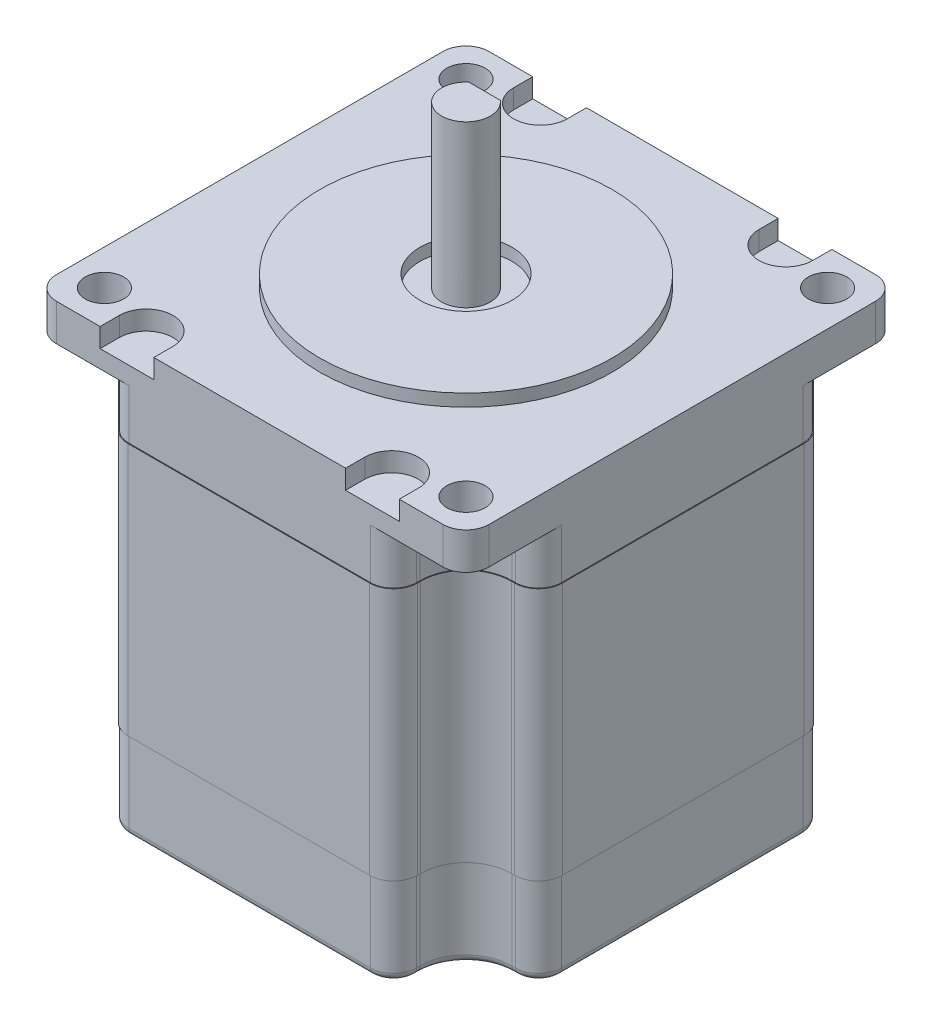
ISO-10303-21;
HEADER;
FILE_DESCRIPTION(('STEP AP214'),'2;1');
FILE_NAME('part.step','',(''),(''),'','','');
FILE_SCHEMA(('AUTOMOTIVE_DESIGN { 1 0 10303 214 1 1 1 1 }'));
ENDSEC;
DATA;
#1=APPLICATION_CONTEXT('core data for automotive mechanical design processes');
#2=APPLICATION_PROTOCOL_DEFINITION('international standard','automotive_design',2000,#1);
#3=PRODUCT_CONTEXT('',#1,'mechanical');
#4=PRODUCT('Part','Part','',(#3));
#5=PRODUCT_RELATED_PRODUCT_CATEGORY('part','',(#4));
#6=PRODUCT_DEFINITION_FORMATION('','',#4);
#7=PRODUCT_DEFINITION_CONTEXT('part definition',#1,'design');
#8=PRODUCT_DEFINITION('design','',#6,#7);
#9=PRODUCT_DEFINITION_SHAPE('','',#8);
#10=(LENGTH_UNIT() NAMED_UNIT(*) SI_UNIT(.MILLI.,.METRE.));
#11=(NAMED_UNIT(*) PLANE_ANGLE_UNIT() SI_UNIT($,.RADIAN.));
#12=(NAMED_UNIT(*) SI_UNIT($,.STERADIAN.) SOLID_ANGLE_UNIT());
#13=UNCERTAINTY_MEASURE_WITH_UNIT(LENGTH_MEASURE(1.E-05),#10,'distance_accuracy_value','');
#14=(GEOMETRIC_REPRESENTATION_CONTEXT(3) GLOBAL_UNCERTAINTY_ASSIGNED_CONTEXT((#13)) GLOBAL_UNIT_ASSIGNED_CONTEXT((#10,
#11,#12)) REPRESENTATION_CONTEXT('',''));
#15=CARTESIAN_POINT('',(0.,0.,0.));
#16=DIRECTION('',(0.,0.,1.));
#17=DIRECTION('',(1.,0.,0.));
#18=AXIS2_PLACEMENT_3D('',#15,#16,#17);
#19=CARTESIAN_POINT('',(25.2,16.6,15.75));
#20=DIRECTION('',(0.,-1.,0.));
#21=DIRECTION('',(0.,0.,-1.));
#22=AXIS2_PLACEMENT_3D('',#19,#20,#21);
#23=CYLINDRICAL_SURFACE('',#22,3.1);
#24=CARTESIAN_POINT('',(25.2,-16.4,15.75));
#25=DIRECTION('',(0.,-1.,0.));
#26=DIRECTION('',(0.,0.,-1.));
#27=AXIS2_PLACEMENT_3D('',#24,#25,#26);
#28=CIRCLE('',#27,3.1);
#29=CARTESIAN_POINT('',(28.3,-16.4,15.75));
#30=VERTEX_POINT('',#29);
#31=CARTESIAN_POINT('',(25.2,-16.4,18.85));
#32=VERTEX_POINT('',#31);
#33=EDGE_CURVE('E507',#30,#32,#28,.T.);
#34=ORIENTED_EDGE('',*,*,#33,.F.);
#35=DIRECTION('',(0.,-1.,0.));
#36=VECTOR('',#35,1.);
#37=CARTESIAN_POINT('',(28.3,16.6,15.75));
#38=LINE('',#37,#36);
#39=CARTESIAN_POINT('',(28.3,16.6,15.75));
#40=VERTEX_POINT('',#39);
#41=EDGE_CURVE('E12',#40,#30,#38,.T.);
#42=ORIENTED_EDGE('',*,*,#41,.F.);
#43=CARTESIAN_POINT('',(25.2,16.6,15.75));
#44=DIRECTION('',(0.,-1.,0.));
#45=DIRECTION('',(0.,0.,-1.));
#46=AXIS2_PLACEMENT_3D('',#43,#44,#45);
#47=CIRCLE('',#46,3.1);
#48=CARTESIAN_POINT('',(25.2,16.6,18.85));
#49=VERTEX_POINT('',#48);
#50=EDGE_CURVE('E551',#40,#49,#47,.T.);
#51=ORIENTED_EDGE('',*,*,#50,.T.);
#52=DIRECTION('',(0.,-1.,0.));
#53=VECTOR('',#52,1.);
#54=CARTESIAN_POINT('',(25.2,16.6,18.85));
#55=LINE('',#54,#53);
#56=EDGE_CURVE('E52',#49,#32,#55,.T.);
#57=ORIENTED_EDGE('',*,*,#56,.T.);
#58=EDGE_LOOP('',(#34,#42,#51,#57));
#59=FACE_BOUND('',#58,.T.);
#60=ADVANCED_FACE('F49',(#59),#23,.T.);
#61=CARTESIAN_POINT('',(28.3,16.6,-15.75));
#62=DIRECTION('',(1.,0.,0.));
#63=DIRECTION('',(0.,0.,-1.));
#64=AXIS2_PLACEMENT_3D('',#61,#62,#63);
#65=PLANE('',#64);
#66=DIRECTION('',(0.,0.,1.));
#67=VECTOR('',#66,1.);
#68=CARTESIAN_POINT('',(28.3,-16.4,-15.75));
#69=LINE('',#68,#67);
#70=CARTESIAN_POINT('',(28.3,-16.4,-15.75));
#71=VERTEX_POINT('',#70);
#72=EDGE_CURVE('E555',#71,#30,#69,.T.);
#73=ORIENTED_EDGE('',*,*,#72,.F.);
#74=DIRECTION('',(0.,-1.,0.));
#75=VECTOR('',#74,1.);
#76=CARTESIAN_POINT('',(28.3,16.6,-15.75));
#77=LINE('',#76,#75);
#78=CARTESIAN_POINT('',(28.3,16.6,-15.75));
#79=VERTEX_POINT('',#78);
#80=EDGE_CURVE('E57',#79,#71,#77,.T.);
#81=ORIENTED_EDGE('',*,*,#80,.F.);
#82=DIRECTION('',(0.,0.,1.));
#83=VECTOR('',#82,1.);
#84=CARTESIAN_POINT('',(28.3,16.6,-15.75));
#85=LINE('',#84,#83);
#86=EDGE_CURVE('E621',#79,#40,#85,.T.);
#87=ORIENTED_EDGE('',*,*,#86,.T.);
#88=ORIENTED_EDGE('',*,*,#41,.T.);
#89=EDGE_LOOP('',(#73,#81,#87,#88));
#90=FACE_BOUND('',#89,.T.);
#91=ADVANCED_FACE('F748',(#90),#65,.T.);
#92=CARTESIAN_POINT('',(25.2,16.6,-15.75));
#93=DIRECTION('',(0.,-1.,0.));
#94=DIRECTION('',(0.,0.,-1.));
#95=AXIS2_PLACEMENT_3D('',#92,#93,#94);
#96=CYLINDRICAL_SURFACE('',#95,3.1);
#97=CARTESIAN_POINT('',(25.2,-16.4,-15.75));
#98=DIRECTION('',(0.,-1.,0.));
#99=DIRECTION('',(0.,0.,1.));
#100=AXIS2_PLACEMENT_3D('',#97,#98,#99);
#101=CIRCLE('',#100,3.1);
#102=CARTESIAN_POINT('',(25.2,-16.4,-18.85));
#103=VERTEX_POINT('',#102);
#104=EDGE_CURVE('E689',#103,#71,#101,.T.);
#105=ORIENTED_EDGE('',*,*,#104,.F.);
#106=DIRECTION('',(0.,-1.,0.));
#107=VECTOR('',#106,1.);
#108=CARTESIAN_POINT('',(25.2,16.6,-18.85));
#109=LINE('',#108,#107);
#110=CARTESIAN_POINT('',(25.2,16.6,-18.85));
#111=VERTEX_POINT('',#110);
#112=EDGE_CURVE('E695',#111,#103,#109,.T.);
#113=ORIENTED_EDGE('',*,*,#112,.F.);
#114=CARTESIAN_POINT('',(25.2,16.6,-15.75));
#115=DIRECTION('',(0.,-1.,0.));
#116=DIRECTION('',(0.,0.,1.));
#117=AXIS2_PLACEMENT_3D('',#114,#115,#116);
#118=CIRCLE('',#117,3.1);
#119=EDGE_CURVE('E618',#111,#79,#118,.T.);
#120=ORIENTED_EDGE('',*,*,#119,.T.);
#121=ORIENTED_EDGE('',*,*,#80,.T.);
#122=EDGE_LOOP('',(#105,#113,#120,#121));
#123=FACE_BOUND('',#122,.T.);
#124=ADVANCED_FACE('F831',(#123),#96,.T.);
#125=CARTESIAN_POINT('',(25.2,16.6,-18.85));
#126=DIRECTION('',(0.,0.,-1.));
#127=DIRECTION('',(-1.,0.,0.));
#128=AXIS2_PLACEMENT_3D('',#125,#126,#127);
#129=PLANE('',#128);
#130=DIRECTION('',(1.,0.,0.));
#131=VECTOR('',#130,1.);
#132=CARTESIAN_POINT('',(25.2,-16.4,-18.85));
#133=LINE('',#132,#131);
#134=CARTESIAN_POINT('',(24.75,-16.4,-18.85));
#135=VERTEX_POINT('',#134);
#136=EDGE_CURVE('E686',#135,#103,#133,.T.);
#137=ORIENTED_EDGE('',*,*,#136,.F.);
#138=DIRECTION('',(0.,-1.,0.));
#139=VECTOR('',#138,1.);
#140=CARTESIAN_POINT('',(24.75,16.6,-18.85));
#141=LINE('',#140,#139);
#142=CARTESIAN_POINT('',(24.75,16.6,-18.85));
#143=VERTEX_POINT('',#142);
#144=EDGE_CURVE('E697',#143,#135,#141,.T.);
#145=ORIENTED_EDGE('',*,*,#144,.F.);
#146=DIRECTION('',(1.,0.,0.));
#147=VECTOR('',#146,1.);
#148=CARTESIAN_POINT('',(25.2,16.6,-18.85));
#149=LINE('',#148,#147);
#150=EDGE_CURVE('E615',#143,#111,#149,.T.);
#151=ORIENTED_EDGE('',*,*,#150,.T.);
#152=ORIENTED_EDGE('',*,*,#112,.T.);
#153=EDGE_LOOP('',(#137,#145,#151,#152));
#154=FACE_BOUND('',#153,.T.);
#155=ADVANCED_FACE('F828',(#154),#129,.T.);
#156=CARTESIAN_POINT('',(24.75,16.6,-24.75));
#157=DIRECTION('',(0.,-1.,0.));
#158=DIRECTION('',(0.,0.,-1.));
#159=AXIS2_PLACEMENT_3D('',#156,#157,#158);
#160=CYLINDRICAL_SURFACE('',#159,5.9);
#161=CARTESIAN_POINT('',(24.75,-16.4,-24.75));
#162=DIRECTION('',(0.,1.,0.));
#163=DIRECTION('',(0.,0.,1.));
#164=AXIS2_PLACEMENT_3D('',#161,#162,#163);
#165=CIRCLE('',#164,5.9);
#166=CARTESIAN_POINT('',(18.85,-16.4,-24.75));
#167=VERTEX_POINT('',#166);
#168=EDGE_CURVE('E683',#167,#135,#165,.T.);
#169=ORIENTED_EDGE('',*,*,#168,.F.);
#170=DIRECTION('',(0.,-1.,0.));
#171=VECTOR('',#170,1.);
#172=CARTESIAN_POINT('',(18.85,16.6,-24.75));
#173=LINE('',#172,#171);
#174=CARTESIAN_POINT('',(18.85,16.6,-24.75));
#175=VERTEX_POINT('',#174);
#176=EDGE_CURVE('E699',#175,#167,#173,.T.);
#177=ORIENTED_EDGE('',*,*,#176,.F.);
#178=CARTESIAN_POINT('',(24.75,16.6,-24.75));
#179=DIRECTION('',(0.,1.,0.));
#180=DIRECTION('',(0.,0.,1.));
#181=AXIS2_PLACEMENT_3D('',#178,#179,#180);
#182=CIRCLE('',#181,5.9);
#183=EDGE_CURVE('E612',#175,#143,#182,.T.);
#184=ORIENTED_EDGE('',*,*,#183,.T.);
#185=ORIENTED_EDGE('',*,*,#144,.T.);
#186=EDGE_LOOP('',(#169,#177,#184,#185));
#187=FACE_BOUND('',#186,.T.);
#188=ADVANCED_FACE('F825',(#187),#160,.F.);
#189=CARTESIAN_POINT('',(18.85,16.6,-24.75));
#190=DIRECTION('',(1.,0.,0.));
#191=DIRECTION('',(0.,0.,-1.));
#192=AXIS2_PLACEMENT_3D('',#189,#190,#191);
#193=PLANE('',#192);
#194=DIRECTION('',(0.,0.,1.));
#195=VECTOR('',#194,1.);
#196=CARTESIAN_POINT('',(18.85,-16.4,-24.75));
#197=LINE('',#196,#195);
#198=CARTESIAN_POINT('',(18.85,-16.4,-25.2));
#199=VERTEX_POINT('',#198);
#200=EDGE_CURVE('E680',#199,#167,#197,.T.);
#201=ORIENTED_EDGE('',*,*,#200,.F.);
#202=DIRECTION('',(0.,-1.,0.));
#203=VECTOR('',#202,1.);
#204=CARTESIAN_POINT('',(18.85,16.6,-25.2));
#205=LINE('',#204,#203);
#206=CARTESIAN_POINT('',(18.85,16.6,-25.2));
#207=VERTEX_POINT('',#206);
#208=EDGE_CURVE('E701',#207,#199,#205,.T.);
#209=ORIENTED_EDGE('',*,*,#208,.F.);
#210=DIRECTION('',(0.,0.,1.));
#211=VECTOR('',#210,1.);
#212=CARTESIAN_POINT('',(18.85,16.6,-24.75));
#213=LINE('',#212,#211);
#214=EDGE_CURVE('E609',#207,#175,#213,.T.);
#215=ORIENTED_EDGE('',*,*,#214,.T.);
#216=ORIENTED_EDGE('',*,*,#176,.T.);
#217=EDGE_LOOP('',(#201,#209,#215,#216));
#218=FACE_BOUND('',#217,.T.);
#219=ADVANCED_FACE('F821',(#218),#193,.T.);
#220=CARTESIAN_POINT('',(15.75,16.6,-25.2));
#221=DIRECTION('',(0.,-1.,0.));
#222=DIRECTION('',(0.,0.,-1.));
#223=AXIS2_PLACEMENT_3D('',#220,#221,#222);
#224=CYLINDRICAL_SURFACE('',#223,3.1);
#225=CARTESIAN_POINT('',(15.75,-16.4,-25.2));
#226=DIRECTION('',(0.,-1.,0.));
#227=DIRECTION('',(0.,0.,1.));
#228=AXIS2_PLACEMENT_3D('',#225,#226,#227);
#229=CIRCLE('',#228,3.1);
#230=CARTESIAN_POINT('',(15.75,-16.4,-28.3));
#231=VERTEX_POINT('',#230);
#232=EDGE_CURVE('E677',#231,#199,#229,.T.);
#233=ORIENTED_EDGE('',*,*,#232,.F.);
#234=DIRECTION('',(0.,-1.,0.));
#235=VECTOR('',#234,1.);
#236=CARTESIAN_POINT('',(15.75,16.6,-28.3));
#237=LINE('',#236,#235);
#238=CARTESIAN_POINT('',(15.75,16.6,-28.3));
#239=VERTEX_POINT('',#238);
#240=EDGE_CURVE('E703',#239,#231,#237,.T.);
#241=ORIENTED_EDGE('',*,*,#240,.F.);
#242=CARTESIAN_POINT('',(15.75,16.6,-25.2));
#243=DIRECTION('',(0.,-1.,0.));
#244=DIRECTION('',(0.,0.,1.));
#245=AXIS2_PLACEMENT_3D('',#242,#243,#244);
#246=CIRCLE('',#245,3.1);
#247=EDGE_CURVE('E606',#239,#207,#246,.T.);
#248=ORIENTED_EDGE('',*,*,#247,.T.);
#249=ORIENTED_EDGE('',*,*,#208,.T.);
#250=EDGE_LOOP('',(#233,#241,#248,#249));
#251=FACE_BOUND('',#250,.T.);
#252=ADVANCED_FACE('F817',(#251),#224,.T.);
#253=CARTESIAN_POINT('',(15.75,16.6,-28.3));
#254=DIRECTION('',(0.,0.,-1.));
#255=DIRECTION('',(-1.,0.,0.));
#256=AXIS2_PLACEMENT_3D('',#253,#254,#255);
#257=PLANE('',#256);
#258=DIRECTION('',(1.,0.,0.));
#259=VECTOR('',#258,1.);
#260=CARTESIAN_POINT('',(15.75,-16.4,-28.3));
#261=LINE('',#260,#259);
#262=CARTESIAN_POINT('',(-15.75,-16.4,-28.3));
#263=VERTEX_POINT('',#262);
#264=EDGE_CURVE('E674',#263,#231,#261,.T.);
#265=ORIENTED_EDGE('',*,*,#264,.F.);
#266=DIRECTION('',(0.,-1.,0.));
#267=VECTOR('',#266,1.);
#268=CARTESIAN_POINT('',(-15.75,16.6,-28.3));
#269=LINE('',#268,#267);
#270=CARTESIAN_POINT('',(-15.75,16.6,-28.3));
#271=VERTEX_POINT('',#270);
#272=EDGE_CURVE('E705',#271,#263,#269,.T.);
#273=ORIENTED_EDGE('',*,*,#272,.F.);
#274=DIRECTION('',(1.,0.,0.));
#275=VECTOR('',#274,1.);
#276=CARTESIAN_POINT('',(15.75,16.6,-28.3));
#277=LINE('',#276,#275);
#278=EDGE_CURVE('E603',#271,#239,#277,.T.);
#279=ORIENTED_EDGE('',*,*,#278,.T.);
#280=ORIENTED_EDGE('',*,*,#240,.T.);
#281=EDGE_LOOP('',(#265,#273,#279,#280));
#282=FACE_BOUND('',#281,.T.);
#283=ADVANCED_FACE('F813',(#282),#257,.T.);
#284=CARTESIAN_POINT('',(-15.75,16.6,-25.2));
#285=DIRECTION('',(0.,-1.,0.));
#286=DIRECTION('',(0.,0.,-1.));
#287=AXIS2_PLACEMENT_3D('',#284,#285,#286);
#288=CYLINDRICAL_SURFACE('',#287,3.1);
#289=CARTESIAN_POINT('',(-15.75,-16.4,-25.2));
#290=DIRECTION('',(0.,-1.,0.));
#291=DIRECTION('',(0.,0.,1.));
#292=AXIS2_PLACEMENT_3D('',#289,#290,#291);
#293=CIRCLE('',#292,3.1);
#294=CARTESIAN_POINT('',(-18.85,-16.4,-25.2));
#295=VERTEX_POINT('',#294);
#296=EDGE_CURVE('E671',#295,#263,#293,.T.);
#297=ORIENTED_EDGE('',*,*,#296,.F.);
#298=DIRECTION('',(0.,-1.,0.));
#299=VECTOR('',#298,1.);
#300=CARTESIAN_POINT('',(-18.85,16.6,-25.2));
#301=LINE('',#300,#299);
#302=CARTESIAN_POINT('',(-18.85,16.6,-25.2));
#303=VERTEX_POINT('',#302);
#304=EDGE_CURVE('E707',#303,#295,#301,.T.);
#305=ORIENTED_EDGE('',*,*,#304,.F.);
#306=CARTESIAN_POINT('',(-15.75,16.6,-25.2));
#307=DIRECTION('',(0.,-1.,0.));
#308=DIRECTION('',(0.,0.,1.));
#309=AXIS2_PLACEMENT_3D('',#306,#307,#308);
#310=CIRCLE('',#309,3.1);
#311=EDGE_CURVE('E600',#303,#271,#310,.T.);
#312=ORIENTED_EDGE('',*,*,#311,.T.);
#313=ORIENTED_EDGE('',*,*,#272,.T.);
#314=EDGE_LOOP('',(#297,#305,#312,#313));
#315=FACE_BOUND('',#314,.T.);
#316=ADVANCED_FACE('F809',(#315),#288,.T.);
#317=CARTESIAN_POINT('',(-18.85,16.6,-25.2));
#318=DIRECTION('',(-1.,0.,0.));
#319=DIRECTION('',(0.,0.,1.));
#320=AXIS2_PLACEMENT_3D('',#317,#318,#319);
#321=PLANE('',#320);
#322=DIRECTION('',(0.,0.,-1.));
#323=VECTOR('',#322,1.);
#324=CARTESIAN_POINT('',(-18.85,-16.4,-25.2));
#325=LINE('',#324,#323);
#326=CARTESIAN_POINT('',(-18.85,-16.4,-24.75));
#327=VERTEX_POINT('',#326);
#328=EDGE_CURVE('E668',#327,#295,#325,.T.);
#329=ORIENTED_EDGE('',*,*,#328,.F.);
#330=DIRECTION('',(0.,-1.,0.));
#331=VECTOR('',#330,1.);
#332=CARTESIAN_POINT('',(-18.85,16.6,-24.75));
#333=LINE('',#332,#331);
#334=CARTESIAN_POINT('',(-18.85,16.6,-24.75));
#335=VERTEX_POINT('',#334);
#336=EDGE_CURVE('E709',#335,#327,#333,.T.);
#337=ORIENTED_EDGE('',*,*,#336,.F.);
#338=DIRECTION('',(0.,0.,-1.));
#339=VECTOR('',#338,1.);
#340=CARTESIAN_POINT('',(-18.85,16.6,-25.2));
#341=LINE('',#340,#339);
#342=EDGE_CURVE('E597',#335,#303,#341,.T.);
#343=ORIENTED_EDGE('',*,*,#342,.T.);
#344=ORIENTED_EDGE('',*,*,#304,.T.);
#345=EDGE_LOOP('',(#329,#337,#343,#344));
#346=FACE_BOUND('',#345,.T.);
#347=ADVANCED_FACE('F805',(#346),#321,.T.);
#348=CARTESIAN_POINT('',(-24.75,16.6,-24.75));
#349=DIRECTION('',(0.,-1.,0.));
#350=DIRECTION('',(0.,0.,-1.));
#351=AXIS2_PLACEMENT_3D('',#348,#349,#350);
#352=CYLINDRICAL_SURFACE('',#351,5.90000000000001);
#353=CARTESIAN_POINT('',(-24.75,-16.4,-24.75));
#354=DIRECTION('',(0.,1.,0.));
#355=DIRECTION('',(0.,0.,1.));
#356=AXIS2_PLACEMENT_3D('',#353,#354,#355);
#357=CIRCLE('',#356,5.90000000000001);
#358=CARTESIAN_POINT('',(-24.75,-16.4,-18.85));
#359=VERTEX_POINT('',#358);
#360=EDGE_CURVE('E665',#359,#327,#357,.T.);
#361=ORIENTED_EDGE('',*,*,#360,.F.);
#362=DIRECTION('',(0.,-1.,0.));
#363=VECTOR('',#362,1.);
#364=CARTESIAN_POINT('',(-24.75,16.6,-18.85));
#365=LINE('',#364,#363);
#366=CARTESIAN_POINT('',(-24.75,16.6,-18.85));
#367=VERTEX_POINT('',#366);
#368=EDGE_CURVE('E711',#367,#359,#365,.T.);
#369=ORIENTED_EDGE('',*,*,#368,.F.);
#370=CARTESIAN_POINT('',(-24.75,16.6,-24.75));
#371=DIRECTION('',(0.,1.,0.));
#372=DIRECTION('',(0.,0.,1.));
#373=AXIS2_PLACEMENT_3D('',#370,#371,#372);
#374=CIRCLE('',#373,5.90000000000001);
#375=EDGE_CURVE('E594',#367,#335,#374,.T.);
#376=ORIENTED_EDGE('',*,*,#375,.T.);
#377=ORIENTED_EDGE('',*,*,#336,.T.);
#378=EDGE_LOOP('',(#361,#369,#376,#377));
#379=FACE_BOUND('',#378,.T.);
#380=ADVANCED_FACE('F801',(#379),#352,.F.);
#381=CARTESIAN_POINT('',(-24.75,16.6,-18.85));
#382=DIRECTION('',(0.,0.,-1.));
#383=DIRECTION('',(-1.,0.,0.));
#384=AXIS2_PLACEMENT_3D('',#381,#382,#383);
#385=PLANE('',#384);
#386=DIRECTION('',(1.,0.,0.));
#387=VECTOR('',#386,1.);
#388=CARTESIAN_POINT('',(-24.75,-16.4,-18.85));
#389=LINE('',#388,#387);
#390=CARTESIAN_POINT('',(-25.2,-16.4,-18.85));
#391=VERTEX_POINT('',#390);
#392=EDGE_CURVE('E662',#391,#359,#389,.T.);
#393=ORIENTED_EDGE('',*,*,#392,.F.);
#394=DIRECTION('',(0.,-1.,0.));
#395=VECTOR('',#394,1.);
#396=CARTESIAN_POINT('',(-25.2,16.6,-18.85));
#397=LINE('',#396,#395);
#398=CARTESIAN_POINT('',(-25.2,16.6,-18.85));
#399=VERTEX_POINT('',#398);
#400=EDGE_CURVE('E713',#399,#391,#397,.T.);
#401=ORIENTED_EDGE('',*,*,#400,.F.);
#402=DIRECTION('',(1.,0.,0.));
#403=VECTOR('',#402,1.);
#404=CARTESIAN_POINT('',(-24.75,16.6,-18.85));
#405=LINE('',#404,#403);
#406=EDGE_CURVE('E591',#399,#367,#405,.T.);
#407=ORIENTED_EDGE('',*,*,#406,.T.);
#408=ORIENTED_EDGE('',*,*,#368,.T.);
#409=EDGE_LOOP('',(#393,#401,#407,#408));
#410=FACE_BOUND('',#409,.T.);
#411=ADVANCED_FACE('F797',(#410),#385,.T.);
#412=CARTESIAN_POINT('',(-25.2,16.6,-15.75));
#413=DIRECTION('',(0.,-1.,0.));
#414=DIRECTION('',(0.,0.,-1.));
#415=AXIS2_PLACEMENT_3D('',#412,#413,#414);
#416=CYLINDRICAL_SURFACE('',#415,3.1);
#417=CARTESIAN_POINT('',(-25.2,-16.4,-15.75));
#418=DIRECTION('',(0.,-1.,0.));
#419=DIRECTION('',(0.,0.,1.));
#420=AXIS2_PLACEMENT_3D('',#417,#418,#419);
#421=CIRCLE('',#420,3.1);
#422=CARTESIAN_POINT('',(-28.3,-16.4,-15.75));
#423=VERTEX_POINT('',#422);
#424=EDGE_CURVE('E659',#423,#391,#421,.T.);
#425=ORIENTED_EDGE('',*,*,#424,.F.);
#426=DIRECTION('',(0.,-1.,0.));
#427=VECTOR('',#426,1.);
#428=CARTESIAN_POINT('',(-28.3,16.6,-15.75));
#429=LINE('',#428,#427);
#430=CARTESIAN_POINT('',(-28.3,16.6,-15.75));
#431=VERTEX_POINT('',#430);
#432=EDGE_CURVE('E715',#431,#423,#429,.T.);
#433=ORIENTED_EDGE('',*,*,#432,.F.);
#434=CARTESIAN_POINT('',(-25.2,16.6,-15.75));
#435=DIRECTION('',(0.,-1.,0.));
#436=DIRECTION('',(0.,0.,1.));
#437=AXIS2_PLACEMENT_3D('',#434,#435,#436);
#438=CIRCLE('',#437,3.1);
#439=EDGE_CURVE('E588',#431,#399,#438,.T.);
#440=ORIENTED_EDGE('',*,*,#439,.T.);
#441=ORIENTED_EDGE('',*,*,#400,.T.);
#442=EDGE_LOOP('',(#425,#433,#440,#441));
#443=FACE_BOUND('',#442,.T.);
#444=ADVANCED_FACE('F793',(#443),#416,.T.);
#445=CARTESIAN_POINT('',(-28.3,16.6,15.75));
#446=DIRECTION('',(-1.,0.,0.));
#447=DIRECTION('',(0.,0.,1.));
#448=AXIS2_PLACEMENT_3D('',#445,#446,#447);
#449=PLANE('',#448);
#450=DIRECTION('',(0.,0.,-1.));
#451=VECTOR('',#450,1.);
#452=CARTESIAN_POINT('',(-28.3,-16.4,15.75));
#453=LINE('',#452,#451);
#454=CARTESIAN_POINT('',(-28.3,-16.4,15.75));
#455=VERTEX_POINT('',#454);
#456=EDGE_CURVE('E656',#455,#423,#453,.T.);
#457=ORIENTED_EDGE('',*,*,#456,.F.);
#458=DIRECTION('',(0.,-1.,0.));
#459=VECTOR('',#458,1.);
#460=CARTESIAN_POINT('',(-28.3,16.6,15.75));
#461=LINE('',#460,#459);
#462=CARTESIAN_POINT('',(-28.3,16.6,15.75));
#463=VERTEX_POINT('',#462);
#464=EDGE_CURVE('E717',#463,#455,#461,.T.);
#465=ORIENTED_EDGE('',*,*,#464,.F.);
#466=DIRECTION('',(0.,0.,-1.));
#467=VECTOR('',#466,1.);
#468=CARTESIAN_POINT('',(-28.3,16.6,15.75));
#469=LINE('',#468,#467);
#470=EDGE_CURVE('E585',#463,#431,#469,.T.);
#471=ORIENTED_EDGE('',*,*,#470,.T.);
#472=ORIENTED_EDGE('',*,*,#432,.T.);
#473=EDGE_LOOP('',(#457,#465,#471,#472));
#474=FACE_BOUND('',#473,.T.);
#475=ADVANCED_FACE('F789',(#474),#449,.T.);
#476=CARTESIAN_POINT('',(-25.2,16.6,15.75));
#477=DIRECTION('',(0.,-1.,0.));
#478=DIRECTION('',(0.,0.,-1.));
#479=AXIS2_PLACEMENT_3D('',#476,#477,#478);
#480=CYLINDRICAL_SURFACE('',#479,3.1);
#481=CARTESIAN_POINT('',(-25.2,-16.4,15.75));
#482=DIRECTION('',(0.,-1.,0.));
#483=DIRECTION('',(0.,0.,-1.));
#484=AXIS2_PLACEMENT_3D('',#481,#482,#483);
#485=CIRCLE('',#484,3.1);
#486=CARTESIAN_POINT('',(-25.2,-16.4,18.85));
#487=VERTEX_POINT('',#486);
#488=EDGE_CURVE('E653',#487,#455,#485,.T.);
#489=ORIENTED_EDGE('',*,*,#488,.F.);
#490=DIRECTION('',(0.,-1.,0.));
#491=VECTOR('',#490,1.);
#492=CARTESIAN_POINT('',(-25.2,16.6,18.85));
#493=LINE('',#492,#491);
#494=CARTESIAN_POINT('',(-25.2,16.6,18.85));
#495=VERTEX_POINT('',#494);
#496=EDGE_CURVE('E719',#495,#487,#493,.T.);
#497=ORIENTED_EDGE('',*,*,#496,.F.);
#498=CARTESIAN_POINT('',(-25.2,16.6,15.75));
#499=DIRECTION('',(0.,-1.,0.));
#500=DIRECTION('',(0.,0.,-1.));
#501=AXIS2_PLACEMENT_3D('',#498,#499,#500);
#502=CIRCLE('',#501,3.1);
#503=EDGE_CURVE('E582',#495,#463,#502,.T.);
#504=ORIENTED_EDGE('',*,*,#503,.T.);
#505=ORIENTED_EDGE('',*,*,#464,.T.);
#506=EDGE_LOOP('',(#489,#497,#504,#505));
#507=FACE_BOUND('',#506,.T.);
#508=ADVANCED_FACE('F785',(#507),#480,.T.);
#509=CARTESIAN_POINT('',(-24.75,16.6,18.85));
#510=DIRECTION('',(0.,0.,1.));
#511=DIRECTION('',(1.,0.,0.));
#512=AXIS2_PLACEMENT_3D('',#509,#510,#511);
#513=PLANE('',#512);
#514=DIRECTION('',(-1.,0.,0.));
#515=VECTOR('',#514,1.);
#516=CARTESIAN_POINT('',(-24.75,-16.4,18.85));
#517=LINE('',#516,#515);
#518=CARTESIAN_POINT('',(-24.75,-16.4,18.85));
#519=VERTEX_POINT('',#518);
#520=EDGE_CURVE('E650',#519,#487,#517,.T.);
#521=ORIENTED_EDGE('',*,*,#520,.F.);
#522=DIRECTION('',(0.,-1.,0.));
#523=VECTOR('',#522,1.);
#524=CARTESIAN_POINT('',(-24.75,16.6,18.85));
#525=LINE('',#524,#523);
#526=CARTESIAN_POINT('',(-24.75,16.6,18.85));
#527=VERTEX_POINT('',#526);
#528=EDGE_CURVE('E721',#527,#519,#525,.T.);
#529=ORIENTED_EDGE('',*,*,#528,.F.);
#530=DIRECTION('',(-1.,0.,0.));
#531=VECTOR('',#530,1.);
#532=CARTESIAN_POINT('',(-24.75,16.6,18.85));
#533=LINE('',#532,#531);
#534=EDGE_CURVE('E579',#527,#495,#533,.T.);
#535=ORIENTED_EDGE('',*,*,#534,.T.);
#536=ORIENTED_EDGE('',*,*,#496,.T.);
#537=EDGE_LOOP('',(#521,#529,#535,#536));
#538=FACE_BOUND('',#537,.T.);
#539=ADVANCED_FACE('F781',(#538),#513,.T.);
#540=CARTESIAN_POINT('',(-24.75,16.6,24.75));
#541=DIRECTION('',(0.,-1.,0.));
#542=DIRECTION('',(0.,0.,-1.));
#543=AXIS2_PLACEMENT_3D('',#540,#541,#542);
#544=CYLINDRICAL_SURFACE('',#543,5.90000000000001);
#545=CARTESIAN_POINT('',(-24.75,-16.4,24.75));
#546=DIRECTION('',(0.,1.,0.));
#547=DIRECTION('',(0.,0.,-1.));
#548=AXIS2_PLACEMENT_3D('',#545,#546,#547);
#549=CIRCLE('',#548,5.90000000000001);
#550=CARTESIAN_POINT('',(-18.85,-16.4,24.75));
#551=VERTEX_POINT('',#550);
#552=EDGE_CURVE('E647',#551,#519,#549,.T.);
#553=ORIENTED_EDGE('',*,*,#552,.F.);
#554=DIRECTION('',(0.,-1.,0.));
#555=VECTOR('',#554,1.);
#556=CARTESIAN_POINT('',(-18.85,16.6,24.75));
#557=LINE('',#556,#555);
#558=CARTESIAN_POINT('',(-18.85,16.6,24.75));
#559=VERTEX_POINT('',#558);
#560=EDGE_CURVE('E723',#559,#551,#557,.T.);
#561=ORIENTED_EDGE('',*,*,#560,.F.);
#562=CARTESIAN_POINT('',(-24.75,16.6,24.75));
#563=DIRECTION('',(0.,1.,0.));
#564=DIRECTION('',(0.,0.,-1.));
#565=AXIS2_PLACEMENT_3D('',#562,#563,#564);
#566=CIRCLE('',#565,5.90000000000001);
#567=EDGE_CURVE('E576',#559,#527,#566,.T.);
#568=ORIENTED_EDGE('',*,*,#567,.T.);
#569=ORIENTED_EDGE('',*,*,#528,.T.);
#570=EDGE_LOOP('',(#553,#561,#568,#569));
#571=FACE_BOUND('',#570,.T.);
#572=ADVANCED_FACE('F777',(#571),#544,.F.);
#573=CARTESIAN_POINT('',(-18.85,16.6,25.2));
#574=DIRECTION('',(-1.,0.,0.));
#575=DIRECTION('',(0.,0.,1.));
#576=AXIS2_PLACEMENT_3D('',#573,#574,#575);
#577=PLANE('',#576);
#578=DIRECTION('',(0.,0.,-1.));
#579=VECTOR('',#578,1.);
#580=CARTESIAN_POINT('',(-18.85,-16.4,25.2));
#581=LINE('',#580,#579);
#582=CARTESIAN_POINT('',(-18.85,-16.4,25.2));
#583=VERTEX_POINT('',#582);
#584=EDGE_CURVE('E644',#583,#551,#581,.T.);
#585=ORIENTED_EDGE('',*,*,#584,.F.);
#586=DIRECTION('',(0.,-1.,0.));
#587=VECTOR('',#586,1.);
#588=CARTESIAN_POINT('',(-18.85,16.6,25.2));
#589=LINE('',#588,#587);
#590=CARTESIAN_POINT('',(-18.85,16.6,25.2));
#591=VERTEX_POINT('',#590);
#592=EDGE_CURVE('E725',#591,#583,#589,.T.);
#593=ORIENTED_EDGE('',*,*,#592,.F.);
#594=DIRECTION('',(0.,0.,-1.));
#595=VECTOR('',#594,1.);
#596=CARTESIAN_POINT('',(-18.85,16.6,25.2));
#597=LINE('',#596,#595);
#598=EDGE_CURVE('E573',#591,#559,#597,.T.);
#599=ORIENTED_EDGE('',*,*,#598,.T.);
#600=ORIENTED_EDGE('',*,*,#560,.T.);
#601=EDGE_LOOP('',(#585,#593,#599,#600));
#602=FACE_BOUND('',#601,.T.);
#603=ADVANCED_FACE('F773',(#602),#577,.T.);
#604=CARTESIAN_POINT('',(-15.75,16.6,25.2));
#605=DIRECTION('',(0.,-1.,0.));
#606=DIRECTION('',(0.,0.,-1.));
#607=AXIS2_PLACEMENT_3D('',#604,#605,#606);
#608=CYLINDRICAL_SURFACE('',#607,3.1);
#609=CARTESIAN_POINT('',(-15.75,-16.4,25.2));
#610=DIRECTION('',(0.,-1.,0.));
#611=DIRECTION('',(0.,0.,-1.));
#612=AXIS2_PLACEMENT_3D('',#609,#610,#611);
#613=CIRCLE('',#612,3.1);
#614=CARTESIAN_POINT('',(-15.75,-16.4,28.3));
#615=VERTEX_POINT('',#614);
#616=EDGE_CURVE('E641',#615,#583,#613,.T.);
#617=ORIENTED_EDGE('',*,*,#616,.F.);
#618=DIRECTION('',(0.,-1.,0.));
#619=VECTOR('',#618,1.);
#620=CARTESIAN_POINT('',(-15.75,16.6,28.3));
#621=LINE('',#620,#619);
#622=CARTESIAN_POINT('',(-15.75,16.6,28.3));
#623=VERTEX_POINT('',#622);
#624=EDGE_CURVE('E727',#623,#615,#621,.T.);
#625=ORIENTED_EDGE('',*,*,#624,.F.);
#626=CARTESIAN_POINT('',(-15.75,16.6,25.2));
#627=DIRECTION('',(0.,-1.,0.));
#628=DIRECTION('',(0.,0.,-1.));
#629=AXIS2_PLACEMENT_3D('',#626,#627,#628);
#630=CIRCLE('',#629,3.1);
#631=EDGE_CURVE('E570',#623,#591,#630,.T.);
#632=ORIENTED_EDGE('',*,*,#631,.T.);
#633=ORIENTED_EDGE('',*,*,#592,.T.);
#634=EDGE_LOOP('',(#617,#625,#632,#633));
#635=FACE_BOUND('',#634,.T.);
#636=ADVANCED_FACE('F769',(#635),#608,.T.);
#637=CARTESIAN_POINT('',(15.75,16.6,28.3));
#638=DIRECTION('',(0.,0.,1.));
#639=DIRECTION('',(1.,0.,0.));
#640=AXIS2_PLACEMENT_3D('',#637,#638,#639);
#641=PLANE('',#640);
#642=DIRECTION('',(-1.,0.,0.));
#643=VECTOR('',#642,1.);
#644=CARTESIAN_POINT('',(15.75,-16.4,28.3));
#645=LINE('',#644,#643);
#646=CARTESIAN_POINT('',(15.75,-16.4,28.3));
#647=VERTEX_POINT('',#646);
#648=EDGE_CURVE('E638',#647,#615,#645,.T.);
#649=ORIENTED_EDGE('',*,*,#648,.F.);
#650=DIRECTION('',(0.,-1.,0.));
#651=VECTOR('',#650,1.);
#652=CARTESIAN_POINT('',(15.75,16.6,28.3));
#653=LINE('',#652,#651);
#654=CARTESIAN_POINT('',(15.75,16.6,28.3));
#655=VERTEX_POINT('',#654);
#656=EDGE_CURVE('E729',#655,#647,#653,.T.);
#657=ORIENTED_EDGE('',*,*,#656,.F.);
#658=DIRECTION('',(-1.,0.,0.));
#659=VECTOR('',#658,1.);
#660=CARTESIAN_POINT('',(15.75,16.6,28.3));
#661=LINE('',#660,#659);
#662=EDGE_CURVE('E567',#655,#623,#661,.T.);
#663=ORIENTED_EDGE('',*,*,#662,.T.);
#664=ORIENTED_EDGE('',*,*,#624,.T.);
#665=EDGE_LOOP('',(#649,#657,#663,#664));
#666=FACE_BOUND('',#665,.T.);
#667=ADVANCED_FACE('F765',(#666),#641,.T.);
#668=CARTESIAN_POINT('',(15.75,16.6,25.2));
#669=DIRECTION('',(0.,-1.,0.));
#670=DIRECTION('',(0.,0.,-1.));
#671=AXIS2_PLACEMENT_3D('',#668,#669,#670);
#672=CYLINDRICAL_SURFACE('',#671,3.1);
#673=CARTESIAN_POINT('',(15.75,-16.4,25.2));
#674=DIRECTION('',(0.,-1.,0.));
#675=DIRECTION('',(0.,0.,-1.));
#676=AXIS2_PLACEMENT_3D('',#673,#674,#675);
#677=CIRCLE('',#676,3.1);
#678=CARTESIAN_POINT('',(18.85,-16.4,25.2));
#679=VERTEX_POINT('',#678);
#680=EDGE_CURVE('E635',#679,#647,#677,.T.);
#681=ORIENTED_EDGE('',*,*,#680,.F.);
#682=DIRECTION('',(0.,-1.,0.));
#683=VECTOR('',#682,1.);
#684=CARTESIAN_POINT('',(18.85,16.6,25.2));
#685=LINE('',#684,#683);
#686=CARTESIAN_POINT('',(18.85,16.6,25.2));
#687=VERTEX_POINT('',#686);
#688=EDGE_CURVE('E731',#687,#679,#685,.T.);
#689=ORIENTED_EDGE('',*,*,#688,.F.);
#690=CARTESIAN_POINT('',(15.75,16.6,25.2));
#691=DIRECTION('',(0.,-1.,0.));
#692=DIRECTION('',(0.,0.,-1.));
#693=AXIS2_PLACEMENT_3D('',#690,#691,#692);
#694=CIRCLE('',#693,3.1);
#695=EDGE_CURVE('E564',#687,#655,#694,.T.);
#696=ORIENTED_EDGE('',*,*,#695,.T.);
#697=ORIENTED_EDGE('',*,*,#656,.T.);
#698=EDGE_LOOP('',(#681,#689,#696,#697));
#699=FACE_BOUND('',#698,.T.);
#700=ADVANCED_FACE('F761',(#699),#672,.T.);
#701=CARTESIAN_POINT('',(18.85,16.6,24.75));
#702=DIRECTION('',(1.,0.,0.));
#703=DIRECTION('',(0.,0.,-1.));
#704=AXIS2_PLACEMENT_3D('',#701,#702,#703);
#705=PLANE('',#704);
#706=DIRECTION('',(0.,0.,1.));
#707=VECTOR('',#706,1.);
#708=CARTESIAN_POINT('',(18.85,-16.4,24.75));
#709=LINE('',#708,#707);
#710=CARTESIAN_POINT('',(18.85,-16.4,24.75));
#711=VERTEX_POINT('',#710);
#712=EDGE_CURVE('E632',#711,#679,#709,.T.);
#713=ORIENTED_EDGE('',*,*,#712,.F.);
#714=DIRECTION('',(0.,-1.,0.));
#715=VECTOR('',#714,1.);
#716=CARTESIAN_POINT('',(18.85,16.6,24.75));
#717=LINE('',#716,#715);
#718=CARTESIAN_POINT('',(18.85,16.6,24.75));
#719=VERTEX_POINT('',#718);
#720=EDGE_CURVE('E733',#719,#711,#717,.T.);
#721=ORIENTED_EDGE('',*,*,#720,.F.);
#722=DIRECTION('',(0.,0.,1.));
#723=VECTOR('',#722,1.);
#724=CARTESIAN_POINT('',(18.85,16.6,24.75));
#725=LINE('',#724,#723);
#726=EDGE_CURVE('E561',#719,#687,#725,.T.);
#727=ORIENTED_EDGE('',*,*,#726,.T.);
#728=ORIENTED_EDGE('',*,*,#688,.T.);
#729=EDGE_LOOP('',(#713,#721,#727,#728));
#730=FACE_BOUND('',#729,.T.);
#731=ADVANCED_FACE('F759',(#730),#705,.T.);
#732=CARTESIAN_POINT('',(24.75,16.6,24.75));
#733=DIRECTION('',(0.,-1.,0.));
#734=DIRECTION('',(0.,0.,-1.));
#735=AXIS2_PLACEMENT_3D('',#732,#733,#734);
#736=CYLINDRICAL_SURFACE('',#735,5.9);
#737=CARTESIAN_POINT('',(24.75,-16.4,24.75));
#738=DIRECTION('',(0.,1.,0.));
#739=DIRECTION('',(0.,0.,-1.));
#740=AXIS2_PLACEMENT_3D('',#737,#738,#739);
#741=CIRCLE('',#740,5.9);
#742=CARTESIAN_POINT('',(24.75,-16.4,18.85));
#743=VERTEX_POINT('',#742);
#744=EDGE_CURVE('E629',#743,#711,#741,.T.);
#745=ORIENTED_EDGE('',*,*,#744,.F.);
#746=DIRECTION('',(0.,-1.,0.));
#747=VECTOR('',#746,1.);
#748=CARTESIAN_POINT('',(24.75,16.6,18.85));
#749=LINE('',#748,#747);
#750=CARTESIAN_POINT('',(24.75,16.6,18.85));
#751=VERTEX_POINT('',#750);
#752=EDGE_CURVE('E734',#751,#743,#749,.T.);
#753=ORIENTED_EDGE('',*,*,#752,.F.);
#754=CARTESIAN_POINT('',(24.75,16.6,24.75));
#755=DIRECTION('',(0.,1.,0.));
#756=DIRECTION('',(0.,0.,-1.));
#757=AXIS2_PLACEMENT_3D('',#754,#755,#756);
#758=CIRCLE('',#757,5.9);
#759=EDGE_CURVE('E558',#751,#719,#758,.T.);
#760=ORIENTED_EDGE('',*,*,#759,.T.);
#761=ORIENTED_EDGE('',*,*,#720,.T.);
#762=EDGE_LOOP('',(#745,#753,#760,#761));
#763=FACE_BOUND('',#762,.T.);
#764=ADVANCED_FACE('F755',(#763),#736,.F.);
#765=CARTESIAN_POINT('',(25.2,16.6,18.85));
#766=DIRECTION('',(0.,0.,1.));
#767=DIRECTION('',(1.,0.,0.));
#768=AXIS2_PLACEMENT_3D('',#765,#766,#767);
#769=PLANE('',#768);
#770=DIRECTION('',(-1.,0.,0.));
#771=VECTOR('',#770,1.);
#772=CARTESIAN_POINT('',(25.2,-16.4,18.85));
#773=LINE('',#772,#771);
#774=EDGE_CURVE('E626',#32,#743,#773,.T.);
#775=ORIENTED_EDGE('',*,*,#774,.F.);
#776=ORIENTED_EDGE('',*,*,#56,.F.);
#777=DIRECTION('',(-1.,0.,0.));
#778=VECTOR('',#777,1.);
#779=CARTESIAN_POINT('',(25.2,16.6,18.85));
#780=LINE('',#779,#778);
#781=EDGE_CURVE('E554',#49,#751,#780,.T.);
#782=ORIENTED_EDGE('',*,*,#781,.T.);
#783=ORIENTED_EDGE('',*,*,#752,.T.);
#784=EDGE_LOOP('',(#775,#776,#782,#783));
#785=FACE_BOUND('',#784,.T.);
#786=ADVANCED_FACE('F742',(#785),#769,.T.);
#787=CARTESIAN_POINT('',(25.2,16.6,15.75));
#788=DIRECTION('',(0.,-1.,0.));
#789=DIRECTION('',(0.,0.,-1.));
#790=AXIS2_PLACEMENT_3D('',#787,#788,#789);
#791=PLANE('',#790);
#792=DIRECTION('',(1.,0.,0.));
#793=VECTOR('',#792,1.);
#794=CARTESIAN_POINT('',(25.2,16.6,-18.75));
#795=LINE('',#794,#793);
#796=CARTESIAN_POINT('',(24.75,16.6,-18.75));
#797=VERTEX_POINT('',#796);
#798=CARTESIAN_POINT('',(25.2,16.6,-18.75));
#799=VERTEX_POINT('',#798);
#800=EDGE_CURVE('E362',#797,#799,#795,.T.);
#801=ORIENTED_EDGE('',*,*,#800,.T.);
#802=CARTESIAN_POINT('',(25.2,16.6,-15.75));
#803=DIRECTION('',(0.,-1.,0.));
#804=DIRECTION('',(0.,0.,1.));
#805=AXIS2_PLACEMENT_3D('',#802,#803,#804);
#806=CIRCLE('',#805,3.);
#807=CARTESIAN_POINT('',(28.2,16.6,-15.75));
#808=VERTEX_POINT('',#807);
#809=EDGE_CURVE('E356',#799,#808,#806,.T.);
#810=ORIENTED_EDGE('',*,*,#809,.T.);
#811=DIRECTION('',(0.,0.,1.));
#812=VECTOR('',#811,1.);
#813=CARTESIAN_POINT('',(28.2,16.6,-15.75));
#814=LINE('',#813,#812);
#815=CARTESIAN_POINT('',(28.2,16.6,15.75));
#816=VERTEX_POINT('',#815);
#817=EDGE_CURVE('E365',#808,#816,#814,.T.);
#818=ORIENTED_EDGE('',*,*,#817,.T.);
#819=CARTESIAN_POINT('',(25.2,16.6,15.75));
#820=DIRECTION('',(0.,-1.,0.));
#821=DIRECTION('',(0.,0.,-1.));
#822=AXIS2_PLACEMENT_3D('',#819,#820,#821);
#823=CIRCLE('',#822,3.);
#824=CARTESIAN_POINT('',(25.2,16.6,18.75));
#825=VERTEX_POINT('',#824);
#826=EDGE_CURVE('E65',#816,#825,#823,.T.);
#827=ORIENTED_EDGE('',*,*,#826,.T.);
#828=DIRECTION('',(-1.,0.,0.));
#829=VECTOR('',#828,1.);
#830=CARTESIAN_POINT('',(25.2,16.6,18.75));
#831=LINE('',#830,#829);
#832=CARTESIAN_POINT('',(24.75,16.6,18.75));
#833=VERTEX_POINT('',#832);
#834=EDGE_CURVE('E380',#825,#833,#831,.T.);
#835=ORIENTED_EDGE('',*,*,#834,.T.);
#836=CARTESIAN_POINT('',(24.75,16.6,24.75));
#837=DIRECTION('',(0.,1.,0.));
#838=DIRECTION('',(0.,0.,-1.));
#839=AXIS2_PLACEMENT_3D('',#836,#837,#838);
#840=CIRCLE('',#839,6.);
#841=CARTESIAN_POINT('',(18.75,16.6,24.75));
#842=VERTEX_POINT('',#841);
#843=EDGE_CURVE('E383',#833,#842,#840,.T.);
#844=ORIENTED_EDGE('',*,*,#843,.T.);
#845=DIRECTION('',(0.,0.,1.));
#846=VECTOR('',#845,1.);
#847=CARTESIAN_POINT('',(18.75,16.6,24.75));
#848=LINE('',#847,#846);
#849=CARTESIAN_POINT('',(18.75,16.6,25.2));
#850=VERTEX_POINT('',#849);
#851=EDGE_CURVE('E386',#842,#850,#848,.T.);
#852=ORIENTED_EDGE('',*,*,#851,.T.);
#853=CARTESIAN_POINT('',(15.75,16.6,25.2));
#854=DIRECTION('',(0.,-1.,0.));
#855=DIRECTION('',(0.,0.,-1.));
#856=AXIS2_PLACEMENT_3D('',#853,#854,#855);
#857=CIRCLE('',#856,3.);
#858=CARTESIAN_POINT('',(15.75,16.6,28.2));
#859=VERTEX_POINT('',#858);
#860=EDGE_CURVE('E389',#850,#859,#857,.T.);
#861=ORIENTED_EDGE('',*,*,#860,.T.);
#862=DIRECTION('',(-1.,0.,0.));
#863=VECTOR('',#862,1.);
#864=CARTESIAN_POINT('',(15.75,16.6,28.2));
#865=LINE('',#864,#863);
#866=CARTESIAN_POINT('',(-15.75,16.6,28.2));
#867=VERTEX_POINT('',#866);
#868=EDGE_CURVE('E392',#859,#867,#865,.T.);
#869=ORIENTED_EDGE('',*,*,#868,.T.);
#870=CARTESIAN_POINT('',(-15.75,16.6,25.2));
#871=DIRECTION('',(0.,-1.,0.));
#872=DIRECTION('',(0.,0.,-1.));
#873=AXIS2_PLACEMENT_3D('',#870,#871,#872);
#874=CIRCLE('',#873,3.);
#875=CARTESIAN_POINT('',(-18.75,16.6,25.2));
#876=VERTEX_POINT('',#875);
#877=EDGE_CURVE('E395',#867,#876,#874,.T.);
#878=ORIENTED_EDGE('',*,*,#877,.T.);
#879=DIRECTION('',(0.,0.,-1.));
#880=VECTOR('',#879,1.);
#881=CARTESIAN_POINT('',(-18.75,16.6,25.2));
#882=LINE('',#881,#880);
#883=CARTESIAN_POINT('',(-18.75,16.6,24.75));
#884=VERTEX_POINT('',#883);
#885=EDGE_CURVE('E398',#876,#884,#882,.T.);
#886=ORIENTED_EDGE('',*,*,#885,.T.);
#887=CARTESIAN_POINT('',(-24.75,16.6,24.75));
#888=DIRECTION('',(0.,1.,0.));
#889=DIRECTION('',(0.,0.,-1.));
#890=AXIS2_PLACEMENT_3D('',#887,#888,#889);
#891=CIRCLE('',#890,6.00000000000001);
#892=CARTESIAN_POINT('',(-24.75,16.6,18.75));
#893=VERTEX_POINT('',#892);
#894=EDGE_CURVE('E401',#884,#893,#891,.T.);
#895=ORIENTED_EDGE('',*,*,#894,.T.);
#896=DIRECTION('',(-1.,0.,0.));
#897=VECTOR('',#896,1.);
#898=CARTESIAN_POINT('',(-24.75,16.6,18.75));
#899=LINE('',#898,#897);
#900=CARTESIAN_POINT('',(-25.2,16.6,18.75));
#901=VERTEX_POINT('',#900);
#902=EDGE_CURVE('E404',#893,#901,#899,.T.);
#903=ORIENTED_EDGE('',*,*,#902,.T.);
#904=CARTESIAN_POINT('',(-25.2,16.6,15.75));
#905=DIRECTION('',(0.,-1.,0.));
#906=DIRECTION('',(0.,0.,-1.));
#907=AXIS2_PLACEMENT_3D('',#904,#905,#906);
#908=CIRCLE('',#907,3.);
#909=CARTESIAN_POINT('',(-28.2,16.6,15.75));
#910=VERTEX_POINT('',#909);
#911=EDGE_CURVE('E407',#901,#910,#908,.T.);
#912=ORIENTED_EDGE('',*,*,#911,.T.);
#913=DIRECTION('',(0.,0.,-1.));
#914=VECTOR('',#913,1.);
#915=CARTESIAN_POINT('',(-28.2,16.6,15.75));
#916=LINE('',#915,#914);
#917=CARTESIAN_POINT('',(-28.2,16.6,-15.75));
#918=VERTEX_POINT('',#917);
#919=EDGE_CURVE('E410',#910,#918,#916,.T.);
#920=ORIENTED_EDGE('',*,*,#919,.T.);
#921=CARTESIAN_POINT('',(-25.2,16.6,-15.75));
#922=DIRECTION('',(0.,-1.,0.));
#923=DIRECTION('',(0.,0.,1.));
#924=AXIS2_PLACEMENT_3D('',#921,#922,#923);
#925=CIRCLE('',#924,3.);
#926=CARTESIAN_POINT('',(-25.2,16.6,-18.75));
#927=VERTEX_POINT('',#926);
#928=EDGE_CURVE('E413',#918,#927,#925,.T.);
#929=ORIENTED_EDGE('',*,*,#928,.T.);
#930=DIRECTION('',(1.,0.,0.));
#931=VECTOR('',#930,1.);
#932=CARTESIAN_POINT('',(-24.75,16.6,-18.75));
#933=LINE('',#932,#931);
#934=CARTESIAN_POINT('',(-24.75,16.6,-18.75));
#935=VERTEX_POINT('',#934);
#936=EDGE_CURVE('E416',#927,#935,#933,.T.);
#937=ORIENTED_EDGE('',*,*,#936,.T.);
#938=CARTESIAN_POINT('',(-24.75,16.6,-24.75));
#939=DIRECTION('',(0.,1.,0.));
#940=DIRECTION('',(0.,0.,1.));
#941=AXIS2_PLACEMENT_3D('',#938,#939,#940);
#942=CIRCLE('',#941,6.00000000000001);
#943=CARTESIAN_POINT('',(-18.75,16.6,-24.75));
#944=VERTEX_POINT('',#943);
#945=EDGE_CURVE('E419',#935,#944,#942,.T.);
#946=ORIENTED_EDGE('',*,*,#945,.T.);
#947=DIRECTION('',(0.,0.,-1.));
#948=VECTOR('',#947,1.);
#949=CARTESIAN_POINT('',(-18.75,16.6,-25.2));
#950=LINE('',#949,#948);
#951=CARTESIAN_POINT('',(-18.75,16.6,-25.2));
#952=VERTEX_POINT('',#951);
#953=EDGE_CURVE('E422',#944,#952,#950,.T.);
#954=ORIENTED_EDGE('',*,*,#953,.T.);
#955=CARTESIAN_POINT('',(-15.75,16.6,-25.2));
#956=DIRECTION('',(0.,-1.,0.));
#957=DIRECTION('',(0.,0.,1.));
#958=AXIS2_PLACEMENT_3D('',#955,#956,#957);
#959=CIRCLE('',#958,3.);
#960=CARTESIAN_POINT('',(-15.75,16.6,-28.2));
#961=VERTEX_POINT('',#960);
#962=EDGE_CURVE('E425',#952,#961,#959,.T.);
#963=ORIENTED_EDGE('',*,*,#962,.T.);
#964=DIRECTION('',(1.,0.,0.));
#965=VECTOR('',#964,1.);
#966=CARTESIAN_POINT('',(15.75,16.6,-28.2));
#967=LINE('',#966,#965);
#968=CARTESIAN_POINT('',(15.75,16.6,-28.2));
#969=VERTEX_POINT('',#968);
#970=EDGE_CURVE('E428',#961,#969,#967,.T.);
#971=ORIENTED_EDGE('',*,*,#970,.T.);
#972=CARTESIAN_POINT('',(15.75,16.6,-25.2));
#973=DIRECTION('',(0.,-1.,0.));
#974=DIRECTION('',(0.,0.,1.));
#975=AXIS2_PLACEMENT_3D('',#972,#973,#974);
#976=CIRCLE('',#975,3.);
#977=CARTESIAN_POINT('',(18.75,16.6,-25.2));
#978=VERTEX_POINT('',#977);
#979=EDGE_CURVE('E431',#969,#978,#976,.T.);
#980=ORIENTED_EDGE('',*,*,#979,.T.);
#981=DIRECTION('',(0.,0.,1.));
#982=VECTOR('',#981,1.);
#983=CARTESIAN_POINT('',(18.75,16.6,-24.75));
#984=LINE('',#983,#982);
#985=CARTESIAN_POINT('',(18.75,16.6,-24.75));
#986=VERTEX_POINT('',#985);
#987=EDGE_CURVE('E434',#978,#986,#984,.T.);
#988=ORIENTED_EDGE('',*,*,#987,.T.);
#989=CARTESIAN_POINT('',(24.75,16.6,-24.75));
#990=DIRECTION('',(0.,1.,0.));
#991=DIRECTION('',(0.,0.,1.));
#992=AXIS2_PLACEMENT_3D('',#989,#990,#991);
#993=CIRCLE('',#992,6.);
#994=EDGE_CURVE('E437',#986,#797,#993,.T.);
#995=ORIENTED_EDGE('',*,*,#994,.T.);
#996=EDGE_LOOP('',(#801,#810,#818,#827,#835,#844,#852,#861,#869,#878,#886,#895,#903,#912,#920,
#929,#937,#946,#954,#963,#971,#980,#988,#995));
#997=FACE_BOUND('',#996,.T.);
#998=ORIENTED_EDGE('',*,*,#50,.F.);
#999=ORIENTED_EDGE('',*,*,#86,.F.);
#1000=ORIENTED_EDGE('',*,*,#119,.F.);
#1001=ORIENTED_EDGE('',*,*,#150,.F.);
#1002=ORIENTED_EDGE('',*,*,#183,.F.);
#1003=ORIENTED_EDGE('',*,*,#214,.F.);
#1004=ORIENTED_EDGE('',*,*,#247,.F.);
#1005=ORIENTED_EDGE('',*,*,#278,.F.);
#1006=ORIENTED_EDGE('',*,*,#311,.F.);
#1007=ORIENTED_EDGE('',*,*,#342,.F.);
#1008=ORIENTED_EDGE('',*,*,#375,.F.);
#1009=ORIENTED_EDGE('',*,*,#406,.F.);
#1010=ORIENTED_EDGE('',*,*,#439,.F.);
#1011=ORIENTED_EDGE('',*,*,#470,.F.);
#1012=ORIENTED_EDGE('',*,*,#503,.F.);
#1013=ORIENTED_EDGE('',*,*,#534,.F.);
#1014=ORIENTED_EDGE('',*,*,#567,.F.);
#1015=ORIENTED_EDGE('',*,*,#598,.F.);
#1016=ORIENTED_EDGE('',*,*,#631,.F.);
#1017=ORIENTED_EDGE('',*,*,#662,.F.);
#1018=ORIENTED_EDGE('',*,*,#695,.F.);
#1019=ORIENTED_EDGE('',*,*,#726,.F.);
#1020=ORIENTED_EDGE('',*,*,#759,.F.);
#1021=ORIENTED_EDGE('',*,*,#781,.F.);
#1022=EDGE_LOOP('',(#998,#999,#1000,#1001,#1002,#1003,#1004,#1005,#1006,#1007,#1008,#1009,#1010,
#1011,#1012,#1013,#1014,#1015,#1016,#1017,#1018,#1019,#1020,#1021));
#1023=FACE_BOUND('',#1022,.T.);
#1024=ADVANCED_FACE('F369',(#997,#1023),#791,.F.);
#1025=CARTESIAN_POINT('',(25.2,-16.4,15.75));
#1026=DIRECTION('',(0.,-1.,0.));
#1027=DIRECTION('',(0.,0.,-1.));
#1028=AXIS2_PLACEMENT_3D('',#1025,#1026,#1027);
#1029=PLANE('',#1028);
#1030=CARTESIAN_POINT('',(25.2,-16.4,-15.75));
#1031=DIRECTION('',(0.,-1.,0.));
#1032=DIRECTION('',(0.,0.,1.));
#1033=AXIS2_PLACEMENT_3D('',#1030,#1031,#1032);
#1034=CIRCLE('',#1033,3.);
#1035=CARTESIAN_POINT('',(25.2,-16.4,-18.75));
#1036=VERTEX_POINT('',#1035);
#1037=CARTESIAN_POINT('',(28.2,-16.4,-15.75));
#1038=VERTEX_POINT('',#1037);
#1039=EDGE_CURVE('E73',#1036,#1038,#1034,.T.);
#1040=ORIENTED_EDGE('',*,*,#1039,.F.);
#1041=DIRECTION('',(1.,0.,0.));
#1042=VECTOR('',#1041,1.);
#1043=CARTESIAN_POINT('',(25.2,-16.4,-18.75));
#1044=LINE('',#1043,#1042);
#1045=CARTESIAN_POINT('',(24.75,-16.4,-18.75));
#1046=VERTEX_POINT('',#1045);
#1047=EDGE_CURVE('E373',#1046,#1036,#1044,.T.);
#1048=ORIENTED_EDGE('',*,*,#1047,.F.);
#1049=CARTESIAN_POINT('',(24.75,-16.4,-24.75));
#1050=DIRECTION('',(0.,1.,0.));
#1051=DIRECTION('',(0.,0.,1.));
#1052=AXIS2_PLACEMENT_3D('',#1049,#1050,#1051);
#1053=CIRCLE('',#1052,6.);
#1054=CARTESIAN_POINT('',(18.75,-16.4,-24.75));
#1055=VERTEX_POINT('',#1054);
#1056=EDGE_CURVE('E376',#1055,#1046,#1053,.T.);
#1057=ORIENTED_EDGE('',*,*,#1056,.F.);
#1058=DIRECTION('',(0.,0.,1.));
#1059=VECTOR('',#1058,1.);
#1060=CARTESIAN_POINT('',(18.75,-16.4,-24.75));
#1061=LINE('',#1060,#1059);
#1062=CARTESIAN_POINT('',(18.75,-16.4,-25.2));
#1063=VERTEX_POINT('',#1062);
#1064=EDGE_CURVE('E500',#1063,#1055,#1061,.T.);
#1065=ORIENTED_EDGE('',*,*,#1064,.F.);
#1066=CARTESIAN_POINT('',(15.75,-16.4,-25.2));
#1067=DIRECTION('',(0.,-1.,0.));
#1068=DIRECTION('',(0.,0.,1.));
#1069=AXIS2_PLACEMENT_3D('',#1066,#1067,#1068);
#1070=CIRCLE('',#1069,3.);
#1071=CARTESIAN_POINT('',(15.75,-16.4,-28.2));
#1072=VERTEX_POINT('',#1071);
#1073=EDGE_CURVE('E497',#1072,#1063,#1070,.T.);
#1074=ORIENTED_EDGE('',*,*,#1073,.F.);
#1075=DIRECTION('',(1.,0.,0.));
#1076=VECTOR('',#1075,1.);
#1077=CARTESIAN_POINT('',(15.75,-16.4,-28.2));
#1078=LINE('',#1077,#1076);
#1079=CARTESIAN_POINT('',(-15.75,-16.4,-28.2));
#1080=VERTEX_POINT('',#1079);
#1081=EDGE_CURVE('E494',#1080,#1072,#1078,.T.);
#1082=ORIENTED_EDGE('',*,*,#1081,.F.);
#1083=CARTESIAN_POINT('',(-15.75,-16.4,-25.2));
#1084=DIRECTION('',(0.,-1.,0.));
#1085=DIRECTION('',(0.,0.,1.));
#1086=AXIS2_PLACEMENT_3D('',#1083,#1084,#1085);
#1087=CIRCLE('',#1086,3.);
#1088=CARTESIAN_POINT('',(-18.75,-16.4,-25.2));
#1089=VERTEX_POINT('',#1088);
#1090=EDGE_CURVE('E491',#1089,#1080,#1087,.T.);
#1091=ORIENTED_EDGE('',*,*,#1090,.F.);
#1092=DIRECTION('',(0.,0.,-1.));
#1093=VECTOR('',#1092,1.);
#1094=CARTESIAN_POINT('',(-18.75,-16.4,-25.2));
#1095=LINE('',#1094,#1093);
#1096=CARTESIAN_POINT('',(-18.75,-16.4,-24.75));
#1097=VERTEX_POINT('',#1096);
#1098=EDGE_CURVE('E488',#1097,#1089,#1095,.T.);
#1099=ORIENTED_EDGE('',*,*,#1098,.F.);
#1100=CARTESIAN_POINT('',(-24.75,-16.4,-24.75));
#1101=DIRECTION('',(0.,1.,0.));
#1102=DIRECTION('',(0.,0.,1.));
#1103=AXIS2_PLACEMENT_3D('',#1100,#1101,#1102);
#1104=CIRCLE('',#1103,6.00000000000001);
#1105=CARTESIAN_POINT('',(-24.75,-16.4,-18.75));
#1106=VERTEX_POINT('',#1105);
#1107=EDGE_CURVE('E485',#1106,#1097,#1104,.T.);
#1108=ORIENTED_EDGE('',*,*,#1107,.F.);
#1109=DIRECTION('',(1.,0.,0.));
#1110=VECTOR('',#1109,1.);
#1111=CARTESIAN_POINT('',(-24.75,-16.4,-18.75));
#1112=LINE('',#1111,#1110);
#1113=CARTESIAN_POINT('',(-25.2,-16.4,-18.75));
#1114=VERTEX_POINT('',#1113);
#1115=EDGE_CURVE('E482',#1114,#1106,#1112,.T.);
#1116=ORIENTED_EDGE('',*,*,#1115,.F.);
#1117=CARTESIAN_POINT('',(-25.2,-16.4,-15.75));
#1118=DIRECTION('',(0.,-1.,0.));
#1119=DIRECTION('',(0.,0.,1.));
#1120=AXIS2_PLACEMENT_3D('',#1117,#1118,#1119);
#1121=CIRCLE('',#1120,3.);
#1122=CARTESIAN_POINT('',(-28.2,-16.4,-15.75));
#1123=VERTEX_POINT('',#1122);
#1124=EDGE_CURVE('E479',#1123,#1114,#1121,.T.);
#1125=ORIENTED_EDGE('',*,*,#1124,.F.);
#1126=DIRECTION('',(0.,0.,-1.));
#1127=VECTOR('',#1126,1.);
#1128=CARTESIAN_POINT('',(-28.2,-16.4,15.75));
#1129=LINE('',#1128,#1127);
#1130=CARTESIAN_POINT('',(-28.2,-16.4,15.75));
#1131=VERTEX_POINT('',#1130);
#1132=EDGE_CURVE('E476',#1131,#1123,#1129,.T.);
#1133=ORIENTED_EDGE('',*,*,#1132,.F.);
#1134=CARTESIAN_POINT('',(-25.2,-16.4,15.75));
#1135=DIRECTION('',(0.,-1.,0.));
#1136=DIRECTION('',(0.,0.,-1.));
#1137=AXIS2_PLACEMENT_3D('',#1134,#1135,#1136);
#1138=CIRCLE('',#1137,3.);
#1139=CARTESIAN_POINT('',(-25.2,-16.4,18.75));
#1140=VERTEX_POINT('',#1139);
#1141=EDGE_CURVE('E473',#1140,#1131,#1138,.T.);
#1142=ORIENTED_EDGE('',*,*,#1141,.F.);
#1143=DIRECTION('',(-1.,0.,0.));
#1144=VECTOR('',#1143,1.);
#1145=CARTESIAN_POINT('',(-24.75,-16.4,18.75));
#1146=LINE('',#1145,#1144);
#1147=CARTESIAN_POINT('',(-24.75,-16.4,18.75));
#1148=VERTEX_POINT('',#1147);
#1149=EDGE_CURVE('E470',#1148,#1140,#1146,.T.);
#1150=ORIENTED_EDGE('',*,*,#1149,.F.);
#1151=CARTESIAN_POINT('',(-24.75,-16.4,24.75));
#1152=DIRECTION('',(0.,1.,0.));
#1153=DIRECTION('',(0.,0.,-1.));
#1154=AXIS2_PLACEMENT_3D('',#1151,#1152,#1153);
#1155=CIRCLE('',#1154,6.00000000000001);
#1156=CARTESIAN_POINT('',(-18.75,-16.4,24.75));
#1157=VERTEX_POINT('',#1156);
#1158=EDGE_CURVE('E467',#1157,#1148,#1155,.T.);
#1159=ORIENTED_EDGE('',*,*,#1158,.F.);
#1160=DIRECTION('',(0.,0.,-1.));
#1161=VECTOR('',#1160,1.);
#1162=CARTESIAN_POINT('',(-18.75,-16.4,25.2));
#1163=LINE('',#1162,#1161);
#1164=CARTESIAN_POINT('',(-18.75,-16.4,25.2));
#1165=VERTEX_POINT('',#1164);
#1166=EDGE_CURVE('E464',#1165,#1157,#1163,.T.);
#1167=ORIENTED_EDGE('',*,*,#1166,.F.);
#1168=CARTESIAN_POINT('',(-15.75,-16.4,25.2));
#1169=DIRECTION('',(0.,-1.,0.));
#1170=DIRECTION('',(0.,0.,-1.));
#1171=AXIS2_PLACEMENT_3D('',#1168,#1169,#1170);
#1172=CIRCLE('',#1171,3.);
#1173=CARTESIAN_POINT('',(-15.75,-16.4,28.2));
#1174=VERTEX_POINT('',#1173);
#1175=EDGE_CURVE('E461',#1174,#1165,#1172,.T.);
#1176=ORIENTED_EDGE('',*,*,#1175,.F.);
#1177=DIRECTION('',(-1.,0.,0.));
#1178=VECTOR('',#1177,1.);
#1179=CARTESIAN_POINT('',(15.75,-16.4,28.2));
#1180=LINE('',#1179,#1178);
#1181=CARTESIAN_POINT('',(15.75,-16.4,28.2));
#1182=VERTEX_POINT('',#1181);
#1183=EDGE_CURVE('E458',#1182,#1174,#1180,.T.);
#1184=ORIENTED_EDGE('',*,*,#1183,.F.);
#1185=CARTESIAN_POINT('',(15.75,-16.4,25.2));
#1186=DIRECTION('',(0.,-1.,0.));
#1187=DIRECTION('',(0.,0.,-1.));
#1188=AXIS2_PLACEMENT_3D('',#1185,#1186,#1187);
#1189=CIRCLE('',#1188,3.);
#1190=CARTESIAN_POINT('',(18.75,-16.4,25.2));
#1191=VERTEX_POINT('',#1190);
#1192=EDGE_CURVE('E455',#1191,#1182,#1189,.T.);
#1193=ORIENTED_EDGE('',*,*,#1192,.F.);
#1194=DIRECTION('',(0.,0.,1.));
#1195=VECTOR('',#1194,1.);
#1196=CARTESIAN_POINT('',(18.75,-16.4,24.75));
#1197=LINE('',#1196,#1195);
#1198=CARTESIAN_POINT('',(18.75,-16.4,24.75));
#1199=VERTEX_POINT('',#1198);
#1200=EDGE_CURVE('E452',#1199,#1191,#1197,.T.);
#1201=ORIENTED_EDGE('',*,*,#1200,.F.);
#1202=CARTESIAN_POINT('',(24.75,-16.4,24.75));
#1203=DIRECTION('',(0.,1.,0.));
#1204=DIRECTION('',(0.,0.,-1.));
#1205=AXIS2_PLACEMENT_3D('',#1202,#1203,#1204);
#1206=CIRCLE('',#1205,6.);
#1207=CARTESIAN_POINT('',(24.75,-16.4,18.75));
#1208=VERTEX_POINT('',#1207);
#1209=EDGE_CURVE('E449',#1208,#1199,#1206,.T.);
#1210=ORIENTED_EDGE('',*,*,#1209,.F.);
#1211=DIRECTION('',(-1.,0.,0.));
#1212=VECTOR('',#1211,1.);
#1213=CARTESIAN_POINT('',(25.2,-16.4,18.75));
#1214=LINE('',#1213,#1212);
#1215=CARTESIAN_POINT('',(25.2,-16.4,18.75));
#1216=VERTEX_POINT('',#1215);
#1217=EDGE_CURVE('E446',#1216,#1208,#1214,.T.);
#1218=ORIENTED_EDGE('',*,*,#1217,.F.);
#1219=CARTESIAN_POINT('',(25.2,-16.4,15.75));
#1220=DIRECTION('',(0.,-1.,0.));
#1221=DIRECTION('',(0.,0.,-1.));
#1222=AXIS2_PLACEMENT_3D('',#1219,#1220,#1221);
#1223=CIRCLE('',#1222,3.);
#1224=CARTESIAN_POINT('',(28.2,-16.4,15.75));
#1225=VERTEX_POINT('',#1224);
#1226=EDGE_CURVE('E443',#1225,#1216,#1223,.T.);
#1227=ORIENTED_EDGE('',*,*,#1226,.F.);
#1228=DIRECTION('',(0.,0.,1.));
#1229=VECTOR('',#1228,1.);
#1230=CARTESIAN_POINT('',(28.2,-16.4,-15.75));
#1231=LINE('',#1230,#1229);
#1232=EDGE_CURVE('E441',#1038,#1225,#1231,.T.);
#1233=ORIENTED_EDGE('',*,*,#1232,.F.);
#1234=EDGE_LOOP('',(#1040,#1048,#1057,#1065,#1074,#1082,#1091,#1099,#1108,#1116,#1125,#1133,
#1142,#1150,#1159,#1167,#1176,#1184,#1193,#1201,#1210,#1218,#1227,#1233));
#1235=FACE_BOUND('',#1234,.T.);
#1236=ORIENTED_EDGE('',*,*,#33,.T.);
#1237=ORIENTED_EDGE('',*,*,#774,.T.);
#1238=ORIENTED_EDGE('',*,*,#744,.T.);
#1239=ORIENTED_EDGE('',*,*,#712,.T.);
#1240=ORIENTED_EDGE('',*,*,#680,.T.);
#1241=ORIENTED_EDGE('',*,*,#648,.T.);
#1242=ORIENTED_EDGE('',*,*,#616,.T.);
#1243=ORIENTED_EDGE('',*,*,#584,.T.);
#1244=ORIENTED_EDGE('',*,*,#552,.T.);
#1245=ORIENTED_EDGE('',*,*,#520,.T.);
#1246=ORIENTED_EDGE('',*,*,#488,.T.);
#1247=ORIENTED_EDGE('',*,*,#456,.T.);
#1248=ORIENTED_EDGE('',*,*,#424,.T.);
#1249=ORIENTED_EDGE('',*,*,#392,.T.);
#1250=ORIENTED_EDGE('',*,*,#360,.T.);
#1251=ORIENTED_EDGE('',*,*,#328,.T.);
#1252=ORIENTED_EDGE('',*,*,#296,.T.);
#1253=ORIENTED_EDGE('',*,*,#264,.T.);
#1254=ORIENTED_EDGE('',*,*,#232,.T.);
#1255=ORIENTED_EDGE('',*,*,#200,.T.);
#1256=ORIENTED_EDGE('',*,*,#168,.T.);
#1257=ORIENTED_EDGE('',*,*,#136,.T.);
#1258=ORIENTED_EDGE('',*,*,#104,.T.);
#1259=ORIENTED_EDGE('',*,*,#72,.T.);
#1260=EDGE_LOOP('',(#1236,#1237,#1238,#1239,#1240,#1241,#1242,#1243,#1244,#1245,#1246,#1247,
#1248,#1249,#1250,#1251,#1252,#1253,#1254,#1255,#1256,#1257,#1258,#1259));
#1261=FACE_BOUND('',#1260,.T.);
#1262=ADVANCED_FACE('F744',(#1235,#1261),#1029,.T.);
#1263=CARTESIAN_POINT('',(25.2,16.6,-15.75));
#1264=DIRECTION('',(0.,-1.,0.));
#1265=DIRECTION('',(0.,0.,-1.));
#1266=AXIS2_PLACEMENT_3D('',#1263,#1264,#1265);
#1267=CYLINDRICAL_SURFACE('',#1266,3.);
#1268=ORIENTED_EDGE('',*,*,#1039,.T.);
#1269=DIRECTION('',(0.,-1.,0.));
#1270=VECTOR('',#1269,1.);
#1271=CARTESIAN_POINT('',(28.2,16.6,-15.75));
#1272=LINE('',#1271,#1270);
#1273=EDGE_CURVE('E352',#808,#1038,#1272,.T.);
#1274=ORIENTED_EDGE('',*,*,#1273,.F.);
#1275=ORIENTED_EDGE('',*,*,#809,.F.);
#1276=DIRECTION('',(0.,-1.,0.));
#1277=VECTOR('',#1276,1.);
#1278=CARTESIAN_POINT('',(25.2,16.6,-18.75));
#1279=LINE('',#1278,#1277);
#1280=EDGE_CURVE('E505',#799,#1036,#1279,.T.);
#1281=ORIENTED_EDGE('',*,*,#1280,.T.);
#1282=EDGE_LOOP('',(#1268,#1274,#1275,#1281));
#1283=FACE_BOUND('',#1282,.T.);
#1284=ADVANCED_FACE('F354',(#1283),#1267,.F.);
#1285=CARTESIAN_POINT('',(25.2,16.6,-18.75));
#1286=DIRECTION('',(0.,0.,-1.));
#1287=DIRECTION('',(-1.,0.,0.));
#1288=AXIS2_PLACEMENT_3D('',#1285,#1286,#1287);
#1289=PLANE('',#1288);
#1290=ORIENTED_EDGE('',*,*,#1047,.T.);
#1291=ORIENTED_EDGE('',*,*,#1280,.F.);
#1292=ORIENTED_EDGE('',*,*,#800,.F.);
#1293=DIRECTION('',(0.,-1.,0.));
#1294=VECTOR('',#1293,1.);
#1295=CARTESIAN_POINT('',(24.75,16.6,-18.75));
#1296=LINE('',#1295,#1294);
#1297=EDGE_CURVE('E508',#797,#1046,#1296,.T.);
#1298=ORIENTED_EDGE('',*,*,#1297,.T.);
#1299=EDGE_LOOP('',(#1290,#1291,#1292,#1298));
#1300=FACE_BOUND('',#1299,.T.);
#1301=ADVANCED_FACE('F1042',(#1300),#1289,.F.);
#1302=CARTESIAN_POINT('',(24.75,16.6,-24.75));
#1303=DIRECTION('',(0.,-1.,0.));
#1304=DIRECTION('',(0.,0.,-1.));
#1305=AXIS2_PLACEMENT_3D('',#1302,#1303,#1304);
#1306=CYLINDRICAL_SURFACE('',#1305,6.);
#1307=ORIENTED_EDGE('',*,*,#1056,.T.);
#1308=ORIENTED_EDGE('',*,*,#1297,.F.);
#1309=ORIENTED_EDGE('',*,*,#994,.F.);
#1310=DIRECTION('',(0.,-1.,0.));
#1311=VECTOR('',#1310,1.);
#1312=CARTESIAN_POINT('',(18.75,16.6,-24.75));
#1313=LINE('',#1312,#1311);
#1314=EDGE_CURVE('E510',#986,#1055,#1313,.T.);
#1315=ORIENTED_EDGE('',*,*,#1314,.T.);
#1316=EDGE_LOOP('',(#1307,#1308,#1309,#1315));
#1317=FACE_BOUND('',#1316,.T.);
#1318=ADVANCED_FACE('F1051',(#1317),#1306,.T.);
#1319=CARTESIAN_POINT('',(18.75,16.6,-24.75));
#1320=DIRECTION('',(1.,0.,0.));
#1321=DIRECTION('',(0.,0.,-1.));
#1322=AXIS2_PLACEMENT_3D('',#1319,#1320,#1321);
#1323=PLANE('',#1322);
#1324=ORIENTED_EDGE('',*,*,#1064,.T.);
#1325=ORIENTED_EDGE('',*,*,#1314,.F.);
#1326=ORIENTED_EDGE('',*,*,#987,.F.);
#1327=DIRECTION('',(0.,-1.,0.));
#1328=VECTOR('',#1327,1.);
#1329=CARTESIAN_POINT('',(18.75,16.6,-25.2));
#1330=LINE('',#1329,#1328);
#1331=EDGE_CURVE('E512',#978,#1063,#1330,.T.);
#1332=ORIENTED_EDGE('',*,*,#1331,.T.);
#1333=EDGE_LOOP('',(#1324,#1325,#1326,#1332));
#1334=FACE_BOUND('',#1333,.T.);
#1335=ADVANCED_FACE('F1061',(#1334),#1323,.F.);
#1336=CARTESIAN_POINT('',(15.75,16.6,-25.2));
#1337=DIRECTION('',(0.,-1.,0.));
#1338=DIRECTION('',(0.,0.,-1.));
#1339=AXIS2_PLACEMENT_3D('',#1336,#1337,#1338);
#1340=CYLINDRICAL_SURFACE('',#1339,3.);
#1341=ORIENTED_EDGE('',*,*,#1073,.T.);
#1342=ORIENTED_EDGE('',*,*,#1331,.F.);
#1343=ORIENTED_EDGE('',*,*,#979,.F.);
#1344=DIRECTION('',(0.,-1.,0.));
#1345=VECTOR('',#1344,1.);
#1346=CARTESIAN_POINT('',(15.75,16.6,-28.2));
#1347=LINE('',#1346,#1345);
#1348=EDGE_CURVE('E514',#969,#1072,#1347,.T.);
#1349=ORIENTED_EDGE('',*,*,#1348,.T.);
#1350=EDGE_LOOP('',(#1341,#1342,#1343,#1349));
#1351=FACE_BOUND('',#1350,.T.);
#1352=ADVANCED_FACE('F1071',(#1351),#1340,.F.);
#1353=CARTESIAN_POINT('',(15.75,16.6,-28.2));
#1354=DIRECTION('',(0.,0.,-1.));
#1355=DIRECTION('',(-1.,0.,0.));
#1356=AXIS2_PLACEMENT_3D('',#1353,#1354,#1355);
#1357=PLANE('',#1356);
#1358=ORIENTED_EDGE('',*,*,#1081,.T.);
#1359=ORIENTED_EDGE('',*,*,#1348,.F.);
#1360=ORIENTED_EDGE('',*,*,#970,.F.);
#1361=DIRECTION('',(0.,-1.,0.));
#1362=VECTOR('',#1361,1.);
#1363=CARTESIAN_POINT('',(-15.75,16.6,-28.2));
#1364=LINE('',#1363,#1362);
#1365=EDGE_CURVE('E516',#961,#1080,#1364,.T.);
#1366=ORIENTED_EDGE('',*,*,#1365,.T.);
#1367=EDGE_LOOP('',(#1358,#1359,#1360,#1366));
#1368=FACE_BOUND('',#1367,.T.);
#1369=ADVANCED_FACE('F1081',(#1368),#1357,.F.);
#1370=CARTESIAN_POINT('',(-15.75,16.6,-25.2));
#1371=DIRECTION('',(0.,-1.,0.));
#1372=DIRECTION('',(0.,0.,-1.));
#1373=AXIS2_PLACEMENT_3D('',#1370,#1371,#1372);
#1374=CYLINDRICAL_SURFACE('',#1373,3.);
#1375=ORIENTED_EDGE('',*,*,#1090,.T.);
#1376=ORIENTED_EDGE('',*,*,#1365,.F.);
#1377=ORIENTED_EDGE('',*,*,#962,.F.);
#1378=DIRECTION('',(0.,-1.,0.));
#1379=VECTOR('',#1378,1.);
#1380=CARTESIAN_POINT('',(-18.75,16.6,-25.2));
#1381=LINE('',#1380,#1379);
#1382=EDGE_CURVE('E518',#952,#1089,#1381,.T.);
#1383=ORIENTED_EDGE('',*,*,#1382,.T.);
#1384=EDGE_LOOP('',(#1375,#1376,#1377,#1383));
#1385=FACE_BOUND('',#1384,.T.);
#1386=ADVANCED_FACE('F1091',(#1385),#1374,.F.);
#1387=CARTESIAN_POINT('',(-18.75,16.6,-25.2));
#1388=DIRECTION('',(-1.,0.,0.));
#1389=DIRECTION('',(0.,0.,1.));
#1390=AXIS2_PLACEMENT_3D('',#1387,#1388,#1389);
#1391=PLANE('',#1390);
#1392=ORIENTED_EDGE('',*,*,#1098,.T.);
#1393=ORIENTED_EDGE('',*,*,#1382,.F.);
#1394=ORIENTED_EDGE('',*,*,#953,.F.);
#1395=DIRECTION('',(0.,-1.,0.));
#1396=VECTOR('',#1395,1.);
#1397=CARTESIAN_POINT('',(-18.75,16.6,-24.75));
#1398=LINE('',#1397,#1396);
#1399=EDGE_CURVE('E520',#944,#1097,#1398,.T.);
#1400=ORIENTED_EDGE('',*,*,#1399,.T.);
#1401=EDGE_LOOP('',(#1392,#1393,#1394,#1400));
#1402=FACE_BOUND('',#1401,.T.);
#1403=ADVANCED_FACE('F1101',(#1402),#1391,.F.);
#1404=CARTESIAN_POINT('',(-24.75,16.6,-24.75));
#1405=DIRECTION('',(0.,-1.,0.));
#1406=DIRECTION('',(0.,0.,-1.));
#1407=AXIS2_PLACEMENT_3D('',#1404,#1405,#1406);
#1408=CYLINDRICAL_SURFACE('',#1407,6.00000000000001);
#1409=ORIENTED_EDGE('',*,*,#1107,.T.);
#1410=ORIENTED_EDGE('',*,*,#1399,.F.);
#1411=ORIENTED_EDGE('',*,*,#945,.F.);
#1412=DIRECTION('',(0.,-1.,0.));
#1413=VECTOR('',#1412,1.);
#1414=CARTESIAN_POINT('',(-24.75,16.6,-18.75));
#1415=LINE('',#1414,#1413);
#1416=EDGE_CURVE('E522',#935,#1106,#1415,.T.);
#1417=ORIENTED_EDGE('',*,*,#1416,.T.);
#1418=EDGE_LOOP('',(#1409,#1410,#1411,#1417));
#1419=FACE_BOUND('',#1418,.T.);
#1420=ADVANCED_FACE('F1111',(#1419),#1408,.T.);
#1421=CARTESIAN_POINT('',(-24.75,16.6,-18.75));
#1422=DIRECTION('',(0.,0.,-1.));
#1423=DIRECTION('',(-1.,0.,0.));
#1424=AXIS2_PLACEMENT_3D('',#1421,#1422,#1423);
#1425=PLANE('',#1424);
#1426=ORIENTED_EDGE('',*,*,#1115,.T.);
#1427=ORIENTED_EDGE('',*,*,#1416,.F.);
#1428=ORIENTED_EDGE('',*,*,#936,.F.);
#1429=DIRECTION('',(0.,-1.,0.));
#1430=VECTOR('',#1429,1.);
#1431=CARTESIAN_POINT('',(-25.2,16.6,-18.75));
#1432=LINE('',#1431,#1430);
#1433=EDGE_CURVE('E524',#927,#1114,#1432,.T.);
#1434=ORIENTED_EDGE('',*,*,#1433,.T.);
#1435=EDGE_LOOP('',(#1426,#1427,#1428,#1434));
#1436=FACE_BOUND('',#1435,.T.);
#1437=ADVANCED_FACE('F1121',(#1436),#1425,.F.);
#1438=CARTESIAN_POINT('',(-25.2,16.6,-15.75));
#1439=DIRECTION('',(0.,-1.,0.));
#1440=DIRECTION('',(0.,0.,-1.));
#1441=AXIS2_PLACEMENT_3D('',#1438,#1439,#1440);
#1442=CYLINDRICAL_SURFACE('',#1441,3.);
#1443=ORIENTED_EDGE('',*,*,#1124,.T.);
#1444=ORIENTED_EDGE('',*,*,#1433,.F.);
#1445=ORIENTED_EDGE('',*,*,#928,.F.);
#1446=DIRECTION('',(0.,-1.,0.));
#1447=VECTOR('',#1446,1.);
#1448=CARTESIAN_POINT('',(-28.2,16.6,-15.75));
#1449=LINE('',#1448,#1447);
#1450=EDGE_CURVE('E526',#918,#1123,#1449,.T.);
#1451=ORIENTED_EDGE('',*,*,#1450,.T.);
#1452=EDGE_LOOP('',(#1443,#1444,#1445,#1451));
#1453=FACE_BOUND('',#1452,.T.);
#1454=ADVANCED_FACE('F1131',(#1453),#1442,.F.);
#1455=CARTESIAN_POINT('',(-28.2,16.6,15.75));
#1456=DIRECTION('',(-1.,0.,0.));
#1457=DIRECTION('',(0.,0.,1.));
#1458=AXIS2_PLACEMENT_3D('',#1455,#1456,#1457);
#1459=PLANE('',#1458);
#1460=ORIENTED_EDGE('',*,*,#1132,.T.);
#1461=ORIENTED_EDGE('',*,*,#1450,.F.);
#1462=ORIENTED_EDGE('',*,*,#919,.F.);
#1463=DIRECTION('',(0.,-1.,0.));
#1464=VECTOR('',#1463,1.);
#1465=CARTESIAN_POINT('',(-28.2,16.6,15.75));
#1466=LINE('',#1465,#1464);
#1467=EDGE_CURVE('E528',#910,#1131,#1466,.T.);
#1468=ORIENTED_EDGE('',*,*,#1467,.T.);
#1469=EDGE_LOOP('',(#1460,#1461,#1462,#1468));
#1470=FACE_BOUND('',#1469,.T.);
#1471=ADVANCED_FACE('F1141',(#1470),#1459,.F.);
#1472=CARTESIAN_POINT('',(-25.2,16.6,15.75));
#1473=DIRECTION('',(0.,-1.,0.));
#1474=DIRECTION('',(0.,0.,-1.));
#1475=AXIS2_PLACEMENT_3D('',#1472,#1473,#1474);
#1476=CYLINDRICAL_SURFACE('',#1475,3.);
#1477=ORIENTED_EDGE('',*,*,#1141,.T.);
#1478=ORIENTED_EDGE('',*,*,#1467,.F.);
#1479=ORIENTED_EDGE('',*,*,#911,.F.);
#1480=DIRECTION('',(0.,-1.,0.));
#1481=VECTOR('',#1480,1.);
#1482=CARTESIAN_POINT('',(-25.2,16.6,18.75));
#1483=LINE('',#1482,#1481);
#1484=EDGE_CURVE('E530',#901,#1140,#1483,.T.);
#1485=ORIENTED_EDGE('',*,*,#1484,.T.);
#1486=EDGE_LOOP('',(#1477,#1478,#1479,#1485));
#1487=FACE_BOUND('',#1486,.T.);
#1488=ADVANCED_FACE('F1151',(#1487),#1476,.F.);
#1489=CARTESIAN_POINT('',(-24.75,16.6,18.75));
#1490=DIRECTION('',(0.,0.,1.));
#1491=DIRECTION('',(1.,0.,0.));
#1492=AXIS2_PLACEMENT_3D('',#1489,#1490,#1491);
#1493=PLANE('',#1492);
#1494=ORIENTED_EDGE('',*,*,#1149,.T.);
#1495=ORIENTED_EDGE('',*,*,#1484,.F.);
#1496=ORIENTED_EDGE('',*,*,#902,.F.);
#1497=DIRECTION('',(0.,-1.,0.));
#1498=VECTOR('',#1497,1.);
#1499=CARTESIAN_POINT('',(-24.75,16.6,18.75));
#1500=LINE('',#1499,#1498);
#1501=EDGE_CURVE('E532',#893,#1148,#1500,.T.);
#1502=ORIENTED_EDGE('',*,*,#1501,.T.);
#1503=EDGE_LOOP('',(#1494,#1495,#1496,#1502));
#1504=FACE_BOUND('',#1503,.T.);
#1505=ADVANCED_FACE('F1161',(#1504),#1493,.F.);
#1506=CARTESIAN_POINT('',(-24.75,16.6,24.75));
#1507=DIRECTION('',(0.,-1.,0.));
#1508=DIRECTION('',(0.,0.,-1.));
#1509=AXIS2_PLACEMENT_3D('',#1506,#1507,#1508);
#1510=CYLINDRICAL_SURFACE('',#1509,6.00000000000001);
#1511=ORIENTED_EDGE('',*,*,#1158,.T.);
#1512=ORIENTED_EDGE('',*,*,#1501,.F.);
#1513=ORIENTED_EDGE('',*,*,#894,.F.);
#1514=DIRECTION('',(0.,-1.,0.));
#1515=VECTOR('',#1514,1.);
#1516=CARTESIAN_POINT('',(-18.75,16.6,24.75));
#1517=LINE('',#1516,#1515);
#1518=EDGE_CURVE('E534',#884,#1157,#1517,.T.);
#1519=ORIENTED_EDGE('',*,*,#1518,.T.);
#1520=EDGE_LOOP('',(#1511,#1512,#1513,#1519));
#1521=FACE_BOUND('',#1520,.T.);
#1522=ADVANCED_FACE('F1171',(#1521),#1510,.T.);
#1523=CARTESIAN_POINT('',(-18.75,16.6,25.2));
#1524=DIRECTION('',(-1.,0.,0.));
#1525=DIRECTION('',(0.,0.,1.));
#1526=AXIS2_PLACEMENT_3D('',#1523,#1524,#1525);
#1527=PLANE('',#1526);
#1528=ORIENTED_EDGE('',*,*,#1166,.T.);
#1529=ORIENTED_EDGE('',*,*,#1518,.F.);
#1530=ORIENTED_EDGE('',*,*,#885,.F.);
#1531=DIRECTION('',(0.,-1.,0.));
#1532=VECTOR('',#1531,1.);
#1533=CARTESIAN_POINT('',(-18.75,16.6,25.2));
#1534=LINE('',#1533,#1532);
#1535=EDGE_CURVE('E536',#876,#1165,#1534,.T.);
#1536=ORIENTED_EDGE('',*,*,#1535,.T.);
#1537=EDGE_LOOP('',(#1528,#1529,#1530,#1536));
#1538=FACE_BOUND('',#1537,.T.);
#1539=ADVANCED_FACE('F1181',(#1538),#1527,.F.);
#1540=CARTESIAN_POINT('',(-15.75,16.6,25.2));
#1541=DIRECTION('',(0.,-1.,0.));
#1542=DIRECTION('',(0.,0.,-1.));
#1543=AXIS2_PLACEMENT_3D('',#1540,#1541,#1542);
#1544=CYLINDRICAL_SURFACE('',#1543,3.);
#1545=ORIENTED_EDGE('',*,*,#1175,.T.);
#1546=ORIENTED_EDGE('',*,*,#1535,.F.);
#1547=ORIENTED_EDGE('',*,*,#877,.F.);
#1548=DIRECTION('',(0.,-1.,0.));
#1549=VECTOR('',#1548,1.);
#1550=CARTESIAN_POINT('',(-15.75,16.6,28.2));
#1551=LINE('',#1550,#1549);
#1552=EDGE_CURVE('E538',#867,#1174,#1551,.T.);
#1553=ORIENTED_EDGE('',*,*,#1552,.T.);
#1554=EDGE_LOOP('',(#1545,#1546,#1547,#1553));
#1555=FACE_BOUND('',#1554,.T.);
#1556=ADVANCED_FACE('F1191',(#1555),#1544,.F.);
#1557=CARTESIAN_POINT('',(15.75,16.6,28.2));
#1558=DIRECTION('',(0.,0.,1.));
#1559=DIRECTION('',(1.,0.,0.));
#1560=AXIS2_PLACEMENT_3D('',#1557,#1558,#1559);
#1561=PLANE('',#1560);
#1562=ORIENTED_EDGE('',*,*,#1183,.T.);
#1563=ORIENTED_EDGE('',*,*,#1552,.F.);
#1564=ORIENTED_EDGE('',*,*,#868,.F.);
#1565=DIRECTION('',(0.,-1.,0.));
#1566=VECTOR('',#1565,1.);
#1567=CARTESIAN_POINT('',(15.75,16.6,28.2));
#1568=LINE('',#1567,#1566);
#1569=EDGE_CURVE('E540',#859,#1182,#1568,.T.);
#1570=ORIENTED_EDGE('',*,*,#1569,.T.);
#1571=EDGE_LOOP('',(#1562,#1563,#1564,#1570));
#1572=FACE_BOUND('',#1571,.T.);
#1573=ADVANCED_FACE('F1201',(#1572),#1561,.F.);
#1574=CARTESIAN_POINT('',(15.75,16.6,25.2));
#1575=DIRECTION('',(0.,-1.,0.));
#1576=DIRECTION('',(0.,0.,-1.));
#1577=AXIS2_PLACEMENT_3D('',#1574,#1575,#1576);
#1578=CYLINDRICAL_SURFACE('',#1577,3.);
#1579=ORIENTED_EDGE('',*,*,#1192,.T.);
#1580=ORIENTED_EDGE('',*,*,#1569,.F.);
#1581=ORIENTED_EDGE('',*,*,#860,.F.);
#1582=DIRECTION('',(0.,-1.,0.));
#1583=VECTOR('',#1582,1.);
#1584=CARTESIAN_POINT('',(18.75,16.6,25.2));
#1585=LINE('',#1584,#1583);
#1586=EDGE_CURVE('E542',#850,#1191,#1585,.T.);
#1587=ORIENTED_EDGE('',*,*,#1586,.T.);
#1588=EDGE_LOOP('',(#1579,#1580,#1581,#1587));
#1589=FACE_BOUND('',#1588,.T.);
#1590=ADVANCED_FACE('F1211',(#1589),#1578,.F.);
#1591=CARTESIAN_POINT('',(18.75,16.6,24.75));
#1592=DIRECTION('',(1.,0.,0.));
#1593=DIRECTION('',(0.,0.,-1.));
#1594=AXIS2_PLACEMENT_3D('',#1591,#1592,#1593);
#1595=PLANE('',#1594);
#1596=ORIENTED_EDGE('',*,*,#1200,.T.);
#1597=ORIENTED_EDGE('',*,*,#1586,.F.);
#1598=ORIENTED_EDGE('',*,*,#851,.F.);
#1599=DIRECTION('',(0.,-1.,0.));
#1600=VECTOR('',#1599,1.);
#1601=CARTESIAN_POINT('',(18.75,16.6,24.75));
#1602=LINE('',#1601,#1600);
#1603=EDGE_CURVE('E544',#842,#1199,#1602,.T.);
#1604=ORIENTED_EDGE('',*,*,#1603,.T.);
#1605=EDGE_LOOP('',(#1596,#1597,#1598,#1604));
#1606=FACE_BOUND('',#1605,.T.);
#1607=ADVANCED_FACE('F1221',(#1606),#1595,.F.);
#1608=CARTESIAN_POINT('',(24.75,16.6,24.75));
#1609=DIRECTION('',(0.,-1.,0.));
#1610=DIRECTION('',(0.,0.,-1.));
#1611=AXIS2_PLACEMENT_3D('',#1608,#1609,#1610);
#1612=CYLINDRICAL_SURFACE('',#1611,6.);
#1613=ORIENTED_EDGE('',*,*,#1209,.T.);
#1614=ORIENTED_EDGE('',*,*,#1603,.F.);
#1615=ORIENTED_EDGE('',*,*,#843,.F.);
#1616=DIRECTION('',(0.,-1.,0.));
#1617=VECTOR('',#1616,1.);
#1618=CARTESIAN_POINT('',(24.75,16.6,18.75));
#1619=LINE('',#1618,#1617);
#1620=EDGE_CURVE('E546',#833,#1208,#1619,.T.);
#1621=ORIENTED_EDGE('',*,*,#1620,.T.);
#1622=EDGE_LOOP('',(#1613,#1614,#1615,#1621));
#1623=FACE_BOUND('',#1622,.T.);
#1624=ADVANCED_FACE('F1231',(#1623),#1612,.T.);
#1625=CARTESIAN_POINT('',(25.2,16.6,18.75));
#1626=DIRECTION('',(0.,0.,1.));
#1627=DIRECTION('',(1.,0.,0.));
#1628=AXIS2_PLACEMENT_3D('',#1625,#1626,#1627);
#1629=PLANE('',#1628);
#1630=ORIENTED_EDGE('',*,*,#1217,.T.);
#1631=ORIENTED_EDGE('',*,*,#1620,.F.);
#1632=ORIENTED_EDGE('',*,*,#834,.F.);
#1633=DIRECTION('',(0.,-1.,0.));
#1634=VECTOR('',#1633,1.);
#1635=CARTESIAN_POINT('',(25.2,16.6,18.75));
#1636=LINE('',#1635,#1634);
#1637=EDGE_CURVE('E548',#825,#1216,#1636,.T.);
#1638=ORIENTED_EDGE('',*,*,#1637,.T.);
#1639=EDGE_LOOP('',(#1630,#1631,#1632,#1638));
#1640=FACE_BOUND('',#1639,.T.);
#1641=ADVANCED_FACE('F1241',(#1640),#1629,.F.);
#1642=CARTESIAN_POINT('',(25.2,16.6,15.75));
#1643=DIRECTION('',(0.,-1.,0.));
#1644=DIRECTION('',(0.,0.,-1.));
#1645=AXIS2_PLACEMENT_3D('',#1642,#1643,#1644);
#1646=CYLINDRICAL_SURFACE('',#1645,3.);
#1647=ORIENTED_EDGE('',*,*,#1226,.T.);
#1648=ORIENTED_EDGE('',*,*,#1637,.F.);
#1649=ORIENTED_EDGE('',*,*,#826,.F.);
#1650=DIRECTION('',(0.,-1.,0.));
#1651=VECTOR('',#1650,1.);
#1652=CARTESIAN_POINT('',(28.2,16.6,15.75));
#1653=LINE('',#1652,#1651);
#1654=EDGE_CURVE('E361',#816,#1225,#1653,.T.);
#1655=ORIENTED_EDGE('',*,*,#1654,.T.);
#1656=EDGE_LOOP('',(#1647,#1648,#1649,#1655));
#1657=FACE_BOUND('',#1656,.T.);
#1658=ADVANCED_FACE('F1251',(#1657),#1646,.F.);
#1659=CARTESIAN_POINT('',(28.2,16.6,-15.75));
#1660=DIRECTION('',(1.,0.,0.));
#1661=DIRECTION('',(0.,0.,-1.));
#1662=AXIS2_PLACEMENT_3D('',#1659,#1660,#1661);
#1663=PLANE('',#1662);
#1664=ORIENTED_EDGE('',*,*,#1232,.T.);
#1665=ORIENTED_EDGE('',*,*,#1654,.F.);
#1666=ORIENTED_EDGE('',*,*,#817,.F.);
#1667=ORIENTED_EDGE('',*,*,#1273,.T.);
#1668=EDGE_LOOP('',(#1664,#1665,#1666,#1667));
#1669=FACE_BOUND('',#1668,.T.);
#1670=ADVANCED_FACE('F366',(#1669),#1663,.F.);
#1671=CLOSED_SHELL('',(#60,#91,#124,#155,#188,#219,#252,#283,#316,#347,#380,#411,#444,#475,#508,
#539,#572,#603,#636,#667,#700,#731,#764,#786,#1024,#1262,#1284,#1301,#1318,#1335,#1352,#1369,
#1386,#1403,#1420,#1437,#1454,#1471,#1488,#1505,#1522,#1539,#1556,#1573,#1590,#1607,#1624,#1641,
#1658,#1670));
#1672=MANIFOLD_SOLID_BREP('B2',#1671);
#1673=CARTESIAN_POINT('',(28.2,27.9,-28.2));
#1674=DIRECTION('',(-1.,0.,0.));
#1675=DIRECTION('',(0.,0.,1.));
#1676=AXIS2_PLACEMENT_3D('',#1673,#1674,#1675);
#1677=PLANE('',#1676);
#1678=DIRECTION('',(0.,1.,0.));
#1679=VECTOR('',#1678,1.);
#1680=CARTESIAN_POINT('',(28.2,-27.9,15.75));
#1681=LINE('',#1680,#1679);
#1682=CARTESIAN_POINT('',(28.2,23.1,15.75));
#1683=VERTEX_POINT('',#1682);
#1684=CARTESIAN_POINT('',(28.2,-26.9,15.75));
#1685=VERTEX_POINT('',#1684);
#1686=EDGE_CURVE('E2012',#1683,#1685,#1681,.F.);
#1687=ORIENTED_EDGE('',*,*,#1686,.T.);
#1688=DIRECTION('',(0.,0.,-1.));
#1689=VECTOR('',#1688,1.);
#1690=CARTESIAN_POINT('',(28.2,-26.9,-28.2));
#1691=LINE('',#1690,#1689);
#1692=CARTESIAN_POINT('',(28.2,-26.9,-15.75));
#1693=VERTEX_POINT('',#1692);
#1694=EDGE_CURVE('E2156',#1685,#1693,#1691,.T.);
#1695=ORIENTED_EDGE('',*,*,#1694,.T.);
#1696=DIRECTION('',(0.,1.,0.));
#1697=VECTOR('',#1696,1.);
#1698=CARTESIAN_POINT('',(28.2,23.1,-15.75));
#1699=LINE('',#1698,#1697);
#1700=CARTESIAN_POINT('',(28.2,23.1,-15.75));
#1701=VERTEX_POINT('',#1700);
#1702=EDGE_CURVE('E2010',#1693,#1701,#1699,.T.);
#1703=ORIENTED_EDGE('',*,*,#1702,.T.);
#1704=DIRECTION('',(0.,0.,1.));
#1705=VECTOR('',#1704,1.);
#1706=CARTESIAN_POINT('',(28.2,23.1,-28.2));
#1707=LINE('',#1706,#1705);
#1708=CARTESIAN_POINT('',(28.2,23.1,-25.2));
#1709=VERTEX_POINT('',#1708);
#1710=EDGE_CURVE('E1912',#1709,#1701,#1707,.T.);
#1711=ORIENTED_EDGE('',*,*,#1710,.F.);
#1712=DIRECTION('',(0.,-1.,0.));
#1713=VECTOR('',#1712,1.);
#1714=CARTESIAN_POINT('',(28.2,27.9,-25.2));
#1715=LINE('',#1714,#1713);
#1716=CARTESIAN_POINT('',(28.2,27.9,-25.2));
#1717=VERTEX_POINT('',#1716);
#1718=EDGE_CURVE('E2005',#1709,#1717,#1715,.F.);
#1719=ORIENTED_EDGE('',*,*,#1718,.T.);
#1720=DIRECTION('',(0.,0.,-1.));
#1721=VECTOR('',#1720,1.);
#1722=CARTESIAN_POINT('',(28.2,27.9,-28.2));
#1723=LINE('',#1722,#1721);
#1724=CARTESIAN_POINT('',(28.2,27.9,25.2));
#1725=VERTEX_POINT('',#1724);
#1726=EDGE_CURVE('E1958',#1725,#1717,#1723,.T.);
#1727=ORIENTED_EDGE('',*,*,#1726,.F.);
#1728=DIRECTION('',(0.,-1.,0.));
#1729=VECTOR('',#1728,1.);
#1730=CARTESIAN_POINT('',(28.2,27.9,25.2));
#1731=LINE('',#1730,#1729);
#1732=CARTESIAN_POINT('',(28.2,23.1,25.2));
#1733=VERTEX_POINT('',#1732);
#1734=EDGE_CURVE('E2007',#1725,#1733,#1731,.T.);
#1735=ORIENTED_EDGE('',*,*,#1734,.T.);
#1736=DIRECTION('',(0.,0.,1.));
#1737=VECTOR('',#1736,1.);
#1738=CARTESIAN_POINT('',(28.2,23.1,28.2));
#1739=LINE('',#1738,#1737);
#1740=EDGE_CURVE('E1888',#1683,#1733,#1739,.T.);
#1741=ORIENTED_EDGE('',*,*,#1740,.F.);
#1742=EDGE_LOOP('',(#1687,#1695,#1703,#1711,#1719,#1727,#1735,#1741));
#1743=FACE_BOUND('',#1742,.T.);
#1744=ADVANCED_FACE('F1319',(#1743),#1677,.F.);
#1745=CARTESIAN_POINT('',(-28.2,27.9,-28.2));
#1746=DIRECTION('',(0.,0.,1.));
#1747=DIRECTION('',(1.,0.,0.));
#1748=AXIS2_PLACEMENT_3D('',#1745,#1746,#1747);
#1749=PLANE('',#1748);
#1750=DIRECTION('',(-1.,0.,0.));
#1751=VECTOR('',#1750,1.);
#1752=CARTESIAN_POINT('',(-28.2,27.9,-28.2));
#1753=LINE('',#1752,#1751);
#1754=CARTESIAN_POINT('',(12.5,27.9,-28.2));
#1755=VERTEX_POINT('',#1754);
#1756=CARTESIAN_POINT('',(-12.5,27.9,-28.2));
#1757=VERTEX_POINT('',#1756);
#1758=EDGE_CURVE('E1966',#1755,#1757,#1753,.T.);
#1759=ORIENTED_EDGE('',*,*,#1758,.F.);
#1760=DIRECTION('',(0.,1.,0.));
#1761=VECTOR('',#1760,1.);
#1762=CARTESIAN_POINT('',(12.5,25.4,-28.2));
#1763=LINE('',#1762,#1761);
#1764=CARTESIAN_POINT('',(12.5,25.4,-28.2));
#1765=VERTEX_POINT('',#1764);
#1766=EDGE_CURVE('E1756',#1765,#1755,#1763,.T.);
#1767=ORIENTED_EDGE('',*,*,#1766,.F.);
#1768=DIRECTION('',(-1.,0.,0.));
#1769=VECTOR('',#1768,1.);
#1770=CARTESIAN_POINT('',(19.5,25.4,-28.2));
#1771=LINE('',#1770,#1769);
#1772=CARTESIAN_POINT('',(19.5,25.4,-28.2));
#1773=VERTEX_POINT('',#1772);
#1774=EDGE_CURVE('E1738',#1773,#1765,#1771,.T.);
#1775=ORIENTED_EDGE('',*,*,#1774,.F.);
#1776=DIRECTION('',(0.,1.,0.));
#1777=VECTOR('',#1776,1.);
#1778=CARTESIAN_POINT('',(19.5,25.4,-28.2));
#1779=LINE('',#1778,#1777);
#1780=CARTESIAN_POINT('',(19.5,27.9,-28.2));
#1781=VERTEX_POINT('',#1780);
#1782=EDGE_CURVE('E1729',#1773,#1781,#1779,.T.);
#1783=ORIENTED_EDGE('',*,*,#1782,.T.);
#1784=CARTESIAN_POINT('',(25.2,27.9,-28.2));
#1785=VERTEX_POINT('',#1784);
#1786=EDGE_CURVE('E1962',#1785,#1781,#1753,.T.);
#1787=ORIENTED_EDGE('',*,*,#1786,.F.);
#1788=DIRECTION('',(0.,-1.,0.));
#1789=VECTOR('',#1788,1.);
#1790=CARTESIAN_POINT('',(25.2,27.9,-28.2));
#1791=LINE('',#1790,#1789);
#1792=CARTESIAN_POINT('',(25.2,23.1,-28.2));
#1793=VERTEX_POINT('',#1792);
#1794=EDGE_CURVE('E2020',#1785,#1793,#1791,.T.);
#1795=ORIENTED_EDGE('',*,*,#1794,.T.);
#1796=DIRECTION('',(1.,0.,0.));
#1797=VECTOR('',#1796,1.);
#1798=CARTESIAN_POINT('',(18.75,23.1,-28.2));
#1799=LINE('',#1798,#1797);
#1800=CARTESIAN_POINT('',(15.75,23.1,-28.2));
#1801=VERTEX_POINT('',#1800);
#1802=EDGE_CURVE('E1909',#1801,#1793,#1799,.T.);
#1803=ORIENTED_EDGE('',*,*,#1802,.F.);
#1804=DIRECTION('',(0.,1.,0.));
#1805=VECTOR('',#1804,1.);
#1806=CARTESIAN_POINT('',(15.75,-27.9,-28.2));
#1807=LINE('',#1806,#1805);
#1808=CARTESIAN_POINT('',(15.75,-26.9,-28.2));
#1809=VERTEX_POINT('',#1808);
#1810=EDGE_CURVE('E2028',#1801,#1809,#1807,.F.);
#1811=ORIENTED_EDGE('',*,*,#1810,.T.);
#1812=DIRECTION('',(-1.,0.,0.));
#1813=VECTOR('',#1812,1.);
#1814=CARTESIAN_POINT('',(-28.2,-26.9,-28.2));
#1815=LINE('',#1814,#1813);
#1816=CARTESIAN_POINT('',(-15.75,-26.9,-28.2));
#1817=VERTEX_POINT('',#1816);
#1818=EDGE_CURVE('E2144',#1809,#1817,#1815,.T.);
#1819=ORIENTED_EDGE('',*,*,#1818,.T.);
#1820=DIRECTION('',(0.,1.,0.));
#1821=VECTOR('',#1820,1.);
#1822=CARTESIAN_POINT('',(-15.75,23.1,-28.2));
#1823=LINE('',#1822,#1821);
#1824=CARTESIAN_POINT('',(-15.75,23.1,-28.2));
#1825=VERTEX_POINT('',#1824);
#1826=EDGE_CURVE('E2026',#1817,#1825,#1823,.T.);
#1827=ORIENTED_EDGE('',*,*,#1826,.T.);
#1828=DIRECTION('',(1.,0.,0.));
#1829=VECTOR('',#1828,1.);
#1830=CARTESIAN_POINT('',(-18.75,23.1,-28.2));
#1831=LINE('',#1830,#1829);
#1832=CARTESIAN_POINT('',(-25.2,23.1,-28.2));
#1833=VERTEX_POINT('',#1832);
#1834=EDGE_CURVE('E1931',#1833,#1825,#1831,.T.);
#1835=ORIENTED_EDGE('',*,*,#1834,.F.);
#1836=DIRECTION('',(0.,-1.,0.));
#1837=VECTOR('',#1836,1.);
#1838=CARTESIAN_POINT('',(-25.2,27.9,-28.2));
#1839=LINE('',#1838,#1837);
#1840=CARTESIAN_POINT('',(-25.2,27.9,-28.2));
#1841=VERTEX_POINT('',#1840);
#1842=EDGE_CURVE('E2023',#1833,#1841,#1839,.F.);
#1843=ORIENTED_EDGE('',*,*,#1842,.T.);
#1844=CARTESIAN_POINT('',(-19.5,27.9,-28.2));
#1845=VERTEX_POINT('',#1844);
#1846=EDGE_CURVE('E1961',#1845,#1841,#1753,.T.);
#1847=ORIENTED_EDGE('',*,*,#1846,.F.);
#1848=DIRECTION('',(0.,1.,0.));
#1849=VECTOR('',#1848,1.);
#1850=CARTESIAN_POINT('',(-19.5,25.4,-28.2));
#1851=LINE('',#1850,#1849);
#1852=CARTESIAN_POINT('',(-19.5,25.4,-28.2));
#1853=VERTEX_POINT('',#1852);
#1854=EDGE_CURVE('E1829',#1853,#1845,#1851,.T.);
#1855=ORIENTED_EDGE('',*,*,#1854,.F.);
#1856=DIRECTION('',(-1.,0.,0.));
#1857=VECTOR('',#1856,1.);
#1858=CARTESIAN_POINT('',(-19.5,25.4,-28.2));
#1859=LINE('',#1858,#1857);
#1860=CARTESIAN_POINT('',(-12.5,25.4,-28.2));
#1861=VERTEX_POINT('',#1860);
#1862=EDGE_CURVE('E1820',#1861,#1853,#1859,.T.);
#1863=ORIENTED_EDGE('',*,*,#1862,.F.);
#1864=DIRECTION('',(0.,1.,0.));
#1865=VECTOR('',#1864,1.);
#1866=CARTESIAN_POINT('',(-12.5,25.4,-28.2));
#1867=LINE('',#1866,#1865);
#1868=EDGE_CURVE('E1832',#1861,#1757,#1867,.T.);
#1869=ORIENTED_EDGE('',*,*,#1868,.T.);
#1870=EDGE_LOOP('',(#1759,#1767,#1775,#1783,#1787,#1795,#1803,#1811,#1819,#1827,#1835,#1843,
#1847,#1855,#1863,#1869));
#1871=FACE_BOUND('',#1870,.T.);
#1872=ADVANCED_FACE('F2373',(#1871),#1749,.F.);
#1873=CARTESIAN_POINT('',(-28.2,27.9,-28.2));
#1874=DIRECTION('',(1.,0.,0.));
#1875=DIRECTION('',(0.,0.,-1.));
#1876=AXIS2_PLACEMENT_3D('',#1873,#1874,#1875);
#1877=PLANE('',#1876);
#1878=DIRECTION('',(0.,1.,0.));
#1879=VECTOR('',#1878,1.);
#1880=CARTESIAN_POINT('',(-28.2,-27.9,-15.75));
#1881=LINE('',#1880,#1879);
#1882=CARTESIAN_POINT('',(-28.2,23.1,-15.75));
#1883=VERTEX_POINT('',#1882);
#1884=CARTESIAN_POINT('',(-28.2,-26.9,-15.75));
#1885=VERTEX_POINT('',#1884);
#1886=EDGE_CURVE('E1983',#1883,#1885,#1881,.F.);
#1887=ORIENTED_EDGE('',*,*,#1886,.T.);
#1888=DIRECTION('',(0.,0.,1.));
#1889=VECTOR('',#1888,1.);
#1890=CARTESIAN_POINT('',(-28.2,-26.9,-28.2));
#1891=LINE('',#1890,#1889);
#1892=CARTESIAN_POINT('',(-28.2,-26.9,15.75));
#1893=VERTEX_POINT('',#1892);
#1894=EDGE_CURVE('E2132',#1885,#1893,#1891,.T.);
#1895=ORIENTED_EDGE('',*,*,#1894,.T.);
#1896=DIRECTION('',(0.,1.,0.));
#1897=VECTOR('',#1896,1.);
#1898=CARTESIAN_POINT('',(-28.2,23.1,15.75));
#1899=LINE('',#1898,#1897);
#1900=CARTESIAN_POINT('',(-28.2,23.1,15.75));
#1901=VERTEX_POINT('',#1900);
#1902=EDGE_CURVE('E1981',#1893,#1901,#1899,.T.);
#1903=ORIENTED_EDGE('',*,*,#1902,.T.);
#1904=DIRECTION('',(0.,0.,-1.));
#1905=VECTOR('',#1904,1.);
#1906=CARTESIAN_POINT('',(-28.2,23.1,28.2));
#1907=LINE('',#1906,#1905);
#1908=CARTESIAN_POINT('',(-28.2,23.1,25.2));
#1909=VERTEX_POINT('',#1908);
#1910=EDGE_CURVE('E1942',#1909,#1901,#1907,.T.);
#1911=ORIENTED_EDGE('',*,*,#1910,.F.);
#1912=DIRECTION('',(0.,-1.,0.));
#1913=VECTOR('',#1912,1.);
#1914=CARTESIAN_POINT('',(-28.2,27.9,25.2));
#1915=LINE('',#1914,#1913);
#1916=CARTESIAN_POINT('',(-28.2,27.9,25.2));
#1917=VERTEX_POINT('',#1916);
#1918=EDGE_CURVE('E1976',#1909,#1917,#1915,.F.);
#1919=ORIENTED_EDGE('',*,*,#1918,.T.);
#1920=DIRECTION('',(0.,0.,1.));
#1921=VECTOR('',#1920,1.);
#1922=CARTESIAN_POINT('',(-28.2,27.9,-28.2));
#1923=LINE('',#1922,#1921);
#1924=CARTESIAN_POINT('',(-28.2,27.9,-25.2));
#1925=VERTEX_POINT('',#1924);
#1926=EDGE_CURVE('E1965',#1925,#1917,#1923,.T.);
#1927=ORIENTED_EDGE('',*,*,#1926,.F.);
#1928=DIRECTION('',(0.,-1.,0.));
#1929=VECTOR('',#1928,1.);
#1930=CARTESIAN_POINT('',(-28.2,27.9,-25.2));
#1931=LINE('',#1930,#1929);
#1932=CARTESIAN_POINT('',(-28.2,23.1,-25.2));
#1933=VERTEX_POINT('',#1932);
#1934=EDGE_CURVE('E1978',#1925,#1933,#1931,.T.);
#1935=ORIENTED_EDGE('',*,*,#1934,.T.);
#1936=DIRECTION('',(0.,0.,-1.));
#1937=VECTOR('',#1936,1.);
#1938=CARTESIAN_POINT('',(-28.2,23.1,-28.2));
#1939=LINE('',#1938,#1937);
#1940=EDGE_CURVE('E1928',#1883,#1933,#1939,.T.);
#1941=ORIENTED_EDGE('',*,*,#1940,.F.);
#1942=EDGE_LOOP('',(#1887,#1895,#1903,#1911,#1919,#1927,#1935,#1941));
#1943=FACE_BOUND('',#1942,.T.);
#1944=ADVANCED_FACE('F2369',(#1943),#1877,.F.);
#1945=CARTESIAN_POINT('',(-28.2,27.9,28.2));
#1946=DIRECTION('',(0.,0.,-1.));
#1947=DIRECTION('',(-1.,0.,0.));
#1948=AXIS2_PLACEMENT_3D('',#1945,#1946,#1947);
#1949=PLANE('',#1948);
#1950=DIRECTION('',(1.,0.,0.));
#1951=VECTOR('',#1950,1.);
#1952=CARTESIAN_POINT('',(-28.2,27.9,28.2));
#1953=LINE('',#1952,#1951);
#1954=CARTESIAN_POINT('',(-12.5,27.9,28.2));
#1955=VERTEX_POINT('',#1954);
#1956=CARTESIAN_POINT('',(12.5,27.9,28.2));
#1957=VERTEX_POINT('',#1956);
#1958=EDGE_CURVE('E1974',#1955,#1957,#1953,.T.);
#1959=ORIENTED_EDGE('',*,*,#1958,.F.);
#1960=DIRECTION('',(0.,1.,0.));
#1961=VECTOR('',#1960,1.);
#1962=CARTESIAN_POINT('',(-12.5,25.4,28.2));
#1963=LINE('',#1962,#1961);
#1964=CARTESIAN_POINT('',(-12.5,25.4,28.2));
#1965=VERTEX_POINT('',#1964);
#1966=EDGE_CURVE('E1804',#1965,#1955,#1963,.T.);
#1967=ORIENTED_EDGE('',*,*,#1966,.F.);
#1968=DIRECTION('',(1.,0.,0.));
#1969=VECTOR('',#1968,1.);
#1970=CARTESIAN_POINT('',(-19.5,25.4,28.2));
#1971=LINE('',#1970,#1969);
#1972=CARTESIAN_POINT('',(-19.5,25.4,28.2));
#1973=VERTEX_POINT('',#1972);
#1974=EDGE_CURVE('E1792',#1973,#1965,#1971,.T.);
#1975=ORIENTED_EDGE('',*,*,#1974,.F.);
#1976=DIRECTION('',(0.,1.,0.));
#1977=VECTOR('',#1976,1.);
#1978=CARTESIAN_POINT('',(-19.5,25.4,28.2));
#1979=LINE('',#1978,#1977);
#1980=CARTESIAN_POINT('',(-19.5,27.9,28.2));
#1981=VERTEX_POINT('',#1980);
#1982=EDGE_CURVE('E1806',#1973,#1981,#1979,.T.);
#1983=ORIENTED_EDGE('',*,*,#1982,.T.);
#1984=CARTESIAN_POINT('',(-25.2,27.9,28.2));
#1985=VERTEX_POINT('',#1984);
#1986=EDGE_CURVE('E1970',#1985,#1981,#1953,.T.);
#1987=ORIENTED_EDGE('',*,*,#1986,.F.);
#1988=DIRECTION('',(0.,-1.,0.));
#1989=VECTOR('',#1988,1.);
#1990=CARTESIAN_POINT('',(-25.2,27.9,28.2));
#1991=LINE('',#1990,#1989);
#1992=CARTESIAN_POINT('',(-25.2,23.1,28.2));
#1993=VERTEX_POINT('',#1992);
#1994=EDGE_CURVE('E1989',#1985,#1993,#1991,.T.);
#1995=ORIENTED_EDGE('',*,*,#1994,.T.);
#1996=DIRECTION('',(-1.,0.,0.));
#1997=VECTOR('',#1996,1.);
#1998=CARTESIAN_POINT('',(-18.75,23.1,28.2));
#1999=LINE('',#1998,#1997);
#2000=CARTESIAN_POINT('',(-15.75,23.1,28.2));
#2001=VERTEX_POINT('',#2000);
#2002=EDGE_CURVE('E1901',#2001,#1993,#1999,.T.);
#2003=ORIENTED_EDGE('',*,*,#2002,.F.);
#2004=DIRECTION('',(0.,1.,0.));
#2005=VECTOR('',#2004,1.);
#2006=CARTESIAN_POINT('',(-15.75,-27.9,28.2));
#2007=LINE('',#2006,#2005);
#2008=CARTESIAN_POINT('',(-15.75,-26.9,28.2));
#2009=VERTEX_POINT('',#2008);
#2010=EDGE_CURVE('E1995',#2001,#2009,#2007,.F.);
#2011=ORIENTED_EDGE('',*,*,#2010,.T.);
#2012=DIRECTION('',(1.,0.,0.));
#2013=VECTOR('',#2012,1.);
#2014=CARTESIAN_POINT('',(-28.2,-26.9,28.2));
#2015=LINE('',#2014,#2013);
#2016=CARTESIAN_POINT('',(15.75,-26.9,28.2));
#2017=VERTEX_POINT('',#2016);
#2018=EDGE_CURVE('E1868',#2009,#2017,#2015,.T.);
#2019=ORIENTED_EDGE('',*,*,#2018,.T.);
#2020=DIRECTION('',(0.,1.,0.));
#2021=VECTOR('',#2020,1.);
#2022=CARTESIAN_POINT('',(15.75,23.1,28.2));
#2023=LINE('',#2022,#2021);
#2024=CARTESIAN_POINT('',(15.75,23.1,28.2));
#2025=VERTEX_POINT('',#2024);
#2026=EDGE_CURVE('E1998',#2017,#2025,#2023,.T.);
#2027=ORIENTED_EDGE('',*,*,#2026,.T.);
#2028=DIRECTION('',(-1.,0.,0.));
#2029=VECTOR('',#2028,1.);
#2030=CARTESIAN_POINT('',(18.75,23.1,28.2));
#2031=LINE('',#2030,#2029);
#2032=CARTESIAN_POINT('',(25.2,23.1,28.2));
#2033=VERTEX_POINT('',#2032);
#2034=EDGE_CURVE('E1891',#2033,#2025,#2031,.T.);
#2035=ORIENTED_EDGE('',*,*,#2034,.F.);
#2036=DIRECTION('',(0.,-1.,0.));
#2037=VECTOR('',#2036,1.);
#2038=CARTESIAN_POINT('',(25.2,27.9,28.2));
#2039=LINE('',#2038,#2037);
#2040=CARTESIAN_POINT('',(25.2,27.9,28.2));
#2041=VERTEX_POINT('',#2040);
#2042=EDGE_CURVE('E1992',#2033,#2041,#2039,.F.);
#2043=ORIENTED_EDGE('',*,*,#2042,.T.);
#2044=CARTESIAN_POINT('',(19.5,27.9,28.2));
#2045=VERTEX_POINT('',#2044);
#2046=EDGE_CURVE('E1969',#2045,#2041,#1953,.T.);
#2047=ORIENTED_EDGE('',*,*,#2046,.F.);
#2048=DIRECTION('',(0.,1.,0.));
#2049=VECTOR('',#2048,1.);
#2050=CARTESIAN_POINT('',(19.5,25.4,28.2));
#2051=LINE('',#2050,#2049);
#2052=CARTESIAN_POINT('',(19.5,25.4,28.2));
#2053=VERTEX_POINT('',#2052);
#2054=EDGE_CURVE('E1779',#2053,#2045,#2051,.T.);
#2055=ORIENTED_EDGE('',*,*,#2054,.F.);
#2056=DIRECTION('',(1.,0.,0.));
#2057=VECTOR('',#2056,1.);
#2058=CARTESIAN_POINT('',(19.5,25.4,28.2));
#2059=LINE('',#2058,#2057);
#2060=CARTESIAN_POINT('',(12.5,25.4,28.2));
#2061=VERTEX_POINT('',#2060);
#2062=EDGE_CURVE('E1766',#2061,#2053,#2059,.T.);
#2063=ORIENTED_EDGE('',*,*,#2062,.F.);
#2064=DIRECTION('',(0.,1.,0.));
#2065=VECTOR('',#2064,1.);
#2066=CARTESIAN_POINT('',(12.5,25.4,28.2));
#2067=LINE('',#2066,#2065);
#2068=EDGE_CURVE('E1781',#2061,#1957,#2067,.T.);
#2069=ORIENTED_EDGE('',*,*,#2068,.T.);
#2070=EDGE_LOOP('',(#1959,#1967,#1975,#1983,#1987,#1995,#2003,#2011,#2019,#2027,#2035,#2043,
#2047,#2055,#2063,#2069));
#2071=FACE_BOUND('',#2070,.T.);
#2072=ADVANCED_FACE('F2365',(#2071),#1949,.F.);
#2073=CARTESIAN_POINT('',(0.,-27.9,0.));
#2074=DIRECTION('',(0.,1.,0.));
#2075=DIRECTION('',(0.,0.,1.));
#2076=AXIS2_PLACEMENT_3D('',#2073,#2074,#2075);
#2077=PLANE('',#2076);
#2078=DIRECTION('',(1.,0.,0.));
#2079=VECTOR('',#2078,1.);
#2080=CARTESIAN_POINT('',(0.,-27.9,27.2));
#2081=LINE('',#2080,#2079);
#2082=CARTESIAN_POINT('',(15.75,-27.9,27.2));
#2083=VERTEX_POINT('',#2082);
#2084=CARTESIAN_POINT('',(-15.75,-27.9,27.2));
#2085=VERTEX_POINT('',#2084);
#2086=EDGE_CURVE('E2072',#2083,#2085,#2081,.F.);
#2087=ORIENTED_EDGE('',*,*,#2086,.T.);
#2088=CARTESIAN_POINT('',(-15.75,-27.9,25.2));
#2089=DIRECTION('',(0.,1.,0.));
#2090=DIRECTION('',(0.,0.,1.));
#2091=AXIS2_PLACEMENT_3D('',#2088,#2089,#2090);
#2092=CIRCLE('',#2091,2.);
#2093=CARTESIAN_POINT('',(-17.75,-27.9,25.2));
#2094=VERTEX_POINT('',#2093);
#2095=EDGE_CURVE('E2118',#2085,#2094,#2092,.F.);
#2096=ORIENTED_EDGE('',*,*,#2095,.T.);
#2097=DIRECTION('',(0.,0.,1.));
#2098=VECTOR('',#2097,1.);
#2099=CARTESIAN_POINT('',(-17.75,-27.9,24.75));
#2100=LINE('',#2099,#2098);
#2101=CARTESIAN_POINT('',(-17.75,-27.9,24.75));
#2102=VERTEX_POINT('',#2101);
#2103=EDGE_CURVE('E2116',#2094,#2102,#2100,.F.);
#2104=ORIENTED_EDGE('',*,*,#2103,.T.);
#2105=CARTESIAN_POINT('',(-24.75,-27.9,24.75));
#2106=DIRECTION('',(0.,1.,0.));
#2107=DIRECTION('',(0.,0.,1.));
#2108=AXIS2_PLACEMENT_3D('',#2105,#2106,#2107);
#2109=CIRCLE('',#2108,7.);
#2110=CARTESIAN_POINT('',(-24.75,-27.9,17.75));
#2111=VERTEX_POINT('',#2110);
#2112=EDGE_CURVE('E2114',#2102,#2111,#2109,.T.);
#2113=ORIENTED_EDGE('',*,*,#2112,.T.);
#2114=DIRECTION('',(1.,0.,0.));
#2115=VECTOR('',#2114,1.);
#2116=CARTESIAN_POINT('',(-25.2,-27.9,17.75));
#2117=LINE('',#2116,#2115);
#2118=CARTESIAN_POINT('',(-25.2,-27.9,17.75));
#2119=VERTEX_POINT('',#2118);
#2120=EDGE_CURVE('E2112',#2111,#2119,#2117,.F.);
#2121=ORIENTED_EDGE('',*,*,#2120,.T.);
#2122=CARTESIAN_POINT('',(-25.2,-27.9,15.75));
#2123=DIRECTION('',(0.,1.,0.));
#2124=DIRECTION('',(0.,0.,1.));
#2125=AXIS2_PLACEMENT_3D('',#2122,#2123,#2124);
#2126=CIRCLE('',#2125,2.);
#2127=CARTESIAN_POINT('',(-27.2,-27.9,15.75));
#2128=VERTEX_POINT('',#2127);
#2129=EDGE_CURVE('E2110',#2119,#2128,#2126,.F.);
#2130=ORIENTED_EDGE('',*,*,#2129,.T.);
#2131=DIRECTION('',(0.,0.,1.));
#2132=VECTOR('',#2131,1.);
#2133=CARTESIAN_POINT('',(-27.2,-27.9,0.));
#2134=LINE('',#2133,#2132);
#2135=CARTESIAN_POINT('',(-27.2,-27.9,-15.75));
#2136=VERTEX_POINT('',#2135);
#2137=EDGE_CURVE('E2108',#2128,#2136,#2134,.F.);
#2138=ORIENTED_EDGE('',*,*,#2137,.T.);
#2139=CARTESIAN_POINT('',(-25.2,-27.9,-15.75));
#2140=DIRECTION('',(0.,1.,0.));
#2141=DIRECTION('',(0.,0.,1.));
#2142=AXIS2_PLACEMENT_3D('',#2139,#2140,#2141);
#2143=CIRCLE('',#2142,2.);
#2144=CARTESIAN_POINT('',(-25.2,-27.9,-17.75));
#2145=VERTEX_POINT('',#2144);
#2146=EDGE_CURVE('E2106',#2136,#2145,#2143,.F.);
#2147=ORIENTED_EDGE('',*,*,#2146,.T.);
#2148=DIRECTION('',(-1.,0.,0.));
#2149=VECTOR('',#2148,1.);
#2150=CARTESIAN_POINT('',(-24.75,-27.9,-17.75));
#2151=LINE('',#2150,#2149);
#2152=CARTESIAN_POINT('',(-24.75,-27.9,-17.75));
#2153=VERTEX_POINT('',#2152);
#2154=EDGE_CURVE('E2104',#2145,#2153,#2151,.F.);
#2155=ORIENTED_EDGE('',*,*,#2154,.T.);
#2156=CARTESIAN_POINT('',(-24.75,-27.9,-24.75));
#2157=DIRECTION('',(0.,1.,0.));
#2158=DIRECTION('',(0.,0.,1.));
#2159=AXIS2_PLACEMENT_3D('',#2156,#2157,#2158);
#2160=CIRCLE('',#2159,7.);
#2161=CARTESIAN_POINT('',(-17.75,-27.9,-24.75));
#2162=VERTEX_POINT('',#2161);
#2163=EDGE_CURVE('E2102',#2153,#2162,#2160,.T.);
#2164=ORIENTED_EDGE('',*,*,#2163,.T.);
#2165=DIRECTION('',(0.,0.,1.));
#2166=VECTOR('',#2165,1.);
#2167=CARTESIAN_POINT('',(-17.75,-27.9,-25.2));
#2168=LINE('',#2167,#2166);
#2169=CARTESIAN_POINT('',(-17.75,-27.9,-25.2));
#2170=VERTEX_POINT('',#2169);
#2171=EDGE_CURVE('E2100',#2162,#2170,#2168,.F.);
#2172=ORIENTED_EDGE('',*,*,#2171,.T.);
#2173=CARTESIAN_POINT('',(-15.75,-27.9,-25.2));
#2174=DIRECTION('',(0.,1.,0.));
#2175=DIRECTION('',(0.,0.,1.));
#2176=AXIS2_PLACEMENT_3D('',#2173,#2174,#2175);
#2177=CIRCLE('',#2176,2.);
#2178=CARTESIAN_POINT('',(-15.75,-27.9,-27.2));
#2179=VERTEX_POINT('',#2178);
#2180=EDGE_CURVE('E2098',#2170,#2179,#2177,.F.);
#2181=ORIENTED_EDGE('',*,*,#2180,.T.);
#2182=DIRECTION('',(-1.,0.,0.));
#2183=VECTOR('',#2182,1.);
#2184=CARTESIAN_POINT('',(0.,-27.9,-27.2));
#2185=LINE('',#2184,#2183);
#2186=CARTESIAN_POINT('',(15.75,-27.9,-27.2));
#2187=VERTEX_POINT('',#2186);
#2188=EDGE_CURVE('E2096',#2179,#2187,#2185,.F.);
#2189=ORIENTED_EDGE('',*,*,#2188,.T.);
#2190=CARTESIAN_POINT('',(15.75,-27.9,-25.2));
#2191=DIRECTION('',(0.,1.,0.));
#2192=DIRECTION('',(0.,0.,1.));
#2193=AXIS2_PLACEMENT_3D('',#2190,#2191,#2192);
#2194=CIRCLE('',#2193,2.);
#2195=CARTESIAN_POINT('',(17.75,-27.9,-25.2));
#2196=VERTEX_POINT('',#2195);
#2197=EDGE_CURVE('E2094',#2187,#2196,#2194,.F.);
#2198=ORIENTED_EDGE('',*,*,#2197,.T.);
#2199=DIRECTION('',(0.,0.,-1.));
#2200=VECTOR('',#2199,1.);
#2201=CARTESIAN_POINT('',(17.75,-27.9,-24.75));
#2202=LINE('',#2201,#2200);
#2203=CARTESIAN_POINT('',(17.75,-27.9,-24.75));
#2204=VERTEX_POINT('',#2203);
#2205=EDGE_CURVE('E2092',#2196,#2204,#2202,.F.);
#2206=ORIENTED_EDGE('',*,*,#2205,.T.);
#2207=CARTESIAN_POINT('',(24.75,-27.9,-24.75));
#2208=DIRECTION('',(0.,1.,0.));
#2209=DIRECTION('',(0.,0.,1.));
#2210=AXIS2_PLACEMENT_3D('',#2207,#2208,#2209);
#2211=CIRCLE('',#2210,7.);
#2212=CARTESIAN_POINT('',(24.75,-27.9,-17.75));
#2213=VERTEX_POINT('',#2212);
#2214=EDGE_CURVE('E2090',#2204,#2213,#2211,.T.);
#2215=ORIENTED_EDGE('',*,*,#2214,.T.);
#2216=DIRECTION('',(-1.,0.,0.));
#2217=VECTOR('',#2216,1.);
#2218=CARTESIAN_POINT('',(25.2,-27.9,-17.75));
#2219=LINE('',#2218,#2217);
#2220=CARTESIAN_POINT('',(25.2,-27.9,-17.75));
#2221=VERTEX_POINT('',#2220);
#2222=EDGE_CURVE('E2088',#2213,#2221,#2219,.F.);
#2223=ORIENTED_EDGE('',*,*,#2222,.T.);
#2224=CARTESIAN_POINT('',(25.2,-27.9,-15.75));
#2225=DIRECTION('',(0.,1.,0.));
#2226=DIRECTION('',(0.,0.,1.));
#2227=AXIS2_PLACEMENT_3D('',#2224,#2225,#2226);
#2228=CIRCLE('',#2227,2.);
#2229=CARTESIAN_POINT('',(27.2,-27.9,-15.75));
#2230=VERTEX_POINT('',#2229);
#2231=EDGE_CURVE('E2086',#2221,#2230,#2228,.F.);
#2232=ORIENTED_EDGE('',*,*,#2231,.T.);
#2233=DIRECTION('',(0.,0.,-1.));
#2234=VECTOR('',#2233,1.);
#2235=CARTESIAN_POINT('',(27.2,-27.9,0.));
#2236=LINE('',#2235,#2234);
#2237=CARTESIAN_POINT('',(27.2,-27.9,15.75));
#2238=VERTEX_POINT('',#2237);
#2239=EDGE_CURVE('E2084',#2230,#2238,#2236,.F.);
#2240=ORIENTED_EDGE('',*,*,#2239,.T.);
#2241=CARTESIAN_POINT('',(25.2,-27.9,15.75));
#2242=DIRECTION('',(0.,1.,0.));
#2243=DIRECTION('',(0.,0.,1.));
#2244=AXIS2_PLACEMENT_3D('',#2241,#2242,#2243);
#2245=CIRCLE('',#2244,2.);
#2246=CARTESIAN_POINT('',(25.2,-27.9,17.75));
#2247=VERTEX_POINT('',#2246);
#2248=EDGE_CURVE('E2082',#2238,#2247,#2245,.F.);
#2249=ORIENTED_EDGE('',*,*,#2248,.T.);
#2250=DIRECTION('',(1.,0.,0.));
#2251=VECTOR('',#2250,1.);
#2252=CARTESIAN_POINT('',(24.75,-27.9,17.75));
#2253=LINE('',#2252,#2251);
#2254=CARTESIAN_POINT('',(24.75,-27.9,17.75));
#2255=VERTEX_POINT('',#2254);
#2256=EDGE_CURVE('E2080',#2247,#2255,#2253,.F.);
#2257=ORIENTED_EDGE('',*,*,#2256,.T.);
#2258=CARTESIAN_POINT('',(24.75,-27.9,24.75));
#2259=DIRECTION('',(0.,1.,0.));
#2260=DIRECTION('',(0.,0.,1.));
#2261=AXIS2_PLACEMENT_3D('',#2258,#2259,#2260);
#2262=CIRCLE('',#2261,7.);
#2263=CARTESIAN_POINT('',(17.75,-27.9,24.75));
#2264=VERTEX_POINT('',#2263);
#2265=EDGE_CURVE('E2078',#2255,#2264,#2262,.T.);
#2266=ORIENTED_EDGE('',*,*,#2265,.T.);
#2267=DIRECTION('',(0.,0.,-1.));
#2268=VECTOR('',#2267,1.);
#2269=CARTESIAN_POINT('',(17.75,-27.9,25.2));
#2270=LINE('',#2269,#2268);
#2271=CARTESIAN_POINT('',(17.75,-27.9,25.2));
#2272=VERTEX_POINT('',#2271);
#2273=EDGE_CURVE('E2076',#2264,#2272,#2270,.F.);
#2274=ORIENTED_EDGE('',*,*,#2273,.T.);
#2275=CARTESIAN_POINT('',(15.75,-27.9,25.2));
#2276=DIRECTION('',(0.,1.,0.));
#2277=DIRECTION('',(0.,0.,1.));
#2278=AXIS2_PLACEMENT_3D('',#2275,#2276,#2277);
#2279=CIRCLE('',#2278,2.);
#2280=EDGE_CURVE('E2074',#2272,#2083,#2279,.F.);
#2281=ORIENTED_EDGE('',*,*,#2280,.T.);
#2282=EDGE_LOOP('',(#2087,#2096,#2104,#2113,#2121,#2130,#2138,#2147,#2155,#2164,#2172,#2181,
#2189,#2198,#2206,#2215,#2223,#2232,#2240,#2249,#2257,#2266,#2274,#2281));
#2283=FACE_BOUND('',#2282,.T.);
#2284=ADVANCED_FACE('F2361',(#2283),#2077,.F.);
#2285=CARTESIAN_POINT('',(0.,27.9,0.));
#2286=DIRECTION('',(0.,1.,0.));
#2287=DIRECTION('',(0.,0.,1.));
#2288=AXIS2_PLACEMENT_3D('',#2285,#2286,#2287);
#2289=PLANE('',#2288);
#2290=DIRECTION('',(0.,0.,-1.));
#2291=VECTOR('',#2290,1.);
#2292=CARTESIAN_POINT('',(-12.5,27.9,28.2));
#2293=LINE('',#2292,#2291);
#2294=CARTESIAN_POINT('',(-12.5,27.9,25.7));
#2295=VERTEX_POINT('',#2294);
#2296=EDGE_CURVE('E1789',#1955,#2295,#2293,.T.);
#2297=ORIENTED_EDGE('',*,*,#2296,.F.);
#2298=ORIENTED_EDGE('',*,*,#1958,.T.);
#2299=DIRECTION('',(0.,0.,1.));
#2300=VECTOR('',#2299,1.);
#2301=CARTESIAN_POINT('',(12.5,27.9,28.2));
#2302=LINE('',#2301,#2300);
#2303=CARTESIAN_POINT('',(12.5,27.9,25.7));
#2304=VERTEX_POINT('',#2303);
#2305=EDGE_CURVE('E1773',#2304,#1957,#2302,.T.);
#2306=ORIENTED_EDGE('',*,*,#2305,.F.);
#2307=CARTESIAN_POINT('',(16.,27.9,25.7));
#2308=DIRECTION('',(0.,1.,0.));
#2309=DIRECTION('',(0.,0.,1.));
#2310=AXIS2_PLACEMENT_3D('',#2307,#2308,#2309);
#2311=CIRCLE('',#2310,3.5);
#2312=CARTESIAN_POINT('',(19.5,27.9,25.7));
#2313=VERTEX_POINT('',#2312);
#2314=EDGE_CURVE('E1348',#2313,#2304,#2311,.T.);
#2315=ORIENTED_EDGE('',*,*,#2314,.F.);
#2316=DIRECTION('',(0.,0.,-1.));
#2317=VECTOR('',#2316,1.);
#2318=CARTESIAN_POINT('',(19.5,27.9,28.2));
#2319=LINE('',#2318,#2317);
#2320=EDGE_CURVE('E1763',#2045,#2313,#2319,.T.);
#2321=ORIENTED_EDGE('',*,*,#2320,.F.);
#2322=ORIENTED_EDGE('',*,*,#2046,.T.);
#2323=CARTESIAN_POINT('',(25.2,27.9,25.2));
#2324=DIRECTION('',(0.,1.,0.));
#2325=DIRECTION('',(0.,0.,1.));
#2326=AXIS2_PLACEMENT_3D('',#2323,#2324,#2325);
#2327=CIRCLE('',#2326,3.);
#2328=EDGE_CURVE('E2044',#2041,#1725,#2327,.T.);
#2329=ORIENTED_EDGE('',*,*,#2328,.T.);
#2330=ORIENTED_EDGE('',*,*,#1726,.T.);
#2331=CARTESIAN_POINT('',(25.2,27.9,-25.2));
#2332=DIRECTION('',(0.,1.,0.));
#2333=DIRECTION('',(0.,0.,1.));
#2334=AXIS2_PLACEMENT_3D('',#2331,#2332,#2333);
#2335=CIRCLE('',#2334,3.);
#2336=EDGE_CURVE('E2040',#1717,#1785,#2335,.T.);
#2337=ORIENTED_EDGE('',*,*,#2336,.T.);
#2338=ORIENTED_EDGE('',*,*,#1786,.T.);
#2339=DIRECTION('',(0.,0.,-1.));
#2340=VECTOR('',#2339,1.);
#2341=CARTESIAN_POINT('',(19.5,27.9,-28.2));
#2342=LINE('',#2341,#2340);
#2343=CARTESIAN_POINT('',(19.5,27.9,-25.7));
#2344=VERTEX_POINT('',#2343);
#2345=EDGE_CURVE('E1745',#2344,#1781,#2342,.T.);
#2346=ORIENTED_EDGE('',*,*,#2345,.F.);
#2347=CARTESIAN_POINT('',(16.,27.9,-25.7));
#2348=DIRECTION('',(0.,1.,0.));
#2349=DIRECTION('',(0.,0.,-1.));
#2350=AXIS2_PLACEMENT_3D('',#2347,#2348,#2349);
#2351=CIRCLE('',#2350,3.5);
#2352=CARTESIAN_POINT('',(12.5,27.9,-25.7));
#2353=VERTEX_POINT('',#2352);
#2354=EDGE_CURVE('E1726',#2353,#2344,#2351,.T.);
#2355=ORIENTED_EDGE('',*,*,#2354,.F.);
#2356=DIRECTION('',(0.,0.,1.));
#2357=VECTOR('',#2356,1.);
#2358=CARTESIAN_POINT('',(12.5,27.9,-28.2));
#2359=LINE('',#2358,#2357);
#2360=EDGE_CURVE('E1742',#1755,#2353,#2359,.T.);
#2361=ORIENTED_EDGE('',*,*,#2360,.F.);
#2362=ORIENTED_EDGE('',*,*,#1758,.T.);
#2363=DIRECTION('',(0.,0.,-1.));
#2364=VECTOR('',#2363,1.);
#2365=CARTESIAN_POINT('',(-12.5,27.9,-28.2));
#2366=LINE('',#2365,#2364);
#2367=CARTESIAN_POINT('',(-12.5,27.9,-25.7));
#2368=VERTEX_POINT('',#2367);
#2369=EDGE_CURVE('E1814',#2368,#1757,#2366,.T.);
#2370=ORIENTED_EDGE('',*,*,#2369,.F.);
#2371=CARTESIAN_POINT('',(-16.,27.9,-25.7));
#2372=DIRECTION('',(0.,1.,0.));
#2373=DIRECTION('',(0.,0.,1.));
#2374=AXIS2_PLACEMENT_3D('',#2371,#2372,#2373);
#2375=CIRCLE('',#2374,3.5);
#2376=CARTESIAN_POINT('',(-19.5,27.9,-25.7));
#2377=VERTEX_POINT('',#2376);
#2378=EDGE_CURVE('E1825',#2377,#2368,#2375,.T.);
#2379=ORIENTED_EDGE('',*,*,#2378,.F.);
#2380=DIRECTION('',(0.,0.,1.));
#2381=VECTOR('',#2380,1.);
#2382=CARTESIAN_POINT('',(-19.5,27.9,-28.2));
#2383=LINE('',#2382,#2381);
#2384=EDGE_CURVE('E1755',#1845,#2377,#2383,.T.);
#2385=ORIENTED_EDGE('',*,*,#2384,.F.);
#2386=ORIENTED_EDGE('',*,*,#1846,.T.);
#2387=CARTESIAN_POINT('',(-25.2,27.9,-25.2));
#2388=DIRECTION('',(0.,1.,0.));
#2389=DIRECTION('',(0.,0.,1.));
#2390=AXIS2_PLACEMENT_3D('',#2387,#2388,#2389);
#2391=CIRCLE('',#2390,3.);
#2392=EDGE_CURVE('E2042',#1841,#1925,#2391,.T.);
#2393=ORIENTED_EDGE('',*,*,#2392,.T.);
#2394=ORIENTED_EDGE('',*,*,#1926,.T.);
#2395=CARTESIAN_POINT('',(-25.2,27.9,25.2));
#2396=DIRECTION('',(0.,1.,0.));
#2397=DIRECTION('',(0.,0.,1.));
#2398=AXIS2_PLACEMENT_3D('',#2395,#2396,#2397);
#2399=CIRCLE('',#2398,3.);
#2400=EDGE_CURVE('E2038',#1917,#1985,#2399,.T.);
#2401=ORIENTED_EDGE('',*,*,#2400,.T.);
#2402=ORIENTED_EDGE('',*,*,#1986,.T.);
#2403=DIRECTION('',(0.,0.,1.));
#2404=VECTOR('',#2403,1.);
#2405=CARTESIAN_POINT('',(-19.5,27.9,28.2));
#2406=LINE('',#2405,#2404);
#2407=CARTESIAN_POINT('',(-19.5,27.9,25.7));
#2408=VERTEX_POINT('',#2407);
#2409=EDGE_CURVE('E1799',#2408,#1981,#2406,.T.);
#2410=ORIENTED_EDGE('',*,*,#2409,.F.);
#2411=CARTESIAN_POINT('',(-16.,27.9,25.7));
#2412=DIRECTION('',(0.,1.,0.));
#2413=DIRECTION('',(0.,0.,-1.));
#2414=AXIS2_PLACEMENT_3D('',#2411,#2412,#2413);
#2415=CIRCLE('',#2414,3.5);
#2416=EDGE_CURVE('E1340',#2295,#2408,#2415,.T.);
#2417=ORIENTED_EDGE('',*,*,#2416,.F.);
#2418=EDGE_LOOP('',(#2297,#2298,#2306,#2315,#2321,#2322,#2329,#2330,#2337,#2338,#2346,#2355,
#2361,#2362,#2370,#2379,#2385,#2386,#2393,#2394,#2401,#2402,#2410,#2417));
#2419=FACE_BOUND('',#2418,.T.);
#2420=CARTESIAN_POINT('',(0.,27.9,0.));
#2421=DIRECTION('',(0.,1.,0.));
#2422=DIRECTION('',(0.,0.,1.));
#2423=AXIS2_PLACEMENT_3D('',#2420,#2421,#2422);
#2424=CIRCLE('',#2423,19.05);
#2425=CARTESIAN_POINT('',(0.,27.9,19.05));
#2426=VERTEX_POINT('',#2425);
#2427=EDGE_CURVE('E1864',#2426,#2426,#2424,.T.);
#2428=ORIENTED_EDGE('',*,*,#2427,.F.);
#2429=EDGE_LOOP('',(#2428));
#2430=FACE_BOUND('',#2429,.T.);
#2431=CARTESIAN_POINT('',(-23.57,27.9,-23.57));
#2432=DIRECTION('',(0.,1.,0.));
#2433=DIRECTION('',(0.,0.,-1.));
#2434=AXIS2_PLACEMENT_3D('',#2431,#2432,#2433);
#2435=CIRCLE('',#2434,2.50000000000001);
#2436=CARTESIAN_POINT('',(-23.57,27.9,-26.07));
#2437=VERTEX_POINT('',#2436);
#2438=EDGE_CURVE('E1872',#2437,#2437,#2435,.T.);
#2439=ORIENTED_EDGE('',*,*,#2438,.F.);
#2440=EDGE_LOOP('',(#2439));
#2441=FACE_BOUND('',#2440,.T.);
#2442=CARTESIAN_POINT('',(23.57,27.9,23.57));
#2443=DIRECTION('',(0.,1.,0.));
#2444=DIRECTION('',(0.,0.,-1.));
#2445=AXIS2_PLACEMENT_3D('',#2442,#2443,#2444);
#2446=CIRCLE('',#2445,2.50000000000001);
#2447=CARTESIAN_POINT('',(23.57,27.9,21.07));
#2448=VERTEX_POINT('',#2447);
#2449=EDGE_CURVE('E1871',#2448,#2448,#2446,.T.);
#2450=ORIENTED_EDGE('',*,*,#2449,.F.);
#2451=EDGE_LOOP('',(#2450));
#2452=FACE_BOUND('',#2451,.T.);
#2453=CARTESIAN_POINT('',(-23.57,27.9,23.57));
#2454=DIRECTION('',(0.,1.,0.));
#2455=DIRECTION('',(0.,0.,1.));
#2456=AXIS2_PLACEMENT_3D('',#2453,#2454,#2455);
#2457=CIRCLE('',#2456,2.5);
#2458=CARTESIAN_POINT('',(-23.57,27.9,26.07));
#2459=VERTEX_POINT('',#2458);
#2460=EDGE_CURVE('E1863',#2459,#2459,#2457,.T.);
#2461=ORIENTED_EDGE('',*,*,#2460,.F.);
#2462=EDGE_LOOP('',(#2461));
#2463=FACE_BOUND('',#2462,.T.);
#2464=CARTESIAN_POINT('',(23.57,27.9,-23.57));
#2465=DIRECTION('',(0.,1.,0.));
#2466=DIRECTION('',(0.,0.,1.));
#2467=AXIS2_PLACEMENT_3D('',#2464,#2465,#2466);
#2468=CIRCLE('',#2467,2.5);
#2469=CARTESIAN_POINT('',(23.57,27.9,-21.07));
#2470=VERTEX_POINT('',#2469);
#2471=EDGE_CURVE('E1875',#2470,#2470,#2468,.T.);
#2472=ORIENTED_EDGE('',*,*,#2471,.F.);
#2473=EDGE_LOOP('',(#2472));
#2474=FACE_BOUND('',#2473,.T.);
#2475=ADVANCED_FACE('F2357',(#2419,#2430,#2441,#2452,#2463,#2474),#2289,.T.);
#2476=CARTESIAN_POINT('',(-24.75,-27.9,18.75));
#2477=DIRECTION('',(0.,0.,1.));
#2478=DIRECTION('',(1.,0.,0.));
#2479=AXIS2_PLACEMENT_3D('',#2476,#2477,#2478);
#2480=PLANE('',#2479);
#2481=DIRECTION('',(0.,1.,0.));
#2482=VECTOR('',#2481,1.);
#2483=CARTESIAN_POINT('',(-25.2,-27.9,18.75));
#2484=LINE('',#2483,#2482);
#2485=CARTESIAN_POINT('',(-25.2,23.1,18.75));
#2486=VERTEX_POINT('',#2485);
#2487=CARTESIAN_POINT('',(-25.2,-26.9,18.75));
#2488=VERTEX_POINT('',#2487);
#2489=EDGE_CURVE('E1986',#2486,#2488,#2484,.F.);
#2490=ORIENTED_EDGE('',*,*,#2489,.T.);
#2491=DIRECTION('',(1.,0.,0.));
#2492=VECTOR('',#2491,1.);
#2493=CARTESIAN_POINT('',(-24.75,-26.9,18.75));
#2494=LINE('',#2493,#2492);
#2495=CARTESIAN_POINT('',(-24.75,-26.9,18.75));
#2496=VERTEX_POINT('',#2495);
#2497=EDGE_CURVE('E2128',#2488,#2496,#2494,.T.);
#2498=ORIENTED_EDGE('',*,*,#2497,.T.);
#2499=DIRECTION('',(0.,1.,0.));
#2500=VECTOR('',#2499,1.);
#2501=CARTESIAN_POINT('',(-24.75,-27.9,18.75));
#2502=LINE('',#2501,#2500);
#2503=CARTESIAN_POINT('',(-24.75,23.1,18.75));
#2504=VERTEX_POINT('',#2503);
#2505=EDGE_CURVE('E1956',#2496,#2504,#2502,.T.);
#2506=ORIENTED_EDGE('',*,*,#2505,.T.);
#2507=DIRECTION('',(1.,0.,0.));
#2508=VECTOR('',#2507,1.);
#2509=CARTESIAN_POINT('',(-24.75,23.1,18.75));
#2510=LINE('',#2509,#2508);
#2511=EDGE_CURVE('E1945',#2486,#2504,#2510,.T.);
#2512=ORIENTED_EDGE('',*,*,#2511,.F.);
#2513=EDGE_LOOP('',(#2490,#2498,#2506,#2512));
#2514=FACE_BOUND('',#2513,.T.);
#2515=ADVANCED_FACE('F2353',(#2514),#2480,.T.);
#2516=CARTESIAN_POINT('',(-24.75,-27.9,24.75));
#2517=DIRECTION('',(0.,1.,0.));
#2518=DIRECTION('',(0.,0.,1.));
#2519=AXIS2_PLACEMENT_3D('',#2516,#2517,#2518);
#2520=CYLINDRICAL_SURFACE('',#2519,6.);
#2521=ORIENTED_EDGE('',*,*,#2505,.F.);
#2522=CARTESIAN_POINT('',(-24.75,-26.9,24.75));
#2523=DIRECTION('',(0.,1.,0.));
#2524=DIRECTION('',(0.,0.,1.));
#2525=AXIS2_PLACEMENT_3D('',#2522,#2523,#2524);
#2526=CIRCLE('',#2525,6.);
#2527=CARTESIAN_POINT('',(-18.75,-26.9,24.75));
#2528=VERTEX_POINT('',#2527);
#2529=EDGE_CURVE('E2126',#2496,#2528,#2526,.F.);
#2530=ORIENTED_EDGE('',*,*,#2529,.T.);
#2531=DIRECTION('',(0.,1.,0.));
#2532=VECTOR('',#2531,1.);
#2533=CARTESIAN_POINT('',(-18.75,-27.9,24.75));
#2534=LINE('',#2533,#2532);
#2535=CARTESIAN_POINT('',(-18.75,23.1,24.75));
#2536=VERTEX_POINT('',#2535);
#2537=EDGE_CURVE('E1954',#2528,#2536,#2534,.T.);
#2538=ORIENTED_EDGE('',*,*,#2537,.T.);
#2539=CARTESIAN_POINT('',(-24.75,23.1,24.75));
#2540=DIRECTION('',(0.,-1.,0.));
#2541=DIRECTION('',(0.,0.,1.));
#2542=AXIS2_PLACEMENT_3D('',#2539,#2540,#2541);
#2543=CIRCLE('',#2542,6.);
#2544=EDGE_CURVE('E1948',#2504,#2536,#2543,.T.);
#2545=ORIENTED_EDGE('',*,*,#2544,.F.);
#2546=EDGE_LOOP('',(#2521,#2530,#2538,#2545));
#2547=FACE_BOUND('',#2546,.T.);
#2548=ADVANCED_FACE('F2349',(#2547),#2520,.F.);
#2549=CARTESIAN_POINT('',(-18.75,-27.9,28.2));
#2550=DIRECTION('',(-1.,0.,0.));
#2551=DIRECTION('',(0.,0.,1.));
#2552=AXIS2_PLACEMENT_3D('',#2549,#2550,#2551);
#2553=PLANE('',#2552);
#2554=ORIENTED_EDGE('',*,*,#2537,.F.);
#2555=DIRECTION('',(0.,0.,1.));
#2556=VECTOR('',#2555,1.);
#2557=CARTESIAN_POINT('',(-18.75,-26.9,25.2));
#2558=LINE('',#2557,#2556);
#2559=CARTESIAN_POINT('',(-18.75,-26.9,25.2));
#2560=VERTEX_POINT('',#2559);
#2561=EDGE_CURVE('E2124',#2528,#2560,#2558,.T.);
#2562=ORIENTED_EDGE('',*,*,#2561,.T.);
#2563=DIRECTION('',(0.,1.,0.));
#2564=VECTOR('',#2563,1.);
#2565=CARTESIAN_POINT('',(-18.75,23.1,25.2));
#2566=LINE('',#2565,#2564);
#2567=CARTESIAN_POINT('',(-18.75,23.1,25.2));
#2568=VERTEX_POINT('',#2567);
#2569=EDGE_CURVE('E2034',#2560,#2568,#2566,.T.);
#2570=ORIENTED_EDGE('',*,*,#2569,.T.);
#2571=DIRECTION('',(0.,0.,1.));
#2572=VECTOR('',#2571,1.);
#2573=CARTESIAN_POINT('',(-18.75,23.1,28.2));
#2574=LINE('',#2573,#2572);
#2575=EDGE_CURVE('E1951',#2536,#2568,#2574,.T.);
#2576=ORIENTED_EDGE('',*,*,#2575,.F.);
#2577=EDGE_LOOP('',(#2554,#2562,#2570,#2576));
#2578=FACE_BOUND('',#2577,.T.);
#2579=ADVANCED_FACE('F2345',(#2578),#2553,.T.);
#2580=CARTESIAN_POINT('',(-24.75,23.1,24.75));
#2581=DIRECTION('',(0.,1.,0.));
#2582=DIRECTION('',(0.,0.,1.));
#2583=AXIS2_PLACEMENT_3D('',#2580,#2581,#2582);
#2584=PLANE('',#2583);
#2585=CARTESIAN_POINT('',(-23.57,23.1,23.57));
#2586=DIRECTION('',(0.,1.,0.));
#2587=DIRECTION('',(0.,0.,1.));
#2588=AXIS2_PLACEMENT_3D('',#2585,#2586,#2587);
#2589=CIRCLE('',#2588,2.5);
#2590=CARTESIAN_POINT('',(-23.57,23.1,26.07));
#2591=VERTEX_POINT('',#2590);
#2592=EDGE_CURVE('E2172',#2591,#2591,#2589,.T.);
#2593=ORIENTED_EDGE('',*,*,#2592,.T.);
#2594=EDGE_LOOP('',(#2593));
#2595=FACE_BOUND('',#2594,.T.);
#2596=ORIENTED_EDGE('',*,*,#2002,.T.);
#2597=CARTESIAN_POINT('',(-25.2,23.1,25.2));
#2598=DIRECTION('',(0.,1.,0.));
#2599=DIRECTION('',(0.,0.,1.));
#2600=AXIS2_PLACEMENT_3D('',#2597,#2598,#2599);
#2601=CIRCLE('',#2600,3.);
#2602=EDGE_CURVE('E2050',#1993,#1909,#2601,.F.);
#2603=ORIENTED_EDGE('',*,*,#2602,.T.);
#2604=ORIENTED_EDGE('',*,*,#1910,.T.);
#2605=CARTESIAN_POINT('',(-25.2,23.1,15.75));
#2606=DIRECTION('',(0.,1.,0.));
#2607=DIRECTION('',(0.,0.,1.));
#2608=AXIS2_PLACEMENT_3D('',#2605,#2606,#2607);
#2609=CIRCLE('',#2608,3.);
#2610=EDGE_CURVE('E2055',#1901,#2486,#2609,.T.);
#2611=ORIENTED_EDGE('',*,*,#2610,.T.);
#2612=ORIENTED_EDGE('',*,*,#2511,.T.);
#2613=ORIENTED_EDGE('',*,*,#2544,.T.);
#2614=ORIENTED_EDGE('',*,*,#2575,.T.);
#2615=CARTESIAN_POINT('',(-15.75,23.1,25.2));
#2616=DIRECTION('',(0.,1.,0.));
#2617=DIRECTION('',(0.,0.,1.));
#2618=AXIS2_PLACEMENT_3D('',#2615,#2616,#2617);
#2619=CIRCLE('',#2618,3.);
#2620=EDGE_CURVE('E2069',#2568,#2001,#2619,.T.);
#2621=ORIENTED_EDGE('',*,*,#2620,.T.);
#2622=EDGE_LOOP('',(#2596,#2603,#2604,#2611,#2612,#2613,#2614,#2621));
#2623=FACE_BOUND('',#2622,.T.);
#2624=ADVANCED_FACE('F2309',(#2595,#2623),#2584,.F.);
#2625=CARTESIAN_POINT('',(24.75,-27.9,24.75));
#2626=DIRECTION('',(0.,1.,0.));
#2627=DIRECTION('',(0.,0.,1.));
#2628=AXIS2_PLACEMENT_3D('',#2625,#2626,#2627);
#2629=CYLINDRICAL_SURFACE('',#2628,6.);
#2630=DIRECTION('',(0.,1.,0.));
#2631=VECTOR('',#2630,1.);
#2632=CARTESIAN_POINT('',(18.75,-27.9,24.75));
#2633=LINE('',#2632,#2631);
#2634=CARTESIAN_POINT('',(18.75,-26.9,24.75));
#2635=VERTEX_POINT('',#2634);
#2636=CARTESIAN_POINT('',(18.75,23.1,24.75));
#2637=VERTEX_POINT('',#2636);
#2638=EDGE_CURVE('E1897',#2635,#2637,#2633,.T.);
#2639=ORIENTED_EDGE('',*,*,#2638,.F.);
#2640=CARTESIAN_POINT('',(24.75,-26.9,24.75));
#2641=DIRECTION('',(0.,1.,0.));
#2642=DIRECTION('',(0.,0.,1.));
#2643=AXIS2_PLACEMENT_3D('',#2640,#2641,#2642);
#2644=CIRCLE('',#2643,6.);
#2645=CARTESIAN_POINT('',(24.75,-26.9,18.75));
#2646=VERTEX_POINT('',#2645);
#2647=EDGE_CURVE('E2162',#2635,#2646,#2644,.F.);
#2648=ORIENTED_EDGE('',*,*,#2647,.T.);
#2649=DIRECTION('',(0.,1.,0.));
#2650=VECTOR('',#2649,1.);
#2651=CARTESIAN_POINT('',(24.75,-27.9,18.75));
#2652=LINE('',#2651,#2650);
#2653=CARTESIAN_POINT('',(24.75,23.1,18.75));
#2654=VERTEX_POINT('',#2653);
#2655=EDGE_CURVE('E1899',#2646,#2654,#2652,.T.);
#2656=ORIENTED_EDGE('',*,*,#2655,.T.);
#2657=CARTESIAN_POINT('',(24.75,23.1,24.75));
#2658=DIRECTION('',(0.,-1.,0.));
#2659=DIRECTION('',(0.,0.,-1.));
#2660=AXIS2_PLACEMENT_3D('',#2657,#2658,#2659);
#2661=CIRCLE('',#2660,6.);
#2662=EDGE_CURVE('E1881',#2637,#2654,#2661,.T.);
#2663=ORIENTED_EDGE('',*,*,#2662,.F.);
#2664=EDGE_LOOP('',(#2639,#2648,#2656,#2663));
#2665=FACE_BOUND('',#2664,.T.);
#2666=ADVANCED_FACE('F2305',(#2665),#2629,.F.);
#2667=CARTESIAN_POINT('',(24.75,-27.9,18.75));
#2668=DIRECTION('',(0.,0.,1.));
#2669=DIRECTION('',(1.,0.,0.));
#2670=AXIS2_PLACEMENT_3D('',#2667,#2668,#2669);
#2671=PLANE('',#2670);
#2672=ORIENTED_EDGE('',*,*,#2655,.F.);
#2673=DIRECTION('',(1.,0.,0.));
#2674=VECTOR('',#2673,1.);
#2675=CARTESIAN_POINT('',(25.2,-26.9,18.75));
#2676=LINE('',#2675,#2674);
#2677=CARTESIAN_POINT('',(25.2,-26.9,18.75));
#2678=VERTEX_POINT('',#2677);
#2679=EDGE_CURVE('E2160',#2646,#2678,#2676,.T.);
#2680=ORIENTED_EDGE('',*,*,#2679,.T.);
#2681=DIRECTION('',(0.,1.,0.));
#2682=VECTOR('',#2681,1.);
#2683=CARTESIAN_POINT('',(25.2,23.1,18.75));
#2684=LINE('',#2683,#2682);
#2685=CARTESIAN_POINT('',(25.2,23.1,18.75));
#2686=VERTEX_POINT('',#2685);
#2687=EDGE_CURVE('E2003',#2678,#2686,#2684,.T.);
#2688=ORIENTED_EDGE('',*,*,#2687,.T.);
#2689=DIRECTION('',(1.,0.,0.));
#2690=VECTOR('',#2689,1.);
#2691=CARTESIAN_POINT('',(24.75,23.1,18.75));
#2692=LINE('',#2691,#2690);
#2693=EDGE_CURVE('E1884',#2654,#2686,#2692,.T.);
#2694=ORIENTED_EDGE('',*,*,#2693,.F.);
#2695=EDGE_LOOP('',(#2672,#2680,#2688,#2694));
#2696=FACE_BOUND('',#2695,.T.);
#2697=ADVANCED_FACE('F2301',(#2696),#2671,.T.);
#2698=CARTESIAN_POINT('',(18.75,-27.9,28.2));
#2699=DIRECTION('',(1.,0.,0.));
#2700=DIRECTION('',(0.,0.,-1.));
#2701=AXIS2_PLACEMENT_3D('',#2698,#2699,#2700);
#2702=PLANE('',#2701);
#2703=DIRECTION('',(0.,1.,0.));
#2704=VECTOR('',#2703,1.);
#2705=CARTESIAN_POINT('',(18.75,-27.9,25.2));
#2706=LINE('',#2705,#2704);
#2707=CARTESIAN_POINT('',(18.75,23.1,25.2));
#2708=VERTEX_POINT('',#2707);
#2709=CARTESIAN_POINT('',(18.75,-26.9,25.2));
#2710=VERTEX_POINT('',#2709);
#2711=EDGE_CURVE('E2000',#2708,#2710,#2706,.F.);
#2712=ORIENTED_EDGE('',*,*,#2711,.T.);
#2713=DIRECTION('',(0.,0.,-1.));
#2714=VECTOR('',#2713,1.);
#2715=CARTESIAN_POINT('',(18.75,-26.9,24.75));
#2716=LINE('',#2715,#2714);
#2717=EDGE_CURVE('E2164',#2710,#2635,#2716,.T.);
#2718=ORIENTED_EDGE('',*,*,#2717,.T.);
#2719=ORIENTED_EDGE('',*,*,#2638,.T.);
#2720=DIRECTION('',(0.,0.,-1.));
#2721=VECTOR('',#2720,1.);
#2722=CARTESIAN_POINT('',(18.75,23.1,28.2));
#2723=LINE('',#2722,#2721);
#2724=EDGE_CURVE('E1894',#2708,#2637,#2723,.T.);
#2725=ORIENTED_EDGE('',*,*,#2724,.F.);
#2726=EDGE_LOOP('',(#2712,#2718,#2719,#2725));
#2727=FACE_BOUND('',#2726,.T.);
#2728=ADVANCED_FACE('F2297',(#2727),#2702,.T.);
#2729=CARTESIAN_POINT('',(24.75,23.1,24.75));
#2730=DIRECTION('',(0.,-1.,0.));
#2731=DIRECTION('',(0.,0.,-1.));
#2732=AXIS2_PLACEMENT_3D('',#2729,#2730,#2731);
#2733=PLANE('',#2732);
#2734=CARTESIAN_POINT('',(23.57,23.1,23.57));
#2735=DIRECTION('',(0.,-1.,0.));
#2736=DIRECTION('',(0.,0.,-1.));
#2737=AXIS2_PLACEMENT_3D('',#2734,#2735,#2736);
#2738=CIRCLE('',#2737,2.50000000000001);
#2739=CARTESIAN_POINT('',(23.57,23.1,21.07));
#2740=VERTEX_POINT('',#2739);
#2741=EDGE_CURVE('E2244',#2740,#2740,#2738,.T.);
#2742=ORIENTED_EDGE('',*,*,#2741,.F.);
#2743=EDGE_LOOP('',(#2742));
#2744=FACE_BOUND('',#2743,.T.);
#2745=ORIENTED_EDGE('',*,*,#1740,.T.);
#2746=CARTESIAN_POINT('',(25.2,23.1,25.2));
#2747=DIRECTION('',(0.,-1.,0.));
#2748=DIRECTION('',(0.,0.,-1.));
#2749=AXIS2_PLACEMENT_3D('',#2746,#2747,#2748);
#2750=CIRCLE('',#2749,3.);
#2751=EDGE_CURVE('E2036',#1733,#2033,#2750,.T.);
#2752=ORIENTED_EDGE('',*,*,#2751,.T.);
#2753=ORIENTED_EDGE('',*,*,#2034,.T.);
#2754=CARTESIAN_POINT('',(15.75,23.1,25.2));
#2755=DIRECTION('',(0.,-1.,0.));
#2756=DIRECTION('',(0.,0.,-1.));
#2757=AXIS2_PLACEMENT_3D('',#2754,#2755,#2756);
#2758=CIRCLE('',#2757,3.);
#2759=EDGE_CURVE('E2057',#2025,#2708,#2758,.F.);
#2760=ORIENTED_EDGE('',*,*,#2759,.T.);
#2761=ORIENTED_EDGE('',*,*,#2724,.T.);
#2762=ORIENTED_EDGE('',*,*,#2662,.T.);
#2763=ORIENTED_EDGE('',*,*,#2693,.T.);
#2764=CARTESIAN_POINT('',(25.2,23.1,15.75));
#2765=DIRECTION('',(0.,-1.,0.));
#2766=DIRECTION('',(0.,0.,-1.));
#2767=AXIS2_PLACEMENT_3D('',#2764,#2765,#2766);
#2768=CIRCLE('',#2767,3.);
#2769=EDGE_CURVE('E2059',#2686,#1683,#2768,.F.);
#2770=ORIENTED_EDGE('',*,*,#2769,.T.);
#2771=EDGE_LOOP('',(#2745,#2752,#2753,#2760,#2761,#2762,#2763,#2770));
#2772=FACE_BOUND('',#2771,.T.);
#2773=ADVANCED_FACE('F2293',(#2744,#2772),#2733,.T.);
#2774=CARTESIAN_POINT('',(24.75,-27.9,-24.75));
#2775=DIRECTION('',(0.,1.,0.));
#2776=DIRECTION('',(0.,0.,1.));
#2777=AXIS2_PLACEMENT_3D('',#2774,#2775,#2776);
#2778=CYLINDRICAL_SURFACE('',#2777,6.);
#2779=DIRECTION('',(0.,1.,0.));
#2780=VECTOR('',#2779,1.);
#2781=CARTESIAN_POINT('',(24.75,-27.9,-18.75));
#2782=LINE('',#2781,#2780);
#2783=CARTESIAN_POINT('',(24.75,-26.9,-18.75));
#2784=VERTEX_POINT('',#2783);
#2785=CARTESIAN_POINT('',(24.75,23.1,-18.75));
#2786=VERTEX_POINT('',#2785);
#2787=EDGE_CURVE('E1918',#2784,#2786,#2782,.T.);
#2788=ORIENTED_EDGE('',*,*,#2787,.F.);
#2789=CARTESIAN_POINT('',(24.75,-26.9,-24.75));
#2790=DIRECTION('',(0.,1.,0.));
#2791=DIRECTION('',(0.,0.,1.));
#2792=AXIS2_PLACEMENT_3D('',#2789,#2790,#2791);
#2793=CIRCLE('',#2792,6.);
#2794=CARTESIAN_POINT('',(18.75,-26.9,-24.75));
#2795=VERTEX_POINT('',#2794);
#2796=EDGE_CURVE('E2150',#2784,#2795,#2793,.F.);
#2797=ORIENTED_EDGE('',*,*,#2796,.T.);
#2798=DIRECTION('',(0.,1.,0.));
#2799=VECTOR('',#2798,1.);
#2800=CARTESIAN_POINT('',(18.75,-27.9,-24.75));
#2801=LINE('',#2800,#2799);
#2802=CARTESIAN_POINT('',(18.75,23.1,-24.75));
#2803=VERTEX_POINT('',#2802);
#2804=EDGE_CURVE('E1885',#2795,#2803,#2801,.T.);
#2805=ORIENTED_EDGE('',*,*,#2804,.T.);
#2806=CARTESIAN_POINT('',(24.75,23.1,-24.75));
#2807=DIRECTION('',(0.,-1.,0.));
#2808=DIRECTION('',(0.,0.,1.));
#2809=AXIS2_PLACEMENT_3D('',#2806,#2807,#2808);
#2810=CIRCLE('',#2809,6.);
#2811=EDGE_CURVE('E1902',#2786,#2803,#2810,.T.);
#2812=ORIENTED_EDGE('',*,*,#2811,.F.);
#2813=EDGE_LOOP('',(#2788,#2797,#2805,#2812));
#2814=FACE_BOUND('',#2813,.T.);
#2815=ADVANCED_FACE('F2296',(#2814),#2778,.F.);
#2816=CARTESIAN_POINT('',(18.75,-27.9,-28.2));
#2817=DIRECTION('',(1.,0.,0.));
#2818=DIRECTION('',(0.,0.,-1.));
#2819=AXIS2_PLACEMENT_3D('',#2816,#2817,#2818);
#2820=PLANE('',#2819);
#2821=ORIENTED_EDGE('',*,*,#2804,.F.);
#2822=DIRECTION('',(0.,0.,-1.));
#2823=VECTOR('',#2822,1.);
#2824=CARTESIAN_POINT('',(18.75,-26.9,-25.2));
#2825=LINE('',#2824,#2823);
#2826=CARTESIAN_POINT('',(18.75,-26.9,-25.2));
#2827=VERTEX_POINT('',#2826);
#2828=EDGE_CURVE('E2148',#2795,#2827,#2825,.T.);
#2829=ORIENTED_EDGE('',*,*,#2828,.T.);
#2830=DIRECTION('',(0.,1.,0.));
#2831=VECTOR('',#2830,1.);
#2832=CARTESIAN_POINT('',(18.75,23.1,-25.2));
#2833=LINE('',#2832,#2831);
#2834=CARTESIAN_POINT('',(18.75,23.1,-25.2));
#2835=VERTEX_POINT('',#2834);
#2836=EDGE_CURVE('E2018',#2827,#2835,#2833,.T.);
#2837=ORIENTED_EDGE('',*,*,#2836,.T.);
#2838=DIRECTION('',(0.,0.,-1.));
#2839=VECTOR('',#2838,1.);
#2840=CARTESIAN_POINT('',(18.75,23.1,-28.2));
#2841=LINE('',#2840,#2839);
#2842=EDGE_CURVE('E1905',#2803,#2835,#2841,.T.);
#2843=ORIENTED_EDGE('',*,*,#2842,.F.);
#2844=EDGE_LOOP('',(#2821,#2829,#2837,#2843));
#2845=FACE_BOUND('',#2844,.T.);
#2846=ADVANCED_FACE('F2319',(#2845),#2820,.T.);
#2847=CARTESIAN_POINT('',(24.75,-27.9,-18.75));
#2848=DIRECTION('',(0.,0.,-1.));
#2849=DIRECTION('',(-1.,0.,0.));
#2850=AXIS2_PLACEMENT_3D('',#2847,#2848,#2849);
#2851=PLANE('',#2850);
#2852=DIRECTION('',(0.,1.,0.));
#2853=VECTOR('',#2852,1.);
#2854=CARTESIAN_POINT('',(25.2,-27.9,-18.75));
#2855=LINE('',#2854,#2853);
#2856=CARTESIAN_POINT('',(25.2,23.1,-18.75));
#2857=VERTEX_POINT('',#2856);
#2858=CARTESIAN_POINT('',(25.2,-26.9,-18.75));
#2859=VERTEX_POINT('',#2858);
#2860=EDGE_CURVE('E2015',#2857,#2859,#2855,.F.);
#2861=ORIENTED_EDGE('',*,*,#2860,.T.);
#2862=DIRECTION('',(-1.,0.,0.));
#2863=VECTOR('',#2862,1.);
#2864=CARTESIAN_POINT('',(24.75,-26.9,-18.75));
#2865=LINE('',#2864,#2863);
#2866=EDGE_CURVE('E2152',#2859,#2784,#2865,.T.);
#2867=ORIENTED_EDGE('',*,*,#2866,.T.);
#2868=ORIENTED_EDGE('',*,*,#2787,.T.);
#2869=DIRECTION('',(-1.,0.,0.));
#2870=VECTOR('',#2869,1.);
#2871=CARTESIAN_POINT('',(24.75,23.1,-18.75));
#2872=LINE('',#2871,#2870);
#2873=EDGE_CURVE('E1915',#2857,#2786,#2872,.T.);
#2874=ORIENTED_EDGE('',*,*,#2873,.F.);
#2875=EDGE_LOOP('',(#2861,#2867,#2868,#2874));
#2876=FACE_BOUND('',#2875,.T.);
#2877=ADVANCED_FACE('F2315',(#2876),#2851,.T.);
#2878=CARTESIAN_POINT('',(24.75,23.1,-24.75));
#2879=DIRECTION('',(0.,1.,0.));
#2880=DIRECTION('',(0.,0.,1.));
#2881=AXIS2_PLACEMENT_3D('',#2878,#2879,#2880);
#2882=PLANE('',#2881);
#2883=CARTESIAN_POINT('',(23.57,23.1,-23.57));
#2884=DIRECTION('',(0.,1.,0.));
#2885=DIRECTION('',(0.,0.,1.));
#2886=AXIS2_PLACEMENT_3D('',#2883,#2884,#2885);
#2887=CIRCLE('',#2886,2.5);
#2888=CARTESIAN_POINT('',(23.57,23.1,-21.07));
#2889=VERTEX_POINT('',#2888);
#2890=EDGE_CURVE('E2241',#2889,#2889,#2887,.T.);
#2891=ORIENTED_EDGE('',*,*,#2890,.T.);
#2892=EDGE_LOOP('',(#2891));
#2893=FACE_BOUND('',#2892,.T.);
#2894=ORIENTED_EDGE('',*,*,#1802,.T.);
#2895=CARTESIAN_POINT('',(25.2,23.1,-25.2));
#2896=DIRECTION('',(0.,1.,0.));
#2897=DIRECTION('',(0.,0.,1.));
#2898=AXIS2_PLACEMENT_3D('',#2895,#2896,#2897);
#2899=CIRCLE('',#2898,3.);
#2900=EDGE_CURVE('E2048',#1793,#1709,#2899,.F.);
#2901=ORIENTED_EDGE('',*,*,#2900,.T.);
#2902=ORIENTED_EDGE('',*,*,#1710,.T.);
#2903=CARTESIAN_POINT('',(25.2,23.1,-15.75));
#2904=DIRECTION('',(0.,1.,0.));
#2905=DIRECTION('',(0.,0.,1.));
#2906=AXIS2_PLACEMENT_3D('',#2903,#2904,#2905);
#2907=CIRCLE('',#2906,3.);
#2908=EDGE_CURVE('E2062',#1701,#2857,#2907,.T.);
#2909=ORIENTED_EDGE('',*,*,#2908,.T.);
#2910=ORIENTED_EDGE('',*,*,#2873,.T.);
#2911=ORIENTED_EDGE('',*,*,#2811,.T.);
#2912=ORIENTED_EDGE('',*,*,#2842,.T.);
#2913=CARTESIAN_POINT('',(15.75,23.1,-25.2));
#2914=DIRECTION('',(0.,1.,0.));
#2915=DIRECTION('',(0.,0.,1.));
#2916=AXIS2_PLACEMENT_3D('',#2913,#2914,#2915);
#2917=CIRCLE('',#2916,3.);
#2918=EDGE_CURVE('E2064',#2835,#1801,#2917,.T.);
#2919=ORIENTED_EDGE('',*,*,#2918,.T.);
#2920=EDGE_LOOP('',(#2894,#2901,#2902,#2909,#2910,#2911,#2912,#2919));
#2921=FACE_BOUND('',#2920,.T.);
#2922=ADVANCED_FACE('F2311',(#2893,#2921),#2882,.F.);
#2923=CARTESIAN_POINT('',(-24.75,-27.9,-24.75));
#2924=DIRECTION('',(0.,1.,0.));
#2925=DIRECTION('',(0.,0.,1.));
#2926=AXIS2_PLACEMENT_3D('',#2923,#2924,#2925);
#2927=CYLINDRICAL_SURFACE('',#2926,6.);
#2928=DIRECTION('',(0.,1.,0.));
#2929=VECTOR('',#2928,1.);
#2930=CARTESIAN_POINT('',(-18.75,-27.9,-24.75));
#2931=LINE('',#2930,#2929);
#2932=CARTESIAN_POINT('',(-18.75,-26.9,-24.75));
#2933=VERTEX_POINT('',#2932);
#2934=CARTESIAN_POINT('',(-18.75,23.1,-24.75));
#2935=VERTEX_POINT('',#2934);
#2936=EDGE_CURVE('E1937',#2933,#2935,#2931,.T.);
#2937=ORIENTED_EDGE('',*,*,#2936,.F.);
#2938=CARTESIAN_POINT('',(-24.75,-26.9,-24.75));
#2939=DIRECTION('',(0.,1.,0.));
#2940=DIRECTION('',(0.,0.,1.));
#2941=AXIS2_PLACEMENT_3D('',#2938,#2939,#2940);
#2942=CIRCLE('',#2941,6.);
#2943=CARTESIAN_POINT('',(-24.75,-26.9,-18.75));
#2944=VERTEX_POINT('',#2943);
#2945=EDGE_CURVE('E2138',#2933,#2944,#2942,.F.);
#2946=ORIENTED_EDGE('',*,*,#2945,.T.);
#2947=DIRECTION('',(0.,1.,0.));
#2948=VECTOR('',#2947,1.);
#2949=CARTESIAN_POINT('',(-24.75,-27.9,-18.75));
#2950=LINE('',#2949,#2948);
#2951=CARTESIAN_POINT('',(-24.75,23.1,-18.75));
#2952=VERTEX_POINT('',#2951);
#2953=EDGE_CURVE('E1906',#2944,#2952,#2950,.T.);
#2954=ORIENTED_EDGE('',*,*,#2953,.T.);
#2955=CARTESIAN_POINT('',(-24.75,23.1,-24.75));
#2956=DIRECTION('',(0.,-1.,0.));
#2957=DIRECTION('',(0.,0.,-1.));
#2958=AXIS2_PLACEMENT_3D('',#2955,#2956,#2957);
#2959=CIRCLE('',#2958,6.);
#2960=EDGE_CURVE('E1921',#2935,#2952,#2959,.T.);
#2961=ORIENTED_EDGE('',*,*,#2960,.F.);
#2962=EDGE_LOOP('',(#2937,#2946,#2954,#2961));
#2963=FACE_BOUND('',#2962,.T.);
#2964=ADVANCED_FACE('F2314',(#2963),#2927,.F.);
#2965=CARTESIAN_POINT('',(-24.75,-27.9,-18.75));
#2966=DIRECTION('',(0.,0.,-1.));
#2967=DIRECTION('',(-1.,0.,0.));
#2968=AXIS2_PLACEMENT_3D('',#2965,#2966,#2967);
#2969=PLANE('',#2968);
#2970=ORIENTED_EDGE('',*,*,#2953,.F.);
#2971=DIRECTION('',(-1.,0.,0.));
#2972=VECTOR('',#2971,1.);
#2973=CARTESIAN_POINT('',(-25.2,-26.9,-18.75));
#2974=LINE('',#2973,#2972);
#2975=CARTESIAN_POINT('',(-25.2,-26.9,-18.75));
#2976=VERTEX_POINT('',#2975);
#2977=EDGE_CURVE('E2136',#2944,#2976,#2974,.T.);
#2978=ORIENTED_EDGE('',*,*,#2977,.T.);
#2979=DIRECTION('',(0.,1.,0.));
#2980=VECTOR('',#2979,1.);
#2981=CARTESIAN_POINT('',(-25.2,23.1,-18.75));
#2982=LINE('',#2981,#2980);
#2983=CARTESIAN_POINT('',(-25.2,23.1,-18.75));
#2984=VERTEX_POINT('',#2983);
#2985=EDGE_CURVE('E1973',#2976,#2984,#2982,.T.);
#2986=ORIENTED_EDGE('',*,*,#2985,.T.);
#2987=DIRECTION('',(-1.,0.,0.));
#2988=VECTOR('',#2987,1.);
#2989=CARTESIAN_POINT('',(-24.75,23.1,-18.75));
#2990=LINE('',#2989,#2988);
#2991=EDGE_CURVE('E1924',#2952,#2984,#2990,.T.);
#2992=ORIENTED_EDGE('',*,*,#2991,.F.);
#2993=EDGE_LOOP('',(#2970,#2978,#2986,#2992));
#2994=FACE_BOUND('',#2993,.T.);
#2995=ADVANCED_FACE('F2335',(#2994),#2969,.T.);
#2996=CARTESIAN_POINT('',(-18.75,-27.9,-28.2));
#2997=DIRECTION('',(-1.,0.,0.));
#2998=DIRECTION('',(0.,0.,1.));
#2999=AXIS2_PLACEMENT_3D('',#2996,#2997,#2998);
#3000=PLANE('',#2999);
#3001=DIRECTION('',(0.,1.,0.));
#3002=VECTOR('',#3001,1.);
#3003=CARTESIAN_POINT('',(-18.75,-27.9,-25.2));
#3004=LINE('',#3003,#3002);
#3005=CARTESIAN_POINT('',(-18.75,23.1,-25.2));
#3006=VERTEX_POINT('',#3005);
#3007=CARTESIAN_POINT('',(-18.75,-26.9,-25.2));
#3008=VERTEX_POINT('',#3007);
#3009=EDGE_CURVE('E2031',#3006,#3008,#3004,.F.);
#3010=ORIENTED_EDGE('',*,*,#3009,.T.);
#3011=DIRECTION('',(0.,0.,1.));
#3012=VECTOR('',#3011,1.);
#3013=CARTESIAN_POINT('',(-18.75,-26.9,-24.75));
#3014=LINE('',#3013,#3012);
#3015=EDGE_CURVE('E2140',#3008,#2933,#3014,.T.);
#3016=ORIENTED_EDGE('',*,*,#3015,.T.);
#3017=ORIENTED_EDGE('',*,*,#2936,.T.);
#3018=DIRECTION('',(0.,0.,1.));
#3019=VECTOR('',#3018,1.);
#3020=CARTESIAN_POINT('',(-18.75,23.1,-28.2));
#3021=LINE('',#3020,#3019);
#3022=EDGE_CURVE('E1934',#3006,#2935,#3021,.T.);
#3023=ORIENTED_EDGE('',*,*,#3022,.F.);
#3024=EDGE_LOOP('',(#3010,#3016,#3017,#3023));
#3025=FACE_BOUND('',#3024,.T.);
#3026=ADVANCED_FACE('F2331',(#3025),#3000,.T.);
#3027=CARTESIAN_POINT('',(-24.75,23.1,-24.75));
#3028=DIRECTION('',(0.,-1.,0.));
#3029=DIRECTION('',(0.,0.,-1.));
#3030=AXIS2_PLACEMENT_3D('',#3027,#3028,#3029);
#3031=PLANE('',#3030);
#3032=CARTESIAN_POINT('',(-23.57,23.1,-23.57));
#3033=DIRECTION('',(0.,-1.,0.));
#3034=DIRECTION('',(0.,0.,-1.));
#3035=AXIS2_PLACEMENT_3D('',#3032,#3033,#3034);
#3036=CIRCLE('',#3035,2.50000000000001);
#3037=CARTESIAN_POINT('',(-23.57,23.1,-26.07));
#3038=VERTEX_POINT('',#3037);
#3039=EDGE_CURVE('E1880',#3038,#3038,#3036,.T.);
#3040=ORIENTED_EDGE('',*,*,#3039,.F.);
#3041=EDGE_LOOP('',(#3040));
#3042=FACE_BOUND('',#3041,.T.);
#3043=ORIENTED_EDGE('',*,*,#1940,.T.);
#3044=CARTESIAN_POINT('',(-25.2,23.1,-25.2));
#3045=DIRECTION('',(0.,-1.,0.));
#3046=DIRECTION('',(0.,0.,-1.));
#3047=AXIS2_PLACEMENT_3D('',#3044,#3045,#3046);
#3048=CIRCLE('',#3047,3.);
#3049=EDGE_CURVE('E2046',#1933,#1833,#3048,.T.);
#3050=ORIENTED_EDGE('',*,*,#3049,.T.);
#3051=ORIENTED_EDGE('',*,*,#1834,.T.);
#3052=CARTESIAN_POINT('',(-15.75,23.1,-25.2));
#3053=DIRECTION('',(0.,-1.,0.));
#3054=DIRECTION('',(0.,0.,-1.));
#3055=AXIS2_PLACEMENT_3D('',#3052,#3053,#3054);
#3056=CIRCLE('',#3055,3.);
#3057=EDGE_CURVE('E2067',#1825,#3006,#3056,.F.);
#3058=ORIENTED_EDGE('',*,*,#3057,.T.);
#3059=ORIENTED_EDGE('',*,*,#3022,.T.);
#3060=ORIENTED_EDGE('',*,*,#2960,.T.);
#3061=ORIENTED_EDGE('',*,*,#2991,.T.);
#3062=CARTESIAN_POINT('',(-25.2,23.1,-15.75));
#3063=DIRECTION('',(0.,-1.,0.));
#3064=DIRECTION('',(0.,0.,-1.));
#3065=AXIS2_PLACEMENT_3D('',#3062,#3063,#3064);
#3066=CIRCLE('',#3065,3.);
#3067=EDGE_CURVE('E2052',#2984,#1883,#3066,.F.);
#3068=ORIENTED_EDGE('',*,*,#3067,.T.);
#3069=EDGE_LOOP('',(#3043,#3050,#3051,#3058,#3059,#3060,#3061,#3068));
#3070=FACE_BOUND('',#3069,.T.);
#3071=ADVANCED_FACE('F2327',(#3042,#3070),#3031,.T.);
#3072=CARTESIAN_POINT('',(-25.2,-27.9,-15.75));
#3073=DIRECTION('',(0.,-1.,0.));
#3074=DIRECTION('',(0.,0.,-1.));
#3075=AXIS2_PLACEMENT_3D('',#3072,#3073,#3074);
#3076=CYLINDRICAL_SURFACE('',#3075,3.);
#3077=ORIENTED_EDGE('',*,*,#2985,.F.);
#3078=CARTESIAN_POINT('',(-25.2,-26.9,-15.75));
#3079=DIRECTION('',(0.,1.,0.));
#3080=DIRECTION('',(0.,0.,1.));
#3081=AXIS2_PLACEMENT_3D('',#3078,#3079,#3080);
#3082=CIRCLE('',#3081,3.);
#3083=EDGE_CURVE('E2134',#2976,#1885,#3082,.T.);
#3084=ORIENTED_EDGE('',*,*,#3083,.T.);
#3085=ORIENTED_EDGE('',*,*,#1886,.F.);
#3086=ORIENTED_EDGE('',*,*,#3067,.F.);
#3087=EDGE_LOOP('',(#3077,#3084,#3085,#3086));
#3088=FACE_BOUND('',#3087,.T.);
#3089=ADVANCED_FACE('F2330',(#3088),#3076,.T.);
#3090=CARTESIAN_POINT('',(-25.2,27.9,15.75));
#3091=DIRECTION('',(0.,-1.,0.));
#3092=DIRECTION('',(0.,0.,-1.));
#3093=AXIS2_PLACEMENT_3D('',#3090,#3091,#3092);
#3094=CYLINDRICAL_SURFACE('',#3093,3.);
#3095=ORIENTED_EDGE('',*,*,#1902,.F.);
#3096=CARTESIAN_POINT('',(-25.2,-26.9,15.75));
#3097=DIRECTION('',(0.,1.,0.));
#3098=DIRECTION('',(0.,0.,1.));
#3099=AXIS2_PLACEMENT_3D('',#3096,#3097,#3098);
#3100=CIRCLE('',#3099,3.);
#3101=EDGE_CURVE('E2130',#1893,#2488,#3100,.T.);
#3102=ORIENTED_EDGE('',*,*,#3101,.T.);
#3103=ORIENTED_EDGE('',*,*,#2489,.F.);
#3104=ORIENTED_EDGE('',*,*,#2610,.F.);
#3105=EDGE_LOOP('',(#3095,#3102,#3103,#3104));
#3106=FACE_BOUND('',#3105,.T.);
#3107=ADVANCED_FACE('F2383',(#3106),#3094,.T.);
#3108=CARTESIAN_POINT('',(15.75,27.9,25.2));
#3109=DIRECTION('',(0.,-1.,0.));
#3110=DIRECTION('',(0.,0.,-1.));
#3111=AXIS2_PLACEMENT_3D('',#3108,#3109,#3110);
#3112=CYLINDRICAL_SURFACE('',#3111,3.);
#3113=ORIENTED_EDGE('',*,*,#2026,.F.);
#3114=CARTESIAN_POINT('',(15.75,-26.9,25.2));
#3115=DIRECTION('',(0.,1.,0.));
#3116=DIRECTION('',(0.,0.,1.));
#3117=AXIS2_PLACEMENT_3D('',#3114,#3115,#3116);
#3118=CIRCLE('',#3117,3.);
#3119=EDGE_CURVE('E2166',#2017,#2710,#3118,.T.);
#3120=ORIENTED_EDGE('',*,*,#3119,.T.);
#3121=ORIENTED_EDGE('',*,*,#2711,.F.);
#3122=ORIENTED_EDGE('',*,*,#2759,.F.);
#3123=EDGE_LOOP('',(#3113,#3120,#3121,#3122));
#3124=FACE_BOUND('',#3123,.T.);
#3125=ADVANCED_FACE('F2387',(#3124),#3112,.T.);
#3126=CARTESIAN_POINT('',(25.2,-27.9,15.75));
#3127=DIRECTION('',(0.,-1.,0.));
#3128=DIRECTION('',(0.,0.,-1.));
#3129=AXIS2_PLACEMENT_3D('',#3126,#3127,#3128);
#3130=CYLINDRICAL_SURFACE('',#3129,3.);
#3131=ORIENTED_EDGE('',*,*,#2687,.F.);
#3132=CARTESIAN_POINT('',(25.2,-26.9,15.75));
#3133=DIRECTION('',(0.,1.,0.));
#3134=DIRECTION('',(0.,0.,1.));
#3135=AXIS2_PLACEMENT_3D('',#3132,#3133,#3134);
#3136=CIRCLE('',#3135,3.);
#3137=EDGE_CURVE('E2158',#2678,#1685,#3136,.T.);
#3138=ORIENTED_EDGE('',*,*,#3137,.T.);
#3139=ORIENTED_EDGE('',*,*,#1686,.F.);
#3140=ORIENTED_EDGE('',*,*,#2769,.F.);
#3141=EDGE_LOOP('',(#3131,#3138,#3139,#3140));
#3142=FACE_BOUND('',#3141,.T.);
#3143=ADVANCED_FACE('F2391',(#3142),#3130,.T.);
#3144=CARTESIAN_POINT('',(25.2,27.9,-15.75));
#3145=DIRECTION('',(0.,-1.,0.));
#3146=DIRECTION('',(0.,0.,-1.));
#3147=AXIS2_PLACEMENT_3D('',#3144,#3145,#3146);
#3148=CYLINDRICAL_SURFACE('',#3147,3.);
#3149=ORIENTED_EDGE('',*,*,#1702,.F.);
#3150=CARTESIAN_POINT('',(25.2,-26.9,-15.75));
#3151=DIRECTION('',(0.,1.,0.));
#3152=DIRECTION('',(0.,0.,1.));
#3153=AXIS2_PLACEMENT_3D('',#3150,#3151,#3152);
#3154=CIRCLE('',#3153,3.);
#3155=EDGE_CURVE('E2154',#1693,#2859,#3154,.T.);
#3156=ORIENTED_EDGE('',*,*,#3155,.T.);
#3157=ORIENTED_EDGE('',*,*,#2860,.F.);
#3158=ORIENTED_EDGE('',*,*,#2908,.F.);
#3159=EDGE_LOOP('',(#3149,#3156,#3157,#3158));
#3160=FACE_BOUND('',#3159,.T.);
#3161=ADVANCED_FACE('F2395',(#3160),#3148,.T.);
#3162=CARTESIAN_POINT('',(15.75,-27.9,-25.2));
#3163=DIRECTION('',(0.,-1.,0.));
#3164=DIRECTION('',(0.,0.,-1.));
#3165=AXIS2_PLACEMENT_3D('',#3162,#3163,#3164);
#3166=CYLINDRICAL_SURFACE('',#3165,3.);
#3167=ORIENTED_EDGE('',*,*,#2836,.F.);
#3168=CARTESIAN_POINT('',(15.75,-26.9,-25.2));
#3169=DIRECTION('',(0.,1.,0.));
#3170=DIRECTION('',(0.,0.,1.));
#3171=AXIS2_PLACEMENT_3D('',#3168,#3169,#3170);
#3172=CIRCLE('',#3171,3.);
#3173=EDGE_CURVE('E2146',#2827,#1809,#3172,.T.);
#3174=ORIENTED_EDGE('',*,*,#3173,.T.);
#3175=ORIENTED_EDGE('',*,*,#1810,.F.);
#3176=ORIENTED_EDGE('',*,*,#2918,.F.);
#3177=EDGE_LOOP('',(#3167,#3174,#3175,#3176));
#3178=FACE_BOUND('',#3177,.T.);
#3179=ADVANCED_FACE('F2399',(#3178),#3166,.T.);
#3180=CARTESIAN_POINT('',(-15.75,27.9,-25.2));
#3181=DIRECTION('',(0.,-1.,0.));
#3182=DIRECTION('',(0.,0.,-1.));
#3183=AXIS2_PLACEMENT_3D('',#3180,#3181,#3182);
#3184=CYLINDRICAL_SURFACE('',#3183,3.);
#3185=ORIENTED_EDGE('',*,*,#1826,.F.);
#3186=CARTESIAN_POINT('',(-15.75,-26.9,-25.2));
#3187=DIRECTION('',(0.,1.,0.));
#3188=DIRECTION('',(0.,0.,1.));
#3189=AXIS2_PLACEMENT_3D('',#3186,#3187,#3188);
#3190=CIRCLE('',#3189,3.);
#3191=EDGE_CURVE('E2142',#1817,#3008,#3190,.T.);
#3192=ORIENTED_EDGE('',*,*,#3191,.T.);
#3193=ORIENTED_EDGE('',*,*,#3009,.F.);
#3194=ORIENTED_EDGE('',*,*,#3057,.F.);
#3195=EDGE_LOOP('',(#3185,#3192,#3193,#3194));
#3196=FACE_BOUND('',#3195,.T.);
#3197=ADVANCED_FACE('F2403',(#3196),#3184,.T.);
#3198=CARTESIAN_POINT('',(-15.75,-27.9,25.2));
#3199=DIRECTION('',(0.,-1.,0.));
#3200=DIRECTION('',(0.,0.,-1.));
#3201=AXIS2_PLACEMENT_3D('',#3198,#3199,#3200);
#3202=CYLINDRICAL_SURFACE('',#3201,3.);
#3203=ORIENTED_EDGE('',*,*,#2569,.F.);
#3204=CARTESIAN_POINT('',(-15.75,-26.9,25.2));
#3205=DIRECTION('',(0.,1.,0.));
#3206=DIRECTION('',(0.,0.,1.));
#3207=AXIS2_PLACEMENT_3D('',#3204,#3205,#3206);
#3208=CIRCLE('',#3207,3.);
#3209=EDGE_CURVE('E2121',#2560,#2009,#3208,.T.);
#3210=ORIENTED_EDGE('',*,*,#3209,.T.);
#3211=ORIENTED_EDGE('',*,*,#2010,.F.);
#3212=ORIENTED_EDGE('',*,*,#2620,.F.);
#3213=EDGE_LOOP('',(#3203,#3210,#3211,#3212));
#3214=FACE_BOUND('',#3213,.T.);
#3215=ADVANCED_FACE('F2407',(#3214),#3202,.T.);
#3216=CARTESIAN_POINT('',(25.2,27.9,25.2));
#3217=DIRECTION('',(0.,-1.,0.));
#3218=DIRECTION('',(0.,0.,-1.));
#3219=AXIS2_PLACEMENT_3D('',#3216,#3217,#3218);
#3220=CYLINDRICAL_SURFACE('',#3219,3.);
#3221=ORIENTED_EDGE('',*,*,#2328,.F.);
#3222=ORIENTED_EDGE('',*,*,#2042,.F.);
#3223=ORIENTED_EDGE('',*,*,#2751,.F.);
#3224=ORIENTED_EDGE('',*,*,#1734,.F.);
#3225=EDGE_LOOP('',(#3221,#3222,#3223,#3224));
#3226=FACE_BOUND('',#3225,.T.);
#3227=ADVANCED_FACE('F2411',(#3226),#3220,.T.);
#3228=CARTESIAN_POINT('',(-25.2,27.9,-25.2));
#3229=DIRECTION('',(0.,-1.,0.));
#3230=DIRECTION('',(0.,0.,-1.));
#3231=AXIS2_PLACEMENT_3D('',#3228,#3229,#3230);
#3232=CYLINDRICAL_SURFACE('',#3231,3.);
#3233=ORIENTED_EDGE('',*,*,#2392,.F.);
#3234=ORIENTED_EDGE('',*,*,#1842,.F.);
#3235=ORIENTED_EDGE('',*,*,#3049,.F.);
#3236=ORIENTED_EDGE('',*,*,#1934,.F.);
#3237=EDGE_LOOP('',(#3233,#3234,#3235,#3236));
#3238=FACE_BOUND('',#3237,.T.);
#3239=ADVANCED_FACE('F2415',(#3238),#3232,.T.);
#3240=CARTESIAN_POINT('',(25.2,27.9,-25.2));
#3241=DIRECTION('',(0.,-1.,0.));
#3242=DIRECTION('',(0.,0.,-1.));
#3243=AXIS2_PLACEMENT_3D('',#3240,#3241,#3242);
#3244=CYLINDRICAL_SURFACE('',#3243,3.);
#3245=ORIENTED_EDGE('',*,*,#2336,.F.);
#3246=ORIENTED_EDGE('',*,*,#1718,.F.);
#3247=ORIENTED_EDGE('',*,*,#2900,.F.);
#3248=ORIENTED_EDGE('',*,*,#1794,.F.);
#3249=EDGE_LOOP('',(#3245,#3246,#3247,#3248));
#3250=FACE_BOUND('',#3249,.T.);
#3251=ADVANCED_FACE('F2419',(#3250),#3244,.T.);
#3252=CARTESIAN_POINT('',(-25.2,27.9,25.2));
#3253=DIRECTION('',(0.,-1.,0.));
#3254=DIRECTION('',(0.,0.,-1.));
#3255=AXIS2_PLACEMENT_3D('',#3252,#3253,#3254);
#3256=CYLINDRICAL_SURFACE('',#3255,3.);
#3257=ORIENTED_EDGE('',*,*,#2400,.F.);
#3258=ORIENTED_EDGE('',*,*,#1918,.F.);
#3259=ORIENTED_EDGE('',*,*,#2602,.F.);
#3260=ORIENTED_EDGE('',*,*,#1994,.F.);
#3261=EDGE_LOOP('',(#3257,#3258,#3259,#3260));
#3262=FACE_BOUND('',#3261,.T.);
#3263=ADVANCED_FACE('F2423',(#3262),#3256,.T.);
#3264=CARTESIAN_POINT('',(15.75,-26.9,-25.2));
#3265=DIRECTION('',(0.,1.,0.));
#3266=DIRECTION('',(0.,0.,1.));
#3267=AXIS2_PLACEMENT_3D('',#3264,#3265,#3266);
#3268=TOROIDAL_SURFACE('',#3267,2.,1.);
#3269=CARTESIAN_POINT('',(15.75,-26.9,-27.2));
#3270=DIRECTION('',(-1.,0.,0.));
#3271=DIRECTION('',(0.,0.,1.));
#3272=AXIS2_PLACEMENT_3D('',#3269,#3270,#3271);
#3273=CIRCLE('',#3272,1.);
#3274=EDGE_CURVE('E2234',#1809,#2187,#3273,.T.);
#3275=ORIENTED_EDGE('',*,*,#3274,.F.);
#3276=ORIENTED_EDGE('',*,*,#3173,.F.);
#3277=CARTESIAN_POINT('',(17.75,-26.9,-25.2));
#3278=DIRECTION('',(0.,0.,1.));
#3279=DIRECTION('',(1.,0.,0.));
#3280=AXIS2_PLACEMENT_3D('',#3277,#3278,#3279);
#3281=CIRCLE('',#3280,1.);
#3282=EDGE_CURVE('E1925',#2196,#2827,#3281,.T.);
#3283=ORIENTED_EDGE('',*,*,#3282,.F.);
#3284=ORIENTED_EDGE('',*,*,#2197,.F.);
#3285=EDGE_LOOP('',(#3275,#3276,#3283,#3284));
#3286=FACE_BOUND('',#3285,.T.);
#3287=ADVANCED_FACE('F2427',(#3286),#3268,.T.);
#3288=CARTESIAN_POINT('',(17.75,-26.9,-28.2));
#3289=DIRECTION('',(0.,0.,1.));
#3290=DIRECTION('',(1.,0.,0.));
#3291=AXIS2_PLACEMENT_3D('',#3288,#3289,#3290);
#3292=CYLINDRICAL_SURFACE('',#3291,1.);
#3293=ORIENTED_EDGE('',*,*,#3282,.T.);
#3294=ORIENTED_EDGE('',*,*,#2828,.F.);
#3295=CARTESIAN_POINT('',(17.75,-26.9,-24.75));
#3296=DIRECTION('',(0.,0.,1.));
#3297=DIRECTION('',(1.,0.,0.));
#3298=AXIS2_PLACEMENT_3D('',#3295,#3296,#3297);
#3299=CIRCLE('',#3298,1.);
#3300=EDGE_CURVE('E2231',#2204,#2795,#3299,.T.);
#3301=ORIENTED_EDGE('',*,*,#3300,.F.);
#3302=ORIENTED_EDGE('',*,*,#2205,.F.);
#3303=EDGE_LOOP('',(#3293,#3294,#3301,#3302));
#3304=FACE_BOUND('',#3303,.T.);
#3305=ADVANCED_FACE('F2515',(#3304),#3292,.T.);
#3306=CARTESIAN_POINT('',(-28.2,-26.9,-27.2));
#3307=DIRECTION('',(-1.,0.,0.));
#3308=DIRECTION('',(0.,0.,1.));
#3309=AXIS2_PLACEMENT_3D('',#3306,#3307,#3308);
#3310=CYLINDRICAL_SURFACE('',#3309,1.);
#3311=ORIENTED_EDGE('',*,*,#3274,.T.);
#3312=ORIENTED_EDGE('',*,*,#2188,.F.);
#3313=CARTESIAN_POINT('',(-15.75,-26.9,-27.2));
#3314=DIRECTION('',(-1.,0.,0.));
#3315=DIRECTION('',(0.,0.,1.));
#3316=AXIS2_PLACEMENT_3D('',#3313,#3314,#3315);
#3317=CIRCLE('',#3316,1.);
#3318=EDGE_CURVE('E2228',#1817,#2179,#3317,.T.);
#3319=ORIENTED_EDGE('',*,*,#3318,.F.);
#3320=ORIENTED_EDGE('',*,*,#1818,.F.);
#3321=EDGE_LOOP('',(#3311,#3312,#3319,#3320));
#3322=FACE_BOUND('',#3321,.T.);
#3323=ADVANCED_FACE('F2511',(#3322),#3310,.T.);
#3324=CARTESIAN_POINT('',(24.75,-26.9,-24.75));
#3325=DIRECTION('',(0.,1.,0.));
#3326=DIRECTION('',(0.,0.,1.));
#3327=AXIS2_PLACEMENT_3D('',#3324,#3325,#3326);
#3328=TOROIDAL_SURFACE('',#3327,7.,1.);
#3329=ORIENTED_EDGE('',*,*,#3300,.T.);
#3330=ORIENTED_EDGE('',*,*,#2796,.F.);
#3331=CARTESIAN_POINT('',(24.75,-26.9,-17.75));
#3332=DIRECTION('',(1.,0.,0.));
#3333=DIRECTION('',(0.,0.,-1.));
#3334=AXIS2_PLACEMENT_3D('',#3331,#3332,#3333);
#3335=CIRCLE('',#3334,1.);
#3336=EDGE_CURVE('E2225',#2213,#2784,#3335,.T.);
#3337=ORIENTED_EDGE('',*,*,#3336,.F.);
#3338=ORIENTED_EDGE('',*,*,#2214,.F.);
#3339=EDGE_LOOP('',(#3329,#3330,#3337,#3338));
#3340=FACE_BOUND('',#3339,.T.);
#3341=ADVANCED_FACE('F2507',(#3340),#3328,.T.);
#3342=CARTESIAN_POINT('',(-15.75,-26.9,-25.2));
#3343=DIRECTION('',(0.,1.,0.));
#3344=DIRECTION('',(0.,0.,1.));
#3345=AXIS2_PLACEMENT_3D('',#3342,#3343,#3344);
#3346=TOROIDAL_SURFACE('',#3345,2.,1.);
#3347=ORIENTED_EDGE('',*,*,#3318,.T.);
#3348=ORIENTED_EDGE('',*,*,#2180,.F.);
#3349=CARTESIAN_POINT('',(-17.75,-26.9,-25.2));
#3350=DIRECTION('',(0.,0.,1.));
#3351=DIRECTION('',(1.,0.,0.));
#3352=AXIS2_PLACEMENT_3D('',#3349,#3350,#3351);
#3353=CIRCLE('',#3352,1.);
#3354=EDGE_CURVE('E2222',#3008,#2170,#3353,.T.);
#3355=ORIENTED_EDGE('',*,*,#3354,.F.);
#3356=ORIENTED_EDGE('',*,*,#3191,.F.);
#3357=EDGE_LOOP('',(#3347,#3348,#3355,#3356));
#3358=FACE_BOUND('',#3357,.T.);
#3359=ADVANCED_FACE('F2503',(#3358),#3346,.T.);
#3360=CARTESIAN_POINT('',(24.75,-26.9,-17.75));
#3361=DIRECTION('',(1.,0.,0.));
#3362=DIRECTION('',(0.,0.,-1.));
#3363=AXIS2_PLACEMENT_3D('',#3360,#3361,#3362);
#3364=CYLINDRICAL_SURFACE('',#3363,1.);
#3365=ORIENTED_EDGE('',*,*,#3336,.T.);
#3366=ORIENTED_EDGE('',*,*,#2866,.F.);
#3367=CARTESIAN_POINT('',(25.2,-26.9,-17.75));
#3368=DIRECTION('',(1.,0.,0.));
#3369=DIRECTION('',(0.,0.,-1.));
#3370=AXIS2_PLACEMENT_3D('',#3367,#3368,#3369);
#3371=CIRCLE('',#3370,1.);
#3372=EDGE_CURVE('E2219',#2221,#2859,#3371,.T.);
#3373=ORIENTED_EDGE('',*,*,#3372,.F.);
#3374=ORIENTED_EDGE('',*,*,#2222,.F.);
#3375=EDGE_LOOP('',(#3365,#3366,#3373,#3374));
#3376=FACE_BOUND('',#3375,.T.);
#3377=ADVANCED_FACE('F2499',(#3376),#3364,.T.);
#3378=CARTESIAN_POINT('',(-17.75,-26.9,-28.2));
#3379=DIRECTION('',(0.,0.,-1.));
#3380=DIRECTION('',(-1.,0.,0.));
#3381=AXIS2_PLACEMENT_3D('',#3378,#3379,#3380);
#3382=CYLINDRICAL_SURFACE('',#3381,1.);
#3383=ORIENTED_EDGE('',*,*,#3354,.T.);
#3384=ORIENTED_EDGE('',*,*,#2171,.F.);
#3385=CARTESIAN_POINT('',(-17.75,-26.9,-24.75));
#3386=DIRECTION('',(0.,0.,1.));
#3387=DIRECTION('',(1.,0.,0.));
#3388=AXIS2_PLACEMENT_3D('',#3385,#3386,#3387);
#3389=CIRCLE('',#3388,1.);
#3390=EDGE_CURVE('E2216',#2933,#2162,#3389,.T.);
#3391=ORIENTED_EDGE('',*,*,#3390,.F.);
#3392=ORIENTED_EDGE('',*,*,#3015,.F.);
#3393=EDGE_LOOP('',(#3383,#3384,#3391,#3392));
#3394=FACE_BOUND('',#3393,.T.);
#3395=ADVANCED_FACE('F2495',(#3394),#3382,.T.);
#3396=CARTESIAN_POINT('',(25.2,-26.9,-15.75));
#3397=DIRECTION('',(0.,1.,0.));
#3398=DIRECTION('',(0.,0.,1.));
#3399=AXIS2_PLACEMENT_3D('',#3396,#3397,#3398);
#3400=TOROIDAL_SURFACE('',#3399,2.,1.);
#3401=ORIENTED_EDGE('',*,*,#3372,.T.);
#3402=ORIENTED_EDGE('',*,*,#3155,.F.);
#3403=CARTESIAN_POINT('',(27.2,-26.9,-15.75));
#3404=DIRECTION('',(0.,0.,1.));
#3405=DIRECTION('',(1.,0.,0.));
#3406=AXIS2_PLACEMENT_3D('',#3403,#3404,#3405);
#3407=CIRCLE('',#3406,1.);
#3408=EDGE_CURVE('E2213',#2230,#1693,#3407,.T.);
#3409=ORIENTED_EDGE('',*,*,#3408,.F.);
#3410=ORIENTED_EDGE('',*,*,#2231,.F.);
#3411=EDGE_LOOP('',(#3401,#3402,#3409,#3410));
#3412=FACE_BOUND('',#3411,.T.);
#3413=ADVANCED_FACE('F2491',(#3412),#3400,.T.);
#3414=CARTESIAN_POINT('',(-24.75,-26.9,-24.75));
#3415=DIRECTION('',(0.,1.,0.));
#3416=DIRECTION('',(0.,0.,1.));
#3417=AXIS2_PLACEMENT_3D('',#3414,#3415,#3416);
#3418=TOROIDAL_SURFACE('',#3417,7.,1.);
#3419=ORIENTED_EDGE('',*,*,#3390,.T.);
#3420=ORIENTED_EDGE('',*,*,#2163,.F.);
#3421=CARTESIAN_POINT('',(-24.75,-26.9,-17.75));
#3422=DIRECTION('',(-1.,0.,0.));
#3423=DIRECTION('',(0.,0.,1.));
#3424=AXIS2_PLACEMENT_3D('',#3421,#3422,#3423);
#3425=CIRCLE('',#3424,1.);
#3426=EDGE_CURVE('E2210',#2944,#2153,#3425,.T.);
#3427=ORIENTED_EDGE('',*,*,#3426,.F.);
#3428=ORIENTED_EDGE('',*,*,#2945,.F.);
#3429=EDGE_LOOP('',(#3419,#3420,#3427,#3428));
#3430=FACE_BOUND('',#3429,.T.);
#3431=ADVANCED_FACE('F2487',(#3430),#3418,.T.);
#3432=CARTESIAN_POINT('',(27.2,-26.9,-28.2));
#3433=DIRECTION('',(0.,0.,-1.));
#3434=DIRECTION('',(-1.,0.,0.));
#3435=AXIS2_PLACEMENT_3D('',#3432,#3433,#3434);
#3436=CYLINDRICAL_SURFACE('',#3435,1.);
#3437=ORIENTED_EDGE('',*,*,#3408,.T.);
#3438=ORIENTED_EDGE('',*,*,#1694,.F.);
#3439=CARTESIAN_POINT('',(27.2,-26.9,15.75));
#3440=DIRECTION('',(0.,0.,1.));
#3441=DIRECTION('',(1.,0.,0.));
#3442=AXIS2_PLACEMENT_3D('',#3439,#3440,#3441);
#3443=CIRCLE('',#3442,1.);
#3444=EDGE_CURVE('E2207',#2238,#1685,#3443,.T.);
#3445=ORIENTED_EDGE('',*,*,#3444,.F.);
#3446=ORIENTED_EDGE('',*,*,#2239,.F.);
#3447=EDGE_LOOP('',(#3437,#3438,#3445,#3446));
#3448=FACE_BOUND('',#3447,.T.);
#3449=ADVANCED_FACE('F2483',(#3448),#3436,.T.);
#3450=CARTESIAN_POINT('',(-24.75,-26.9,-17.75));
#3451=DIRECTION('',(1.,0.,0.));
#3452=DIRECTION('',(0.,0.,-1.));
#3453=AXIS2_PLACEMENT_3D('',#3450,#3451,#3452);
#3454=CYLINDRICAL_SURFACE('',#3453,1.);
#3455=ORIENTED_EDGE('',*,*,#3426,.T.);
#3456=ORIENTED_EDGE('',*,*,#2154,.F.);
#3457=CARTESIAN_POINT('',(-25.2,-26.9,-17.75));
#3458=DIRECTION('',(-1.,0.,0.));
#3459=DIRECTION('',(0.,0.,1.));
#3460=AXIS2_PLACEMENT_3D('',#3457,#3458,#3459);
#3461=CIRCLE('',#3460,1.);
#3462=EDGE_CURVE('E2204',#2976,#2145,#3461,.T.);
#3463=ORIENTED_EDGE('',*,*,#3462,.F.);
#3464=ORIENTED_EDGE('',*,*,#2977,.F.);
#3465=EDGE_LOOP('',(#3455,#3456,#3463,#3464));
#3466=FACE_BOUND('',#3465,.T.);
#3467=ADVANCED_FACE('F2479',(#3466),#3454,.T.);
#3468=CARTESIAN_POINT('',(25.2,-26.9,15.75));
#3469=DIRECTION('',(0.,1.,0.));
#3470=DIRECTION('',(0.,0.,1.));
#3471=AXIS2_PLACEMENT_3D('',#3468,#3469,#3470);
#3472=TOROIDAL_SURFACE('',#3471,2.,1.);
#3473=ORIENTED_EDGE('',*,*,#3444,.T.);
#3474=ORIENTED_EDGE('',*,*,#3137,.F.);
#3475=CARTESIAN_POINT('',(25.2,-26.9,17.75));
#3476=DIRECTION('',(-1.,0.,0.));
#3477=DIRECTION('',(0.,0.,1.));
#3478=AXIS2_PLACEMENT_3D('',#3475,#3476,#3477);
#3479=CIRCLE('',#3478,1.);
#3480=EDGE_CURVE('E2201',#2247,#2678,#3479,.T.);
#3481=ORIENTED_EDGE('',*,*,#3480,.F.);
#3482=ORIENTED_EDGE('',*,*,#2248,.F.);
#3483=EDGE_LOOP('',(#3473,#3474,#3481,#3482));
#3484=FACE_BOUND('',#3483,.T.);
#3485=ADVANCED_FACE('F2475',(#3484),#3472,.T.);
#3486=CARTESIAN_POINT('',(-25.2,-26.9,-15.75));
#3487=DIRECTION('',(0.,1.,0.));
#3488=DIRECTION('',(0.,0.,1.));
#3489=AXIS2_PLACEMENT_3D('',#3486,#3487,#3488);
#3490=TOROIDAL_SURFACE('',#3489,2.,1.);
#3491=ORIENTED_EDGE('',*,*,#3462,.T.);
#3492=ORIENTED_EDGE('',*,*,#2146,.F.);
#3493=CARTESIAN_POINT('',(-27.2,-26.9,-15.75));
#3494=DIRECTION('',(0.,0.,1.));
#3495=DIRECTION('',(1.,0.,0.));
#3496=AXIS2_PLACEMENT_3D('',#3493,#3494,#3495);
#3497=CIRCLE('',#3496,1.);
#3498=EDGE_CURVE('E2198',#1885,#2136,#3497,.T.);
#3499=ORIENTED_EDGE('',*,*,#3498,.F.);
#3500=ORIENTED_EDGE('',*,*,#3083,.F.);
#3501=EDGE_LOOP('',(#3491,#3492,#3499,#3500));
#3502=FACE_BOUND('',#3501,.T.);
#3503=ADVANCED_FACE('F2471',(#3502),#3490,.T.);
#3504=CARTESIAN_POINT('',(24.75,-26.9,17.75));
#3505=DIRECTION('',(-1.,0.,0.));
#3506=DIRECTION('',(0.,0.,1.));
#3507=AXIS2_PLACEMENT_3D('',#3504,#3505,#3506);
#3508=CYLINDRICAL_SURFACE('',#3507,1.);
#3509=ORIENTED_EDGE('',*,*,#3480,.T.);
#3510=ORIENTED_EDGE('',*,*,#2679,.F.);
#3511=CARTESIAN_POINT('',(24.75,-26.9,17.75));
#3512=DIRECTION('',(-1.,0.,0.));
#3513=DIRECTION('',(0.,0.,1.));
#3514=AXIS2_PLACEMENT_3D('',#3511,#3512,#3513);
#3515=CIRCLE('',#3514,1.);
#3516=EDGE_CURVE('E2195',#2255,#2646,#3515,.T.);
#3517=ORIENTED_EDGE('',*,*,#3516,.F.);
#3518=ORIENTED_EDGE('',*,*,#2256,.F.);
#3519=EDGE_LOOP('',(#3509,#3510,#3517,#3518));
#3520=FACE_BOUND('',#3519,.T.);
#3521=ADVANCED_FACE('F2467',(#3520),#3508,.T.);
#3522=CARTESIAN_POINT('',(-27.2,-26.9,-28.2));
#3523=DIRECTION('',(0.,0.,1.));
#3524=DIRECTION('',(1.,0.,0.));
#3525=AXIS2_PLACEMENT_3D('',#3522,#3523,#3524);
#3526=CYLINDRICAL_SURFACE('',#3525,1.);
#3527=ORIENTED_EDGE('',*,*,#3498,.T.);
#3528=ORIENTED_EDGE('',*,*,#2137,.F.);
#3529=CARTESIAN_POINT('',(-27.2,-26.9,15.75));
#3530=DIRECTION('',(0.,0.,1.));
#3531=DIRECTION('',(1.,0.,0.));
#3532=AXIS2_PLACEMENT_3D('',#3529,#3530,#3531);
#3533=CIRCLE('',#3532,1.);
#3534=EDGE_CURVE('E2192',#1893,#2128,#3533,.T.);
#3535=ORIENTED_EDGE('',*,*,#3534,.F.);
#3536=ORIENTED_EDGE('',*,*,#1894,.F.);
#3537=EDGE_LOOP('',(#3527,#3528,#3535,#3536));
#3538=FACE_BOUND('',#3537,.T.);
#3539=ADVANCED_FACE('F2463',(#3538),#3526,.T.);
#3540=CARTESIAN_POINT('',(24.75,-26.9,24.75));
#3541=DIRECTION('',(0.,1.,0.));
#3542=DIRECTION('',(0.,0.,1.));
#3543=AXIS2_PLACEMENT_3D('',#3540,#3541,#3542);
#3544=TOROIDAL_SURFACE('',#3543,7.,1.);
#3545=ORIENTED_EDGE('',*,*,#3516,.T.);
#3546=ORIENTED_EDGE('',*,*,#2647,.F.);
#3547=CARTESIAN_POINT('',(17.75,-26.9,24.75));
#3548=DIRECTION('',(0.,0.,1.));
#3549=DIRECTION('',(1.,0.,0.));
#3550=AXIS2_PLACEMENT_3D('',#3547,#3548,#3549);
#3551=CIRCLE('',#3550,1.);
#3552=EDGE_CURVE('E2189',#2264,#2635,#3551,.T.);
#3553=ORIENTED_EDGE('',*,*,#3552,.F.);
#3554=ORIENTED_EDGE('',*,*,#2265,.F.);
#3555=EDGE_LOOP('',(#3545,#3546,#3553,#3554));
#3556=FACE_BOUND('',#3555,.T.);
#3557=ADVANCED_FACE('F2459',(#3556),#3544,.T.);
#3558=CARTESIAN_POINT('',(-25.2,-26.9,15.75));
#3559=DIRECTION('',(0.,1.,0.));
#3560=DIRECTION('',(0.,0.,1.));
#3561=AXIS2_PLACEMENT_3D('',#3558,#3559,#3560);
#3562=TOROIDAL_SURFACE('',#3561,2.,1.);
#3563=ORIENTED_EDGE('',*,*,#3534,.T.);
#3564=ORIENTED_EDGE('',*,*,#2129,.F.);
#3565=CARTESIAN_POINT('',(-25.2,-26.9,17.75));
#3566=DIRECTION('',(1.,0.,0.));
#3567=DIRECTION('',(0.,0.,-1.));
#3568=AXIS2_PLACEMENT_3D('',#3565,#3566,#3567);
#3569=CIRCLE('',#3568,1.);
#3570=EDGE_CURVE('E2186',#2488,#2119,#3569,.T.);
#3571=ORIENTED_EDGE('',*,*,#3570,.F.);
#3572=ORIENTED_EDGE('',*,*,#3101,.F.);
#3573=EDGE_LOOP('',(#3563,#3564,#3571,#3572));
#3574=FACE_BOUND('',#3573,.T.);
#3575=ADVANCED_FACE('F2455',(#3574),#3562,.T.);
#3576=CARTESIAN_POINT('',(17.75,-26.9,28.2));
#3577=DIRECTION('',(0.,0.,1.));
#3578=DIRECTION('',(1.,0.,0.));
#3579=AXIS2_PLACEMENT_3D('',#3576,#3577,#3578);
#3580=CYLINDRICAL_SURFACE('',#3579,1.);
#3581=ORIENTED_EDGE('',*,*,#3552,.T.);
#3582=ORIENTED_EDGE('',*,*,#2717,.F.);
#3583=CARTESIAN_POINT('',(17.75,-26.9,25.2));
#3584=DIRECTION('',(0.,0.,1.));
#3585=DIRECTION('',(1.,0.,0.));
#3586=AXIS2_PLACEMENT_3D('',#3583,#3584,#3585);
#3587=CIRCLE('',#3586,1.);
#3588=EDGE_CURVE('E2183',#2272,#2710,#3587,.T.);
#3589=ORIENTED_EDGE('',*,*,#3588,.F.);
#3590=ORIENTED_EDGE('',*,*,#2273,.F.);
#3591=EDGE_LOOP('',(#3581,#3582,#3589,#3590));
#3592=FACE_BOUND('',#3591,.T.);
#3593=ADVANCED_FACE('F2451',(#3592),#3580,.T.);
#3594=CARTESIAN_POINT('',(-24.75,-26.9,17.75));
#3595=DIRECTION('',(-1.,0.,0.));
#3596=DIRECTION('',(0.,0.,1.));
#3597=AXIS2_PLACEMENT_3D('',#3594,#3595,#3596);
#3598=CYLINDRICAL_SURFACE('',#3597,1.);
#3599=ORIENTED_EDGE('',*,*,#3570,.T.);
#3600=ORIENTED_EDGE('',*,*,#2120,.F.);
#3601=CARTESIAN_POINT('',(-24.75,-26.9,17.75));
#3602=DIRECTION('',(1.,0.,0.));
#3603=DIRECTION('',(0.,0.,-1.));
#3604=AXIS2_PLACEMENT_3D('',#3601,#3602,#3603);
#3605=CIRCLE('',#3604,1.);
#3606=EDGE_CURVE('E2180',#2496,#2111,#3605,.T.);
#3607=ORIENTED_EDGE('',*,*,#3606,.F.);
#3608=ORIENTED_EDGE('',*,*,#2497,.F.);
#3609=EDGE_LOOP('',(#3599,#3600,#3607,#3608));
#3610=FACE_BOUND('',#3609,.T.);
#3611=ADVANCED_FACE('F2447',(#3610),#3598,.T.);
#3612=CARTESIAN_POINT('',(15.75,-26.9,25.2));
#3613=DIRECTION('',(0.,1.,0.));
#3614=DIRECTION('',(0.,0.,1.));
#3615=AXIS2_PLACEMENT_3D('',#3612,#3613,#3614);
#3616=TOROIDAL_SURFACE('',#3615,2.,1.);
#3617=ORIENTED_EDGE('',*,*,#3588,.T.);
#3618=ORIENTED_EDGE('',*,*,#3119,.F.);
#3619=CARTESIAN_POINT('',(15.75,-26.9,27.2));
#3620=DIRECTION('',(-1.,0.,0.));
#3621=DIRECTION('',(0.,0.,1.));
#3622=AXIS2_PLACEMENT_3D('',#3619,#3620,#3621);
#3623=CIRCLE('',#3622,1.);
#3624=EDGE_CURVE('E2177',#2083,#2017,#3623,.T.);
#3625=ORIENTED_EDGE('',*,*,#3624,.F.);
#3626=ORIENTED_EDGE('',*,*,#2280,.F.);
#3627=EDGE_LOOP('',(#3617,#3618,#3625,#3626));
#3628=FACE_BOUND('',#3627,.T.);
#3629=ADVANCED_FACE('F2443',(#3628),#3616,.T.);
#3630=CARTESIAN_POINT('',(-24.75,-26.9,24.75));
#3631=DIRECTION('',(0.,1.,0.));
#3632=DIRECTION('',(0.,0.,1.));
#3633=AXIS2_PLACEMENT_3D('',#3630,#3631,#3632);
#3634=TOROIDAL_SURFACE('',#3633,7.,1.);
#3635=ORIENTED_EDGE('',*,*,#3606,.T.);
#3636=ORIENTED_EDGE('',*,*,#2112,.F.);
#3637=CARTESIAN_POINT('',(-17.75,-26.9,24.75));
#3638=DIRECTION('',(0.,0.,1.));
#3639=DIRECTION('',(1.,0.,0.));
#3640=AXIS2_PLACEMENT_3D('',#3637,#3638,#3639);
#3641=CIRCLE('',#3640,1.);
#3642=EDGE_CURVE('E2174',#2528,#2102,#3641,.T.);
#3643=ORIENTED_EDGE('',*,*,#3642,.F.);
#3644=ORIENTED_EDGE('',*,*,#2529,.F.);
#3645=EDGE_LOOP('',(#3635,#3636,#3643,#3644));
#3646=FACE_BOUND('',#3645,.T.);
#3647=ADVANCED_FACE('F2439',(#3646),#3634,.T.);
#3648=CARTESIAN_POINT('',(-28.2,-26.9,27.2));
#3649=DIRECTION('',(1.,0.,0.));
#3650=DIRECTION('',(0.,0.,-1.));
#3651=AXIS2_PLACEMENT_3D('',#3648,#3649,#3650);
#3652=CYLINDRICAL_SURFACE('',#3651,1.);
#3653=ORIENTED_EDGE('',*,*,#3624,.T.);
#3654=ORIENTED_EDGE('',*,*,#2018,.F.);
#3655=CARTESIAN_POINT('',(-15.75,-26.9,27.2));
#3656=DIRECTION('',(-1.,0.,0.));
#3657=DIRECTION('',(0.,0.,1.));
#3658=AXIS2_PLACEMENT_3D('',#3655,#3656,#3657);
#3659=CIRCLE('',#3658,1.);
#3660=EDGE_CURVE('E2171',#2085,#2009,#3659,.T.);
#3661=ORIENTED_EDGE('',*,*,#3660,.F.);
#3662=ORIENTED_EDGE('',*,*,#2086,.F.);
#3663=EDGE_LOOP('',(#3653,#3654,#3661,#3662));
#3664=FACE_BOUND('',#3663,.T.);
#3665=ADVANCED_FACE('F2435',(#3664),#3652,.T.);
#3666=CARTESIAN_POINT('',(-17.75,-26.9,28.2));
#3667=DIRECTION('',(0.,0.,-1.));
#3668=DIRECTION('',(-1.,0.,0.));
#3669=AXIS2_PLACEMENT_3D('',#3666,#3667,#3668);
#3670=CYLINDRICAL_SURFACE('',#3669,1.);
#3671=ORIENTED_EDGE('',*,*,#3642,.T.);
#3672=ORIENTED_EDGE('',*,*,#2103,.F.);
#3673=CARTESIAN_POINT('',(-17.75,-26.9,25.2));
#3674=DIRECTION('',(0.,0.,1.));
#3675=DIRECTION('',(1.,0.,0.));
#3676=AXIS2_PLACEMENT_3D('',#3673,#3674,#3675);
#3677=CIRCLE('',#3676,1.);
#3678=EDGE_CURVE('E2169',#2560,#2094,#3677,.T.);
#3679=ORIENTED_EDGE('',*,*,#3678,.F.);
#3680=ORIENTED_EDGE('',*,*,#2561,.F.);
#3681=EDGE_LOOP('',(#3671,#3672,#3679,#3680));
#3682=FACE_BOUND('',#3681,.T.);
#3683=ADVANCED_FACE('F2431',(#3682),#3670,.T.);
#3684=CARTESIAN_POINT('',(-15.75,-26.9,25.2));
#3685=DIRECTION('',(0.,1.,0.));
#3686=DIRECTION('',(0.,0.,1.));
#3687=AXIS2_PLACEMENT_3D('',#3684,#3685,#3686);
#3688=TOROIDAL_SURFACE('',#3687,2.,1.);
#3689=ORIENTED_EDGE('',*,*,#3660,.T.);
#3690=ORIENTED_EDGE('',*,*,#3209,.F.);
#3691=ORIENTED_EDGE('',*,*,#3678,.T.);
#3692=ORIENTED_EDGE('',*,*,#2095,.F.);
#3693=EDGE_LOOP('',(#3689,#3690,#3691,#3692));
#3694=FACE_BOUND('',#3693,.T.);
#3695=ADVANCED_FACE('F2285',(#3694),#3688,.T.);
#3696=CARTESIAN_POINT('',(-23.57,-27.9,-23.57));
#3697=DIRECTION('',(0.,1.,0.));
#3698=DIRECTION('',(0.,0.,1.));
#3699=AXIS2_PLACEMENT_3D('',#3696,#3697,#3698);
#3700=CYLINDRICAL_SURFACE('',#3699,2.50000000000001);
#3701=ORIENTED_EDGE('',*,*,#3039,.T.);
#3702=EDGE_LOOP('',(#3701));
#3703=FACE_BOUND('',#3702,.T.);
#3704=ORIENTED_EDGE('',*,*,#2438,.T.);
#3705=EDGE_LOOP('',(#3704));
#3706=FACE_BOUND('',#3705,.T.);
#3707=ADVANCED_FACE('F2281',(#3703,#3706),#3700,.F.);
#3708=CARTESIAN_POINT('',(23.57,-27.9,-23.57));
#3709=DIRECTION('',(0.,1.,0.));
#3710=DIRECTION('',(0.,0.,1.));
#3711=AXIS2_PLACEMENT_3D('',#3708,#3709,#3710);
#3712=CYLINDRICAL_SURFACE('',#3711,2.5);
#3713=ORIENTED_EDGE('',*,*,#2471,.T.);
#3714=EDGE_LOOP('',(#3713));
#3715=FACE_BOUND('',#3714,.T.);
#3716=ORIENTED_EDGE('',*,*,#2890,.F.);
#3717=EDGE_LOOP('',(#3716));
#3718=FACE_BOUND('',#3717,.T.);
#3719=ADVANCED_FACE('F2284',(#3715,#3718),#3712,.F.);
#3720=CARTESIAN_POINT('',(23.57,-27.9,23.57));
#3721=DIRECTION('',(0.,1.,0.));
#3722=DIRECTION('',(0.,0.,1.));
#3723=AXIS2_PLACEMENT_3D('',#3720,#3721,#3722);
#3724=CYLINDRICAL_SURFACE('',#3723,2.50000000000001);
#3725=ORIENTED_EDGE('',*,*,#2741,.T.);
#3726=EDGE_LOOP('',(#3725));
#3727=FACE_BOUND('',#3726,.T.);
#3728=ORIENTED_EDGE('',*,*,#2449,.T.);
#3729=EDGE_LOOP('',(#3728));
#3730=FACE_BOUND('',#3729,.T.);
#3731=ADVANCED_FACE('F2279',(#3727,#3730),#3724,.F.);
#3732=CARTESIAN_POINT('',(-23.57,-27.9,23.57));
#3733=DIRECTION('',(0.,1.,0.));
#3734=DIRECTION('',(0.,0.,1.));
#3735=AXIS2_PLACEMENT_3D('',#3732,#3733,#3734);
#3736=CYLINDRICAL_SURFACE('',#3735,2.5);
#3737=ORIENTED_EDGE('',*,*,#2460,.T.);
#3738=EDGE_LOOP('',(#3737));
#3739=FACE_BOUND('',#3738,.T.);
#3740=ORIENTED_EDGE('',*,*,#2592,.F.);
#3741=EDGE_LOOP('',(#3740));
#3742=FACE_BOUND('',#3741,.T.);
#3743=ADVANCED_FACE('F2275',(#3739,#3742),#3736,.F.);
#3744=CARTESIAN_POINT('',(0.,29.5,0.));
#3745=DIRECTION('',(0.,-1.,0.));
#3746=DIRECTION('',(0.,0.,-1.));
#3747=AXIS2_PLACEMENT_3D('',#3744,#3745,#3746);
#3748=CYLINDRICAL_SURFACE('',#3747,19.05);
#3749=CARTESIAN_POINT('',(0.,29.5,0.));
#3750=DIRECTION('',(0.,1.,0.));
#3751=DIRECTION('',(0.,0.,1.));
#3752=AXIS2_PLACEMENT_3D('',#3749,#3750,#3751);
#3753=CIRCLE('',#3752,19.05);
#3754=CARTESIAN_POINT('',(0.,29.5,19.05));
#3755=VERTEX_POINT('',#3754);
#3756=EDGE_CURVE('E1860',#3755,#3755,#3753,.T.);
#3757=ORIENTED_EDGE('',*,*,#3756,.F.);
#3758=EDGE_LOOP('',(#3757));
#3759=FACE_BOUND('',#3758,.T.);
#3760=ORIENTED_EDGE('',*,*,#2427,.T.);
#3761=EDGE_LOOP('',(#3760));
#3762=FACE_BOUND('',#3761,.T.);
#3763=ADVANCED_FACE('F2271',(#3759,#3762),#3748,.T.);
#3764=CARTESIAN_POINT('',(0.,29.5,0.));
#3765=DIRECTION('',(0.,1.,0.));
#3766=DIRECTION('',(0.,0.,1.));
#3767=AXIS2_PLACEMENT_3D('',#3764,#3765,#3766);
#3768=PLANE('',#3767);
#3769=CARTESIAN_POINT('',(0.,29.5,0.));
#3770=DIRECTION('',(0.,1.,0.));
#3771=DIRECTION('',(0.,0.,1.));
#3772=AXIS2_PLACEMENT_3D('',#3769,#3770,#3771);
#3773=CIRCLE('',#3772,6.);
#3774=CARTESIAN_POINT('',(0.,29.5,6.));
#3775=VERTEX_POINT('',#3774);
#3776=EDGE_CURVE('E1831',#3775,#3775,#3773,.T.);
#3777=ORIENTED_EDGE('',*,*,#3776,.F.);
#3778=EDGE_LOOP('',(#3777));
#3779=FACE_BOUND('',#3778,.T.);
#3780=ORIENTED_EDGE('',*,*,#3756,.T.);
#3781=EDGE_LOOP('',(#3780));
#3782=FACE_BOUND('',#3781,.T.);
#3783=ADVANCED_FACE('F2266',(#3779,#3782),#3768,.T.);
#3784=CARTESIAN_POINT('',(0.,10.9294372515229,0.));
#3785=DIRECTION('',(0.,1.,0.));
#3786=DIRECTION('',(0.,0.,1.));
#3787=AXIS2_PLACEMENT_3D('',#3784,#3785,#3786);
#3788=CYLINDRICAL_SURFACE('',#3787,6.);
#3789=CARTESIAN_POINT('',(0.,27.9,0.));
#3790=DIRECTION('',(0.,1.,0.));
#3791=DIRECTION('',(0.,0.,1.));
#3792=AXIS2_PLACEMENT_3D('',#3789,#3790,#3791);
#3793=CIRCLE('',#3792,6.);
#3794=CARTESIAN_POINT('',(0.,27.9,6.));
#3795=VERTEX_POINT('',#3794);
#3796=EDGE_CURVE('E1839',#3795,#3795,#3793,.F.);
#3797=CARTESIAN_POINT('',(0.,27.9,6.));
#3798=CARTESIAN_POINT('',(0.,27.9166666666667,6.));
#3799=CARTESIAN_POINT('',(0.,27.9333333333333,6.));
#3800=CARTESIAN_POINT('',(0.,27.9666666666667,6.));
#3801=CARTESIAN_POINT('',(0.,27.9833333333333,6.));
#3802=CARTESIAN_POINT('',(0.,28.0166666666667,6.));
#3803=CARTESIAN_POINT('',(0.,28.0333333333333,6.));
#3804=CARTESIAN_POINT('',(0.,28.0666666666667,6.));
#3805=CARTESIAN_POINT('',(0.,28.0833333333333,6.));
#3806=CARTESIAN_POINT('',(0.,28.1166666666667,6.));
#3807=CARTESIAN_POINT('',(0.,28.1333333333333,6.));
#3808=CARTESIAN_POINT('',(0.,28.1666666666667,6.));
#3809=CARTESIAN_POINT('',(0.,28.1833333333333,6.));
#3810=CARTESIAN_POINT('',(0.,28.2166666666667,6.));
#3811=CARTESIAN_POINT('',(0.,28.2333333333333,6.));
#3812=CARTESIAN_POINT('',(0.,28.2666666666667,6.));
#3813=CARTESIAN_POINT('',(0.,28.2833333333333,6.));
#3814=CARTESIAN_POINT('',(0.,28.3166666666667,6.));
#3815=CARTESIAN_POINT('',(0.,28.3333333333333,6.));
#3816=CARTESIAN_POINT('',(0.,28.3666666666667,6.));
#3817=CARTESIAN_POINT('',(0.,28.3833333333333,6.));
#3818=CARTESIAN_POINT('',(0.,28.4166666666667,6.));
#3819=CARTESIAN_POINT('',(0.,28.4333333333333,6.));
#3820=CARTESIAN_POINT('',(0.,28.4666666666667,6.));
#3821=CARTESIAN_POINT('',(0.,28.4833333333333,6.));
#3822=CARTESIAN_POINT('',(0.,28.5166666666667,6.));
#3823=CARTESIAN_POINT('',(0.,28.5333333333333,6.));
#3824=CARTESIAN_POINT('',(0.,28.5666666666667,6.));
#3825=CARTESIAN_POINT('',(0.,28.5833333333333,6.));
#3826=CARTESIAN_POINT('',(0.,28.6166666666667,6.));
#3827=CARTESIAN_POINT('',(0.,28.6333333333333,6.));
#3828=CARTESIAN_POINT('',(0.,28.6666666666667,6.));
#3829=CARTESIAN_POINT('',(0.,28.6833333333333,6.));
#3830=CARTESIAN_POINT('',(0.,28.7166666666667,6.));
#3831=CARTESIAN_POINT('',(0.,28.7333333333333,6.));
#3832=CARTESIAN_POINT('',(0.,28.7666666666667,6.));
#3833=CARTESIAN_POINT('',(0.,28.7833333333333,6.));
#3834=CARTESIAN_POINT('',(0.,28.8166666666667,6.));
#3835=CARTESIAN_POINT('',(0.,28.8333333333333,6.));
#3836=CARTESIAN_POINT('',(0.,28.8666666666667,6.));
#3837=CARTESIAN_POINT('',(0.,28.8833333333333,6.));
#3838=CARTESIAN_POINT('',(0.,28.9166666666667,6.));
#3839=CARTESIAN_POINT('',(0.,28.9333333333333,6.));
#3840=CARTESIAN_POINT('',(0.,28.9666666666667,6.));
#3841=CARTESIAN_POINT('',(0.,28.9833333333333,6.));
#3842=CARTESIAN_POINT('',(0.,29.0166666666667,6.));
#3843=CARTESIAN_POINT('',(0.,29.0333333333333,6.));
#3844=CARTESIAN_POINT('',(0.,29.0666666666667,6.));
#3845=CARTESIAN_POINT('',(0.,29.0833333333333,6.));
#3846=CARTESIAN_POINT('',(0.,29.1166666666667,6.));
#3847=CARTESIAN_POINT('',(0.,29.1333333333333,6.));
#3848=CARTESIAN_POINT('',(0.,29.1666666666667,6.));
#3849=CARTESIAN_POINT('',(0.,29.1833333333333,6.));
#3850=CARTESIAN_POINT('',(0.,29.2166666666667,6.));
#3851=CARTESIAN_POINT('',(0.,29.2333333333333,6.));
#3852=CARTESIAN_POINT('',(0.,29.2666666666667,6.));
#3853=CARTESIAN_POINT('',(0.,29.2833333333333,6.));
#3854=CARTESIAN_POINT('',(0.,29.3166666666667,6.));
#3855=CARTESIAN_POINT('',(0.,29.3333333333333,6.));
#3856=CARTESIAN_POINT('',(0.,29.3666666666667,6.));
#3857=CARTESIAN_POINT('',(0.,29.3833333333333,6.));
#3858=CARTESIAN_POINT('',(0.,29.4166666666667,6.));
#3859=CARTESIAN_POINT('',(0.,29.4333333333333,6.));
#3860=CARTESIAN_POINT('',(0.,29.4666666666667,6.));
#3861=CARTESIAN_POINT('',(0.,29.4833333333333,6.));
#3862=CARTESIAN_POINT('',(0.,29.5,6.));
#3863=B_SPLINE_CURVE_WITH_KNOTS('',3,(#3797,#3798,#3799,#3800,#3801,#3802,#3803,#3804,#3805,
#3806,#3807,#3808,#3809,#3810,#3811,#3812,#3813,#3814,#3815,#3816,#3817,#3818,#3819,#3820,#3821,
#3822,#3823,#3824,#3825,#3826,#3827,#3828,#3829,#3830,#3831,#3832,#3833,#3834,#3835,#3836,#3837,
#3838,#3839,#3840,#3841,#3842,#3843,#3844,#3845,#3846,#3847,#3848,#3849,#3850,#3851,#3852,#3853,
#3854,#3855,#3856,#3857,#3858,#3859,#3860,#3861,#3862),.UNSPECIFIED.,.F.,.F.,(4,2,2,2,2,2,2,2,2,
2,2,2,2,2,2,2,2,2,2,2,2,2,2,2,2,2,2,2,2,2,2,2,4),(0.,0.0500000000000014,0.0999999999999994,
0.150000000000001,0.199999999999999,0.25,0.300000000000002,0.35,0.400000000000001,
0.450000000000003,0.5,0.550000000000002,0.600000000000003,0.650000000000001,0.700000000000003,
0.750000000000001,0.800000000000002,0.850000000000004,0.900000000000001,0.950000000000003,1.,
1.05,1.1,1.15,1.2,1.25,1.3,1.35,1.40000000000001,1.45,1.5,1.55,1.6),.UNSPECIFIED.);
#3864=EDGE_CURVE('BSEAM2270',#3795,#3775,#3863,.T.);
#3865=ORIENTED_EDGE('',*,*,#3796,.T.);
#3866=ORIENTED_EDGE('',*,*,#3776,.T.);
#3867=ORIENTED_EDGE('',*,*,#3864,.T.);
#3868=ORIENTED_EDGE('',*,*,#3864,.F.);
#3869=EDGE_LOOP('',(#3865,#3867,#3866,#3868));
#3870=FACE_BOUND('',#3869,.T.);
#3871=ADVANCED_FACE('F2270',(#3870),#3788,.F.);
#3872=CARTESIAN_POINT('',(0.,27.9,0.));
#3873=DIRECTION('',(0.,1.,0.));
#3874=DIRECTION('',(0.,0.,1.));
#3875=AXIS2_PLACEMENT_3D('',#3872,#3873,#3874);
#3876=PLANE('',#3875);
#3877=ORIENTED_EDGE('',*,*,#3796,.F.);
#3878=EDGE_LOOP('',(#3877));
#3879=FACE_BOUND('',#3878,.T.);
#3880=CARTESIAN_POINT('',(0.,27.9,0.));
#3881=DIRECTION('',(0.,1.,0.));
#3882=DIRECTION('',(0.,0.,1.));
#3883=AXIS2_PLACEMENT_3D('',#3880,#3881,#3882);
#3884=CIRCLE('',#3883,3.175);
#3885=CARTESIAN_POINT('',(0.,27.9,3.175));
#3886=VERTEX_POINT('',#3885);
#3887=EDGE_CURVE('E1843',#3886,#3886,#3884,.F.);
#3888=ORIENTED_EDGE('',*,*,#3887,.T.);
#3889=EDGE_LOOP('',(#3888));
#3890=FACE_BOUND('',#3889,.T.);
#3891=ADVANCED_FACE('F2590',(#3879,#3890),#3876,.T.);
#3892=CARTESIAN_POINT('',(0.,48.9,0.));
#3893=DIRECTION('',(0.,1.,0.));
#3894=DIRECTION('',(0.,0.,1.));
#3895=AXIS2_PLACEMENT_3D('',#3892,#3893,#3894);
#3896=PLANE('',#3895);
#3897=DIRECTION('',(1.,0.,0.));
#3898=VECTOR('',#3897,1.);
#3899=CARTESIAN_POINT('',(-2.04939015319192,48.9,-2.425));
#3900=LINE('',#3899,#3898);
#3901=CARTESIAN_POINT('',(-2.04939015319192,48.9,-2.425));
#3902=VERTEX_POINT('',#3901);
#3903=CARTESIAN_POINT('',(2.04939015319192,48.9,-2.425));
#3904=VERTEX_POINT('',#3903);
#3905=EDGE_CURVE('E1850',#3902,#3904,#3900,.T.);
#3906=ORIENTED_EDGE('',*,*,#3905,.F.);
#3907=CARTESIAN_POINT('',(0.,48.9,0.));
#3908=DIRECTION('',(0.,1.,0.));
#3909=DIRECTION('',(0.,0.,1.));
#3910=AXIS2_PLACEMENT_3D('',#3907,#3908,#3909);
#3911=CIRCLE('',#3910,3.175);
#3912=EDGE_CURVE('E1856',#3902,#3904,#3911,.T.);
#3913=ORIENTED_EDGE('',*,*,#3912,.T.);
#3914=EDGE_LOOP('',(#3906,#3913));
#3915=FACE_BOUND('',#3914,.T.);
#3916=ADVANCED_FACE('F2264',(#3915),#3896,.T.);
#3917=CARTESIAN_POINT('',(-28.2,33.9,-2.425));
#3918=DIRECTION('',(0.,-0.351123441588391,0.936329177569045));
#3919=DIRECTION('',(0.,-0.936329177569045,-0.351123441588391));
#3920=AXIS2_PLACEMENT_3D('',#3917,#3918,#3919);
#3921=PLANE('',#3920);
#3922=CARTESIAN_POINT('',(0.,40.3666666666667,0.));
#3923=DIRECTION('',(0.,-0.351123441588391,0.936329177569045));
#3924=DIRECTION('',(0.,-0.936329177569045,-0.351123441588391));
#3925=AXIS2_PLACEMENT_3D('',#3922,#3923,#3924);
#3926=ELLIPSE('',#3925,9.0424039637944,3.175);
#3927=CARTESIAN_POINT('',(-1.59832199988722,33.0510557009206,-2.74335411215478));
#3928=VERTEX_POINT('',#3927);
#3929=CARTESIAN_POINT('',(1.59832199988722,33.0510557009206,-2.74335411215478));
#3930=VERTEX_POINT('',#3929);
#3931=EDGE_CURVE('E1842',#3928,#3930,#3926,.T.);
#3932=ORIENTED_EDGE('',*,*,#3931,.F.);
#3933=DIRECTION('',(1.,0.,0.));
#3934=VECTOR('',#3933,1.);
#3935=CARTESIAN_POINT('',(2.04939015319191,33.0510557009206,-2.74335411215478));
#3936=LINE('',#3935,#3934);
#3937=EDGE_CURVE('E1867',#3928,#3930,#3936,.T.);
#3938=ORIENTED_EDGE('',*,*,#3937,.T.);
#3939=EDGE_LOOP('',(#3932,#3938));
#3940=FACE_BOUND('',#3939,.T.);
#3941=ADVANCED_FACE('F2597',(#3940),#3921,.F.);
#3942=CARTESIAN_POINT('',(-28.2,34.8066729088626,-7.425));
#3943=DIRECTION('',(-1.,0.,0.));
#3944=DIRECTION('',(0.,0.,1.));
#3945=AXIS2_PLACEMENT_3D('',#3942,#3943,#3944);
#3946=CYLINDRICAL_SURFACE('',#3945,5.);
#3947=CARTESIAN_POINT('',(-2.04939015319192,34.8066729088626,-2.425));
#3948=CARTESIAN_POINT('',(-2.0493723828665,34.7234585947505,-2.42498695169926));
#3949=CARTESIAN_POINT('',(-2.04693125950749,34.6402370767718,-2.42707689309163));
#3950=CARTESIAN_POINT('',(-2.03707169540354,34.474265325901,-2.43537309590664));
#3951=CARTESIAN_POINT('',(-2.02965139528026,34.3915152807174,-2.44158089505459));
#3952=CARTESIAN_POINT('',(-2.0099622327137,34.2291751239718,-2.45780910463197));
#3953=CARTESIAN_POINT('',(-1.99782456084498,34.1495588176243,-2.46772610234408));
#3954=CARTESIAN_POINT('',(-1.96847451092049,33.9918141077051,-2.49120237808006));
#3955=CARTESIAN_POINT('',(-1.95126273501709,33.9136855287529,-2.50476122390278));
#3956=CARTESIAN_POINT('',(-1.91346152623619,33.7672021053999,-2.53373190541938));
#3957=CARTESIAN_POINT('',(-1.89338278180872,33.6986518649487,-2.54882231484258));
#3958=CARTESIAN_POINT('',(-1.84862620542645,33.5636889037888,-2.58146702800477));
#3959=CARTESIAN_POINT('',(-1.82394976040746,33.4972755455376,-2.59902058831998));
#3960=CARTESIAN_POINT('',(-1.76907080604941,33.3655226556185,-2.63669370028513));
#3961=CARTESIAN_POINT('',(-1.73875073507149,33.3002463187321,-2.65686438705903));
#3962=CARTESIAN_POINT('',(-1.6726793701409,33.172994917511,-2.6989403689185));
#3963=CARTESIAN_POINT('',(-1.63692196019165,33.1110236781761,-2.7208476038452));
#3964=CARTESIAN_POINT('',(-1.59832199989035,33.0510557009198,-2.74335411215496));
#3965=B_SPLINE_CURVE_WITH_KNOTS('',3,(#3947,#3948,#3949,#3950,#3951,#3952,#3953,#3954,#3955,
#3956,#3957,#3958,#3959,#3960,#3961,#3962,#3963,#3964),.UNSPECIFIED.,.F.,.F.,(4,2,2,2,2,2,2,2,
4),(0.,0.249593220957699,0.499279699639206,0.742468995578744,0.985629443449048,1.20444515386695,
1.42319496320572,1.64715197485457,1.87136278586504),.UNSPECIFIED.);
#3966=CARTESIAN_POINT('',(-2.04939015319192,34.8066729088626,-2.425));
#3967=VERTEX_POINT('',#3966);
#3968=EDGE_CURVE('E47',#3967,#3928,#3965,.T.);
#3969=ORIENTED_EDGE('',*,*,#3968,.F.);
#3970=DIRECTION('',(1.,0.,0.));
#3971=VECTOR('',#3970,1.);
#3972=CARTESIAN_POINT('',(-2.04939015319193,34.8066729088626,-2.425));
#3973=LINE('',#3972,#3971);
#3974=CARTESIAN_POINT('',(2.04939015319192,34.8066729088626,-2.425));
#3975=VERTEX_POINT('',#3974);
#3976=EDGE_CURVE('E2251',#3975,#3967,#3973,.F.);
#3977=ORIENTED_EDGE('',*,*,#3976,.F.);
#3978=CARTESIAN_POINT('',(1.59832199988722,33.0510557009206,-2.74335411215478));
#3979=CARTESIAN_POINT('',(1.64116994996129,33.1176241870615,-2.71836310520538));
#3980=CARTESIAN_POINT('',(1.6805126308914,33.1866547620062,-2.69412272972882));
#3981=CARTESIAN_POINT('',(1.75252695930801,33.328702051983,-2.64785621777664));
#3982=CARTESIAN_POINT('',(1.78520732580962,33.4017133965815,-2.62582720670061));
#3983=CARTESIAN_POINT('',(1.84359599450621,33.5490677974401,-2.58515041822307));
#3984=CARTESIAN_POINT('',(1.86946035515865,33.6233298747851,-2.56643094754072));
#3985=CARTESIAN_POINT('',(1.91566056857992,33.774275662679,-2.53213351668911));
#3986=CARTESIAN_POINT('',(1.93599505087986,33.8509599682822,-2.51655633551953));
#3987=CARTESIAN_POINT('',(1.96980849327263,33.9989206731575,-2.49015948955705));
#3988=CARTESIAN_POINT('',(1.98374867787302,34.0700381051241,-2.47903238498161));
#3989=CARTESIAN_POINT('',(2.00754368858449,34.2133466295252,-2.45980201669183));
#3990=CARTESIAN_POINT('',(2.01739899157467,34.2855375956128,-2.45169840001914));
#3991=CARTESIAN_POINT('',(2.03336842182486,34.4323574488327,-2.43847375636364));
#3992=CARTESIAN_POINT('',(2.03938774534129,34.5070034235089,-2.4334284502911));
#3993=CARTESIAN_POINT('',(2.04739258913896,34.6566585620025,-2.42668744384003));
#3994=CARTESIAN_POINT('',(2.04937832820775,34.7316677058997,-2.42499156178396));
#3995=CARTESIAN_POINT('',(2.04939015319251,34.8066729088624,-2.42499999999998));
#3996=B_SPLINE_CURVE_WITH_KNOTS('',3,(#3978,#3979,#3980,#3981,#3982,#3983,#3984,#3985,#3986,
#3987,#3988,#3989,#3990,#3991,#3992,#3993,#3994,#3995),.UNSPECIFIED.,.F.,.F.,(4,2,2,2,2,2,2,2,
4),(0.,0.248852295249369,0.497376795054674,0.739586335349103,0.981855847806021,1.20163100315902,
1.42138049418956,1.64636948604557,1.87134627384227),.UNSPECIFIED.);
#3997=EDGE_CURVE('E1333',#3930,#3975,#3996,.T.);
#3998=ORIENTED_EDGE('',*,*,#3997,.F.);
#3999=ORIENTED_EDGE('',*,*,#3937,.F.);
#4000=EDGE_LOOP('',(#3969,#3977,#3998,#3999));
#4001=FACE_BOUND('',#4000,.T.);
#4002=ADVANCED_FACE('F1321',(#4001),#3946,.F.);
#4003=CARTESIAN_POINT('',(-2.04939015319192,33.9,-2.425));
#4004=DIRECTION('',(0.,0.,1.));
#4005=DIRECTION('',(1.,0.,0.));
#4006=AXIS2_PLACEMENT_3D('',#4003,#4004,#4005);
#4007=PLANE('',#4006);
#4008=DIRECTION('',(0.,1.,0.));
#4009=VECTOR('',#4008,1.);
#4010=CARTESIAN_POINT('',(2.04939015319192,33.9,-2.425));
#4011=LINE('',#4010,#4009);
#4012=EDGE_CURVE('E1854',#3975,#3904,#4011,.T.);
#4013=ORIENTED_EDGE('',*,*,#4012,.F.);
#4014=ORIENTED_EDGE('',*,*,#3976,.T.);
#4015=DIRECTION('',(0.,1.,0.));
#4016=VECTOR('',#4015,1.);
#4017=CARTESIAN_POINT('',(-2.04939015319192,33.9,-2.425));
#4018=LINE('',#4017,#4016);
#4019=EDGE_CURVE('E1853',#3967,#3902,#4018,.T.);
#4020=ORIENTED_EDGE('',*,*,#4019,.T.);
#4021=ORIENTED_EDGE('',*,*,#3905,.T.);
#4022=EDGE_LOOP('',(#4013,#4014,#4020,#4021));
#4023=FACE_BOUND('',#4022,.T.);
#4024=ADVANCED_FACE('F2262',(#4023),#4007,.F.);
#4025=CARTESIAN_POINT('',(0.,48.9,0.));
#4026=DIRECTION('',(0.,-1.,0.));
#4027=DIRECTION('',(0.,0.,-1.));
#4028=AXIS2_PLACEMENT_3D('',#4025,#4026,#4027);
#4029=CYLINDRICAL_SURFACE('',#4028,3.175);
#4030=ORIENTED_EDGE('',*,*,#4019,.F.);
#4031=ORIENTED_EDGE('',*,*,#3968,.T.);
#4032=ORIENTED_EDGE('',*,*,#3931,.T.);
#4033=ORIENTED_EDGE('',*,*,#3997,.T.);
#4034=ORIENTED_EDGE('',*,*,#4012,.T.);
#4035=ORIENTED_EDGE('',*,*,#3912,.F.);
#4036=EDGE_LOOP('',(#4030,#4031,#4032,#4033,#4034,#4035));
#4037=FACE_BOUND('',#4036,.T.);
#4038=ORIENTED_EDGE('',*,*,#3887,.F.);
#4039=EDGE_LOOP('',(#4038));
#4040=FACE_BOUND('',#4039,.T.);
#4041=ADVANCED_FACE('F2256',(#4037,#4040),#4029,.T.);
#4042=CARTESIAN_POINT('',(-19.5,25.4,-28.2));
#4043=DIRECTION('',(-1.,0.,0.));
#4044=DIRECTION('',(0.,0.,1.));
#4045=AXIS2_PLACEMENT_3D('',#4042,#4043,#4044);
#4046=PLANE('',#4045);
#4047=ORIENTED_EDGE('',*,*,#2384,.T.);
#4048=DIRECTION('',(0.,1.,0.));
#4049=VECTOR('',#4048,1.);
#4050=CARTESIAN_POINT('',(-19.5,25.4,-25.7));
#4051=LINE('',#4050,#4049);
#4052=CARTESIAN_POINT('',(-19.5,25.4,-25.7));
#4053=VERTEX_POINT('',#4052);
#4054=EDGE_CURVE('E1823',#4053,#2377,#4051,.T.);
#4055=ORIENTED_EDGE('',*,*,#4054,.F.);
#4056=DIRECTION('',(0.,0.,1.));
#4057=VECTOR('',#4056,1.);
#4058=CARTESIAN_POINT('',(-19.5,25.4,-28.2));
#4059=LINE('',#4058,#4057);
#4060=EDGE_CURVE('E1810',#1853,#4053,#4059,.T.);
#4061=ORIENTED_EDGE('',*,*,#4060,.F.);
#4062=ORIENTED_EDGE('',*,*,#1854,.T.);
#4063=EDGE_LOOP('',(#4047,#4055,#4061,#4062));
#4064=FACE_BOUND('',#4063,.T.);
#4065=ADVANCED_FACE('F2261',(#4064),#4046,.F.);
#4066=CARTESIAN_POINT('',(-12.5,25.4,-28.2));
#4067=DIRECTION('',(1.,0.,0.));
#4068=DIRECTION('',(0.,0.,-1.));
#4069=AXIS2_PLACEMENT_3D('',#4066,#4067,#4068);
#4070=PLANE('',#4069);
#4071=ORIENTED_EDGE('',*,*,#2369,.T.);
#4072=ORIENTED_EDGE('',*,*,#1868,.F.);
#4073=DIRECTION('',(0.,0.,-1.));
#4074=VECTOR('',#4073,1.);
#4075=CARTESIAN_POINT('',(-12.5,25.4,-28.2));
#4076=LINE('',#4075,#4074);
#4077=CARTESIAN_POINT('',(-12.5,25.4,-25.7));
#4078=VERTEX_POINT('',#4077);
#4079=EDGE_CURVE('E1817',#4078,#1861,#4076,.T.);
#4080=ORIENTED_EDGE('',*,*,#4079,.F.);
#4081=DIRECTION('',(0.,1.,0.));
#4082=VECTOR('',#4081,1.);
#4083=CARTESIAN_POINT('',(-12.5,25.4,-25.7));
#4084=LINE('',#4083,#4082);
#4085=EDGE_CURVE('E1835',#4078,#2368,#4084,.T.);
#4086=ORIENTED_EDGE('',*,*,#4085,.T.);
#4087=EDGE_LOOP('',(#4071,#4072,#4080,#4086));
#4088=FACE_BOUND('',#4087,.T.);
#4089=ADVANCED_FACE('F2575',(#4088),#4070,.F.);
#4090=CARTESIAN_POINT('',(-16.,25.4,-25.7));
#4091=DIRECTION('',(0.,1.,0.));
#4092=DIRECTION('',(0.,0.,1.));
#4093=AXIS2_PLACEMENT_3D('',#4090,#4091,#4092);
#4094=CYLINDRICAL_SURFACE('',#4093,3.5);
#4095=ORIENTED_EDGE('',*,*,#2378,.T.);
#4096=ORIENTED_EDGE('',*,*,#4085,.F.);
#4097=CARTESIAN_POINT('',(-16.,25.4,-25.7));
#4098=DIRECTION('',(0.,1.,0.));
#4099=DIRECTION('',(0.,0.,1.));
#4100=AXIS2_PLACEMENT_3D('',#4097,#4098,#4099);
#4101=CIRCLE('',#4100,3.5);
#4102=EDGE_CURVE('E1813',#4053,#4078,#4101,.T.);
#4103=ORIENTED_EDGE('',*,*,#4102,.F.);
#4104=ORIENTED_EDGE('',*,*,#4054,.T.);
#4105=EDGE_LOOP('',(#4095,#4096,#4103,#4104));
#4106=FACE_BOUND('',#4105,.T.);
#4107=ADVANCED_FACE('F2580',(#4106),#4094,.F.);
#4108=CARTESIAN_POINT('',(-16.,25.4,-25.7));
#4109=DIRECTION('',(0.,1.,0.));
#4110=DIRECTION('',(0.,0.,1.));
#4111=AXIS2_PLACEMENT_3D('',#4108,#4109,#4110);
#4112=PLANE('',#4111);
#4113=ORIENTED_EDGE('',*,*,#4060,.T.);
#4114=ORIENTED_EDGE('',*,*,#4102,.T.);
#4115=ORIENTED_EDGE('',*,*,#4079,.T.);
#4116=ORIENTED_EDGE('',*,*,#1862,.T.);
#4117=EDGE_LOOP('',(#4113,#4114,#4115,#4116));
#4118=FACE_BOUND('',#4117,.T.);
#4119=ADVANCED_FACE('F2577',(#4118),#4112,.T.);
#4120=CARTESIAN_POINT('',(16.,25.4,-25.7));
#4121=DIRECTION('',(0.,1.,0.));
#4122=DIRECTION('',(0.,0.,1.));
#4123=AXIS2_PLACEMENT_3D('',#4120,#4121,#4122);
#4124=CYLINDRICAL_SURFACE('',#4123,3.5);
#4125=ORIENTED_EDGE('',*,*,#2354,.T.);
#4126=DIRECTION('',(0.,1.,0.));
#4127=VECTOR('',#4126,1.);
#4128=CARTESIAN_POINT('',(19.5,25.4,-25.7));
#4129=LINE('',#4128,#4127);
#4130=CARTESIAN_POINT('',(19.5,25.4,-25.7));
#4131=VERTEX_POINT('',#4130);
#4132=EDGE_CURVE('E1719',#4131,#2344,#4129,.T.);
#4133=ORIENTED_EDGE('',*,*,#4132,.F.);
#4134=CARTESIAN_POINT('',(16.,25.4,-25.7));
#4135=DIRECTION('',(0.,1.,0.));
#4136=DIRECTION('',(0.,0.,-1.));
#4137=AXIS2_PLACEMENT_3D('',#4134,#4135,#4136);
#4138=CIRCLE('',#4137,3.5);
#4139=CARTESIAN_POINT('',(12.5,25.4,-25.7));
#4140=VERTEX_POINT('',#4139);
#4141=EDGE_CURVE('E1723',#4140,#4131,#4138,.T.);
#4142=ORIENTED_EDGE('',*,*,#4141,.F.);
#4143=DIRECTION('',(0.,1.,0.));
#4144=VECTOR('',#4143,1.);
#4145=CARTESIAN_POINT('',(12.5,25.4,-25.7));
#4146=LINE('',#4145,#4144);
#4147=EDGE_CURVE('E1753',#4140,#2353,#4146,.T.);
#4148=ORIENTED_EDGE('',*,*,#4147,.T.);
#4149=EDGE_LOOP('',(#4125,#4133,#4142,#4148));
#4150=FACE_BOUND('',#4149,.T.);
#4151=ADVANCED_FACE('F1721',(#4150),#4124,.F.);
#4152=CARTESIAN_POINT('',(12.5,25.4,-28.2));
#4153=DIRECTION('',(-1.,0.,0.));
#4154=DIRECTION('',(0.,0.,1.));
#4155=AXIS2_PLACEMENT_3D('',#4152,#4153,#4154);
#4156=PLANE('',#4155);
#4157=ORIENTED_EDGE('',*,*,#2360,.T.);
#4158=ORIENTED_EDGE('',*,*,#4147,.F.);
#4159=DIRECTION('',(0.,0.,1.));
#4160=VECTOR('',#4159,1.);
#4161=CARTESIAN_POINT('',(12.5,25.4,-28.2));
#4162=LINE('',#4161,#4160);
#4163=EDGE_CURVE('E1730',#1765,#4140,#4162,.T.);
#4164=ORIENTED_EDGE('',*,*,#4163,.F.);
#4165=ORIENTED_EDGE('',*,*,#1766,.T.);
#4166=EDGE_LOOP('',(#4157,#4158,#4164,#4165));
#4167=FACE_BOUND('',#4166,.T.);
#4168=ADVANCED_FACE('F2709',(#4167),#4156,.F.);
#4169=CARTESIAN_POINT('',(19.5,25.4,-28.2));
#4170=DIRECTION('',(1.,0.,0.));
#4171=DIRECTION('',(0.,0.,-1.));
#4172=AXIS2_PLACEMENT_3D('',#4169,#4170,#4171);
#4173=PLANE('',#4172);
#4174=ORIENTED_EDGE('',*,*,#2345,.T.);
#4175=ORIENTED_EDGE('',*,*,#1782,.F.);
#4176=DIRECTION('',(0.,0.,-1.));
#4177=VECTOR('',#4176,1.);
#4178=CARTESIAN_POINT('',(19.5,25.4,-28.2));
#4179=LINE('',#4178,#4177);
#4180=EDGE_CURVE('E1733',#4131,#1773,#4179,.T.);
#4181=ORIENTED_EDGE('',*,*,#4180,.F.);
#4182=ORIENTED_EDGE('',*,*,#4132,.T.);
#4183=EDGE_LOOP('',(#4174,#4175,#4181,#4182));
#4184=FACE_BOUND('',#4183,.T.);
#4185=ADVANCED_FACE('F1734',(#4184),#4173,.F.);
#4186=CARTESIAN_POINT('',(16.,25.4,-25.7));
#4187=DIRECTION('',(0.,-1.,0.));
#4188=DIRECTION('',(0.,0.,-1.));
#4189=AXIS2_PLACEMENT_3D('',#4186,#4187,#4188);
#4190=PLANE('',#4189);
#4191=ORIENTED_EDGE('',*,*,#4141,.T.);
#4192=ORIENTED_EDGE('',*,*,#4180,.T.);
#4193=ORIENTED_EDGE('',*,*,#1774,.T.);
#4194=ORIENTED_EDGE('',*,*,#4163,.T.);
#4195=EDGE_LOOP('',(#4191,#4192,#4193,#4194));
#4196=FACE_BOUND('',#4195,.T.);
#4197=ADVANCED_FACE('F1740',(#4196),#4190,.F.);
#4198=CARTESIAN_POINT('',(16.,25.4,25.7));
#4199=DIRECTION('',(0.,1.,0.));
#4200=DIRECTION('',(0.,0.,1.));
#4201=AXIS2_PLACEMENT_3D('',#4198,#4199,#4200);
#4202=CYLINDRICAL_SURFACE('',#4201,3.5);
#4203=ORIENTED_EDGE('',*,*,#2314,.T.);
#4204=DIRECTION('',(0.,1.,0.));
#4205=VECTOR('',#4204,1.);
#4206=CARTESIAN_POINT('',(12.5,25.4,25.7));
#4207=LINE('',#4206,#4205);
#4208=CARTESIAN_POINT('',(12.5,25.4,25.7));
#4209=VERTEX_POINT('',#4208);
#4210=EDGE_CURVE('E1771',#4209,#2304,#4207,.T.);
#4211=ORIENTED_EDGE('',*,*,#4210,.F.);
#4212=CARTESIAN_POINT('',(16.,25.4,25.7));
#4213=DIRECTION('',(0.,1.,0.));
#4214=DIRECTION('',(0.,0.,1.));
#4215=AXIS2_PLACEMENT_3D('',#4212,#4213,#4214);
#4216=CIRCLE('',#4215,3.5);
#4217=CARTESIAN_POINT('',(19.5,25.4,25.7));
#4218=VERTEX_POINT('',#4217);
#4219=EDGE_CURVE('E1759',#4218,#4209,#4216,.T.);
#4220=ORIENTED_EDGE('',*,*,#4219,.F.);
#4221=DIRECTION('',(0.,1.,0.));
#4222=VECTOR('',#4221,1.);
#4223=CARTESIAN_POINT('',(19.5,25.4,25.7));
#4224=LINE('',#4223,#4222);
#4225=EDGE_CURVE('E1751',#4218,#2313,#4224,.T.);
#4226=ORIENTED_EDGE('',*,*,#4225,.T.);
#4227=EDGE_LOOP('',(#4203,#4211,#4220,#4226));
#4228=FACE_BOUND('',#4227,.T.);
#4229=ADVANCED_FACE('F2735',(#4228),#4202,.F.);
#4230=CARTESIAN_POINT('',(19.5,25.4,28.2));
#4231=DIRECTION('',(1.,0.,0.));
#4232=DIRECTION('',(0.,0.,-1.));
#4233=AXIS2_PLACEMENT_3D('',#4230,#4231,#4232);
#4234=PLANE('',#4233);
#4235=ORIENTED_EDGE('',*,*,#2320,.T.);
#4236=ORIENTED_EDGE('',*,*,#4225,.F.);
#4237=DIRECTION('',(0.,0.,-1.));
#4238=VECTOR('',#4237,1.);
#4239=CARTESIAN_POINT('',(19.5,25.4,28.2));
#4240=LINE('',#4239,#4238);
#4241=EDGE_CURVE('E1768',#2053,#4218,#4240,.T.);
#4242=ORIENTED_EDGE('',*,*,#4241,.F.);
#4243=ORIENTED_EDGE('',*,*,#2054,.T.);
#4244=EDGE_LOOP('',(#4235,#4236,#4242,#4243));
#4245=FACE_BOUND('',#4244,.T.);
#4246=ADVANCED_FACE('F2744',(#4245),#4234,.F.);
#4247=CARTESIAN_POINT('',(12.5,25.4,28.2));
#4248=DIRECTION('',(-1.,0.,0.));
#4249=DIRECTION('',(0.,0.,1.));
#4250=AXIS2_PLACEMENT_3D('',#4247,#4248,#4249);
#4251=PLANE('',#4250);
#4252=ORIENTED_EDGE('',*,*,#2305,.T.);
#4253=ORIENTED_EDGE('',*,*,#2068,.F.);
#4254=DIRECTION('',(0.,0.,1.));
#4255=VECTOR('',#4254,1.);
#4256=CARTESIAN_POINT('',(12.5,25.4,28.2));
#4257=LINE('',#4256,#4255);
#4258=EDGE_CURVE('E1762',#4209,#2061,#4257,.T.);
#4259=ORIENTED_EDGE('',*,*,#4258,.F.);
#4260=ORIENTED_EDGE('',*,*,#4210,.T.);
#4261=EDGE_LOOP('',(#4252,#4253,#4259,#4260));
#4262=FACE_BOUND('',#4261,.T.);
#4263=ADVANCED_FACE('F2753',(#4262),#4251,.F.);
#4264=CARTESIAN_POINT('',(16.,25.4,25.7));
#4265=DIRECTION('',(0.,1.,0.));
#4266=DIRECTION('',(0.,0.,1.));
#4267=AXIS2_PLACEMENT_3D('',#4264,#4265,#4266);
#4268=PLANE('',#4267);
#4269=ORIENTED_EDGE('',*,*,#4219,.T.);
#4270=ORIENTED_EDGE('',*,*,#4258,.T.);
#4271=ORIENTED_EDGE('',*,*,#2062,.T.);
#4272=ORIENTED_EDGE('',*,*,#4241,.T.);
#4273=EDGE_LOOP('',(#4269,#4270,#4271,#4272));
#4274=FACE_BOUND('',#4273,.T.);
#4275=ADVANCED_FACE('F2763',(#4274),#4268,.T.);
#4276=CARTESIAN_POINT('',(-16.,25.4,25.7));
#4277=DIRECTION('',(0.,1.,0.));
#4278=DIRECTION('',(0.,0.,1.));
#4279=AXIS2_PLACEMENT_3D('',#4276,#4277,#4278);
#4280=CYLINDRICAL_SURFACE('',#4279,3.5);
#4281=ORIENTED_EDGE('',*,*,#2416,.T.);
#4282=DIRECTION('',(0.,1.,0.));
#4283=VECTOR('',#4282,1.);
#4284=CARTESIAN_POINT('',(-19.5,25.4,25.7));
#4285=LINE('',#4284,#4283);
#4286=CARTESIAN_POINT('',(-19.5,25.4,25.7));
#4287=VERTEX_POINT('',#4286);
#4288=EDGE_CURVE('E1797',#4287,#2408,#4285,.T.);
#4289=ORIENTED_EDGE('',*,*,#4288,.F.);
#4290=CARTESIAN_POINT('',(-16.,25.4,25.7));
#4291=DIRECTION('',(0.,1.,0.));
#4292=DIRECTION('',(0.,0.,-1.));
#4293=AXIS2_PLACEMENT_3D('',#4290,#4291,#4292);
#4294=CIRCLE('',#4293,3.5);
#4295=CARTESIAN_POINT('',(-12.5,25.4,25.7));
#4296=VERTEX_POINT('',#4295);
#4297=EDGE_CURVE('E1785',#4296,#4287,#4294,.T.);
#4298=ORIENTED_EDGE('',*,*,#4297,.F.);
#4299=DIRECTION('',(0.,1.,0.));
#4300=VECTOR('',#4299,1.);
#4301=CARTESIAN_POINT('',(-12.5,25.4,25.7));
#4302=LINE('',#4301,#4300);
#4303=EDGE_CURVE('E1774',#4296,#2295,#4302,.T.);
#4304=ORIENTED_EDGE('',*,*,#4303,.T.);
#4305=EDGE_LOOP('',(#4281,#4289,#4298,#4304));
#4306=FACE_BOUND('',#4305,.T.);
#4307=ADVANCED_FACE('F2773',(#4306),#4280,.F.);
#4308=CARTESIAN_POINT('',(-12.5,25.4,28.2));
#4309=DIRECTION('',(1.,0.,0.));
#4310=DIRECTION('',(0.,0.,-1.));
#4311=AXIS2_PLACEMENT_3D('',#4308,#4309,#4310);
#4312=PLANE('',#4311);
#4313=ORIENTED_EDGE('',*,*,#2296,.T.);
#4314=ORIENTED_EDGE('',*,*,#4303,.F.);
#4315=DIRECTION('',(0.,0.,-1.));
#4316=VECTOR('',#4315,1.);
#4317=CARTESIAN_POINT('',(-12.5,25.4,28.2));
#4318=LINE('',#4317,#4316);
#4319=EDGE_CURVE('E1794',#1965,#4296,#4318,.T.);
#4320=ORIENTED_EDGE('',*,*,#4319,.F.);
#4321=ORIENTED_EDGE('',*,*,#1966,.T.);
#4322=EDGE_LOOP('',(#4313,#4314,#4320,#4321));
#4323=FACE_BOUND('',#4322,.T.);
#4324=ADVANCED_FACE('F2783',(#4323),#4312,.F.);
#4325=CARTESIAN_POINT('',(-19.5,25.4,28.2));
#4326=DIRECTION('',(-1.,0.,0.));
#4327=DIRECTION('',(0.,0.,1.));
#4328=AXIS2_PLACEMENT_3D('',#4325,#4326,#4327);
#4329=PLANE('',#4328);
#4330=ORIENTED_EDGE('',*,*,#2409,.T.);
#4331=ORIENTED_EDGE('',*,*,#1982,.F.);
#4332=DIRECTION('',(0.,0.,1.));
#4333=VECTOR('',#4332,1.);
#4334=CARTESIAN_POINT('',(-19.5,25.4,28.2));
#4335=LINE('',#4334,#4333);
#4336=EDGE_CURVE('E1788',#4287,#1973,#4335,.T.);
#4337=ORIENTED_EDGE('',*,*,#4336,.F.);
#4338=ORIENTED_EDGE('',*,*,#4288,.T.);
#4339=EDGE_LOOP('',(#4330,#4331,#4337,#4338));
#4340=FACE_BOUND('',#4339,.T.);
#4341=ADVANCED_FACE('F2792',(#4340),#4329,.F.);
#4342=CARTESIAN_POINT('',(-16.,25.4,25.7));
#4343=DIRECTION('',(0.,-1.,0.));
#4344=DIRECTION('',(0.,0.,-1.));
#4345=AXIS2_PLACEMENT_3D('',#4342,#4343,#4344);
#4346=PLANE('',#4345);
#4347=ORIENTED_EDGE('',*,*,#4297,.T.);
#4348=ORIENTED_EDGE('',*,*,#4336,.T.);
#4349=ORIENTED_EDGE('',*,*,#1974,.T.);
#4350=ORIENTED_EDGE('',*,*,#4319,.T.);
#4351=EDGE_LOOP('',(#4347,#4348,#4349,#4350));
#4352=FACE_BOUND('',#4351,.T.);
#4353=ADVANCED_FACE('F2802',(#4352),#4346,.F.);
#4354=CLOSED_SHELL('',(#1744,#1872,#1944,#2072,#2284,#2475,#2515,#2548,#2579,#2624,#2666,#2697,
#2728,#2773,#2815,#2846,#2877,#2922,#2964,#2995,#3026,#3071,#3089,#3107,#3125,#3143,#3161,#3179,
#3197,#3215,#3227,#3239,#3251,#3263,#3287,#3305,#3323,#3341,#3359,#3377,#3395,#3413,#3431,#3449,
#3467,#3485,#3503,#3521,#3539,#3557,#3575,#3593,#3611,#3629,#3647,#3665,#3683,#3695,#3707,#3719,
#3731,#3743,#3763,#3783,#3871,#3891,#3916,#3941,#4002,#4024,#4041,#4065,#4089,#4107,#4119,#4151,
#4168,#4185,#4197,#4229,#4246,#4263,#4275,#4307,#4324,#4341,#4353));
#4355=MANIFOLD_SOLID_BREP('B6',#4354);
#4356=ADVANCED_BREP_SHAPE_REPRESENTATION('',(#18,#1672,#4355),#14);
#4357=SHAPE_DEFINITION_REPRESENTATION(#9,#4356);
ENDSEC;
END-ISO-10303-21;
